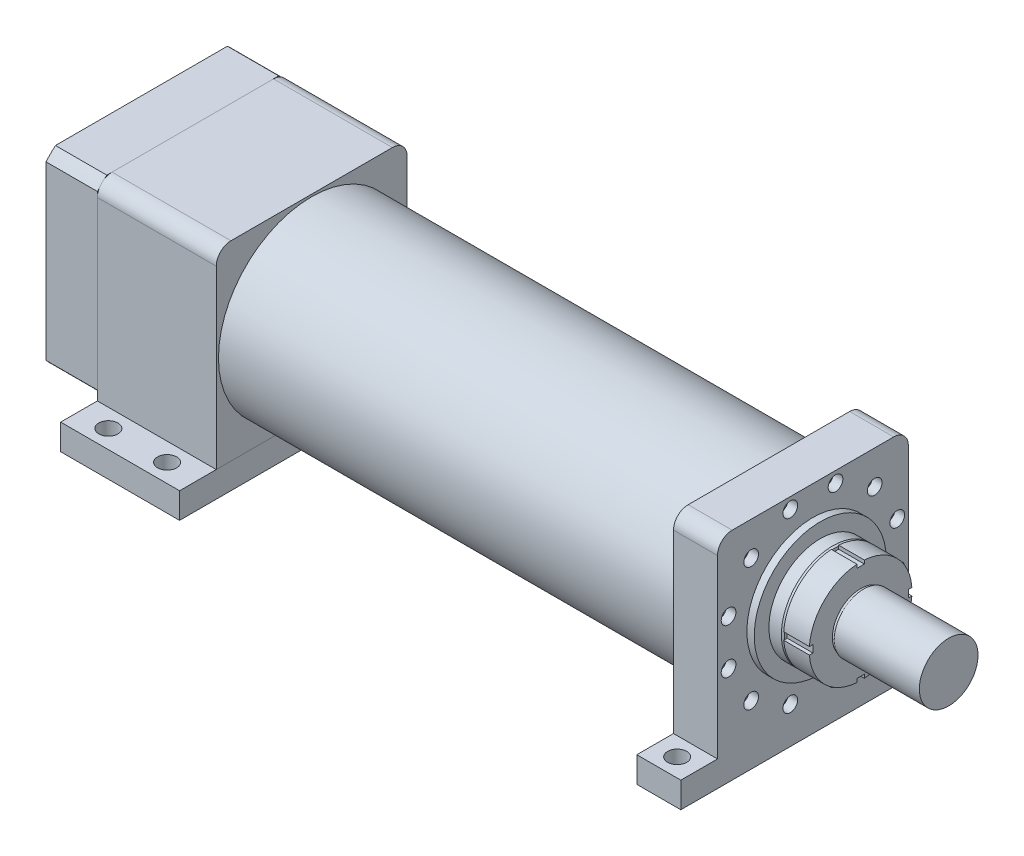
ISO-10303-21;
HEADER;
FILE_DESCRIPTION(('STEP AP214'),'2;1');
FILE_NAME('part.step','',(''),(''),'','','');
FILE_SCHEMA(('AUTOMOTIVE_DESIGN { 1 0 10303 214 1 1 1 1 }'));
ENDSEC;
DATA;
#1=APPLICATION_CONTEXT('core data for automotive mechanical design processes');
#2=APPLICATION_PROTOCOL_DEFINITION('international standard','automotive_design',2000,#1);
#3=PRODUCT_CONTEXT('',#1,'mechanical');
#4=PRODUCT('Part','Part','',(#3));
#5=PRODUCT_RELATED_PRODUCT_CATEGORY('part','',(#4));
#6=PRODUCT_DEFINITION_FORMATION('','',#4);
#7=PRODUCT_DEFINITION_CONTEXT('part definition',#1,'design');
#8=PRODUCT_DEFINITION('design','',#6,#7);
#9=PRODUCT_DEFINITION_SHAPE('','',#8);
#10=(LENGTH_UNIT() NAMED_UNIT(*) SI_UNIT(.MILLI.,.METRE.));
#11=(NAMED_UNIT(*) PLANE_ANGLE_UNIT() SI_UNIT($,.RADIAN.));
#12=(NAMED_UNIT(*) SI_UNIT($,.STERADIAN.) SOLID_ANGLE_UNIT());
#13=UNCERTAINTY_MEASURE_WITH_UNIT(LENGTH_MEASURE(1.E-05),#10,'distance_accuracy_value','');
#14=(GEOMETRIC_REPRESENTATION_CONTEXT(3) GLOBAL_UNCERTAINTY_ASSIGNED_CONTEXT((#13)) GLOBAL_UNIT_ASSIGNED_CONTEXT((#10,
#11,#12)) REPRESENTATION_CONTEXT('',''));
#15=CARTESIAN_POINT('',(0.,0.,0.));
#16=DIRECTION('',(0.,0.,1.));
#17=DIRECTION('',(1.,0.,0.));
#18=AXIS2_PLACEMENT_3D('',#15,#16,#17);
#19=CARTESIAN_POINT('',(0.,-165.,0.));
#20=DIRECTION('',(0.,-1.,0.));
#21=DIRECTION('',(0.,0.,-1.));
#22=AXIS2_PLACEMENT_3D('',#19,#20,#21);
#23=PLANE('',#22);
#24=CARTESIAN_POINT('',(-122.,-165.,-155.));
#25=DIRECTION('',(0.,-1.,0.));
#26=DIRECTION('',(0.,0.,-1.));
#27=AXIS2_PLACEMENT_3D('',#24,#25,#26);
#28=CIRCLE('',#27,13.);
#29=CARTESIAN_POINT('',(-122.,-165.,-168.));
#30=VERTEX_POINT('',#29);
#31=EDGE_CURVE('E134',#30,#30,#28,.T.);
#32=ORIENTED_EDGE('',*,*,#31,.F.);
#33=EDGE_LOOP('',(#32));
#34=FACE_BOUND('',#33,.T.);
#35=CARTESIAN_POINT('',(-122.,-165.,155.));
#36=DIRECTION('',(0.,-1.,0.));
#37=DIRECTION('',(0.,0.,-1.));
#38=AXIS2_PLACEMENT_3D('',#35,#36,#37);
#39=CIRCLE('',#38,13.);
#40=CARTESIAN_POINT('',(-122.,-165.,142.));
#41=VERTEX_POINT('',#40);
#42=EDGE_CURVE('E113',#41,#41,#39,.T.);
#43=ORIENTED_EDGE('',*,*,#42,.F.);
#44=EDGE_LOOP('',(#43));
#45=FACE_BOUND('',#44,.T.);
#46=DIRECTION('',(0.,0.,1.));
#47=VECTOR('',#46,1.);
#48=CARTESIAN_POINT('',(0.,-165.,180.));
#49=LINE('',#48,#47);
#50=CARTESIAN_POINT('',(0.,-165.,-180.));
#51=VERTEX_POINT('',#50);
#52=CARTESIAN_POINT('',(0.,-165.,180.));
#53=VERTEX_POINT('',#52);
#54=EDGE_CURVE('E98',#51,#53,#49,.T.);
#55=ORIENTED_EDGE('',*,*,#54,.T.);
#56=DIRECTION('',(-1.,0.,0.));
#57=VECTOR('',#56,1.);
#58=CARTESIAN_POINT('',(-162.,-165.,180.));
#59=LINE('',#58,#57);
#60=CARTESIAN_POINT('',(-162.,-165.,180.));
#61=VERTEX_POINT('',#60);
#62=EDGE_CURVE('E93',#53,#61,#59,.T.);
#63=ORIENTED_EDGE('',*,*,#62,.T.);
#64=DIRECTION('',(0.,0.,-1.));
#65=VECTOR('',#64,1.);
#66=CARTESIAN_POINT('',(-162.,-165.,180.));
#67=LINE('',#66,#65);
#68=CARTESIAN_POINT('',(-162.,-165.,-180.));
#69=VERTEX_POINT('',#68);
#70=EDGE_CURVE('E96',#61,#69,#67,.T.);
#71=ORIENTED_EDGE('',*,*,#70,.T.);
#72=DIRECTION('',(1.,0.,0.));
#73=VECTOR('',#72,1.);
#74=CARTESIAN_POINT('',(-162.,-165.,-180.));
#75=LINE('',#74,#73);
#76=EDGE_CURVE('E63',#69,#51,#75,.T.);
#77=ORIENTED_EDGE('',*,*,#76,.T.);
#78=EDGE_LOOP('',(#55,#63,#71,#77));
#79=FACE_BOUND('',#78,.T.);
#80=CARTESIAN_POINT('',(-42.,-165.,155.));
#81=DIRECTION('',(0.,-1.,0.));
#82=DIRECTION('',(0.,0.,-1.));
#83=AXIS2_PLACEMENT_3D('',#80,#81,#82);
#84=CIRCLE('',#83,13.);
#85=CARTESIAN_POINT('',(-42.,-165.,142.));
#86=VERTEX_POINT('',#85);
#87=EDGE_CURVE('E128',#86,#86,#84,.T.);
#88=ORIENTED_EDGE('',*,*,#87,.F.);
#89=EDGE_LOOP('',(#88));
#90=FACE_BOUND('',#89,.T.);
#91=CARTESIAN_POINT('',(-42.,-165.,-155.));
#92=DIRECTION('',(0.,-1.,0.));
#93=DIRECTION('',(0.,0.,-1.));
#94=AXIS2_PLACEMENT_3D('',#91,#92,#93);
#95=CIRCLE('',#94,13.);
#96=CARTESIAN_POINT('',(-42.,-165.,-168.));
#97=VERTEX_POINT('',#96);
#98=EDGE_CURVE('E140',#97,#97,#95,.T.);
#99=ORIENTED_EDGE('',*,*,#98,.F.);
#100=EDGE_LOOP('',(#99));
#101=FACE_BOUND('',#100,.T.);
#102=ADVANCED_FACE('F46',(#34,#45,#79,#90,#101),#23,.T.);
#103=CARTESIAN_POINT('',(0.,-130.,0.));
#104=DIRECTION('',(0.,-1.,0.));
#105=DIRECTION('',(0.,0.,-1.));
#106=AXIS2_PLACEMENT_3D('',#103,#104,#105);
#107=PLANE('',#106);
#108=DIRECTION('',(0.,0.,1.));
#109=VECTOR('',#108,1.);
#110=CARTESIAN_POINT('',(0.,-130.,180.));
#111=LINE('',#110,#109);
#112=CARTESIAN_POINT('',(0.,-130.,-180.));
#113=VERTEX_POINT('',#112);
#114=CARTESIAN_POINT('',(0.,-130.,180.));
#115=VERTEX_POINT('',#114);
#116=EDGE_CURVE('E110',#113,#115,#111,.T.);
#117=ORIENTED_EDGE('',*,*,#116,.F.);
#118=DIRECTION('',(1.,0.,0.));
#119=VECTOR('',#118,1.);
#120=CARTESIAN_POINT('',(-162.,-130.,-180.));
#121=LINE('',#120,#119);
#122=CARTESIAN_POINT('',(-162.,-130.,-180.));
#123=VERTEX_POINT('',#122);
#124=EDGE_CURVE('E86',#123,#113,#121,.T.);
#125=ORIENTED_EDGE('',*,*,#124,.F.);
#126=DIRECTION('',(0.,0.,-1.));
#127=VECTOR('',#126,1.);
#128=CARTESIAN_POINT('',(-162.,-130.,180.));
#129=LINE('',#128,#127);
#130=CARTESIAN_POINT('',(-162.,-130.,180.));
#131=VERTEX_POINT('',#130);
#132=EDGE_CURVE('E80',#131,#123,#129,.T.);
#133=ORIENTED_EDGE('',*,*,#132,.F.);
#134=DIRECTION('',(-1.,0.,0.));
#135=VECTOR('',#134,1.);
#136=CARTESIAN_POINT('',(-162.,-130.,180.));
#137=LINE('',#136,#135);
#138=EDGE_CURVE('E102',#115,#131,#137,.T.);
#139=ORIENTED_EDGE('',*,*,#138,.F.);
#140=EDGE_LOOP('',(#117,#125,#133,#139));
#141=FACE_BOUND('',#140,.T.);
#142=CARTESIAN_POINT('',(-122.,-130.,155.));
#143=DIRECTION('',(0.,-1.,0.));
#144=DIRECTION('',(0.,0.,-1.));
#145=AXIS2_PLACEMENT_3D('',#142,#143,#144);
#146=CIRCLE('',#145,13.);
#147=CARTESIAN_POINT('',(-122.,-130.,142.));
#148=VERTEX_POINT('',#147);
#149=EDGE_CURVE('E125',#148,#148,#146,.T.);
#150=ORIENTED_EDGE('',*,*,#149,.T.);
#151=EDGE_LOOP('',(#150));
#152=FACE_BOUND('',#151,.T.);
#153=CARTESIAN_POINT('',(-42.,-130.,155.));
#154=DIRECTION('',(0.,-1.,0.));
#155=DIRECTION('',(0.,0.,-1.));
#156=AXIS2_PLACEMENT_3D('',#153,#154,#155);
#157=CIRCLE('',#156,13.);
#158=CARTESIAN_POINT('',(-42.,-130.,142.));
#159=VERTEX_POINT('',#158);
#160=EDGE_CURVE('E131',#159,#159,#157,.T.);
#161=ORIENTED_EDGE('',*,*,#160,.T.);
#162=EDGE_LOOP('',(#161));
#163=FACE_BOUND('',#162,.T.);
#164=CARTESIAN_POINT('',(-122.,-130.,-155.));
#165=DIRECTION('',(0.,-1.,0.));
#166=DIRECTION('',(0.,0.,-1.));
#167=AXIS2_PLACEMENT_3D('',#164,#165,#166);
#168=CIRCLE('',#167,13.);
#169=CARTESIAN_POINT('',(-122.,-130.,-168.));
#170=VERTEX_POINT('',#169);
#171=EDGE_CURVE('E137',#170,#170,#168,.T.);
#172=ORIENTED_EDGE('',*,*,#171,.T.);
#173=EDGE_LOOP('',(#172));
#174=FACE_BOUND('',#173,.T.);
#175=CARTESIAN_POINT('',(-42.,-130.,-155.));
#176=DIRECTION('',(0.,-1.,0.));
#177=DIRECTION('',(0.,0.,-1.));
#178=AXIS2_PLACEMENT_3D('',#175,#176,#177);
#179=CIRCLE('',#178,13.);
#180=CARTESIAN_POINT('',(-42.,-130.,-168.));
#181=VERTEX_POINT('',#180);
#182=EDGE_CURVE('E143',#181,#181,#179,.T.);
#183=ORIENTED_EDGE('',*,*,#182,.T.);
#184=EDGE_LOOP('',(#183));
#185=FACE_BOUND('',#184,.T.);
#186=ADVANCED_FACE('F121',(#141,#152,#163,#174,#185),#107,.F.);
#187=CARTESIAN_POINT('',(0.,-165.,180.));
#188=DIRECTION('',(-1.,0.,0.));
#189=DIRECTION('',(0.,0.,1.));
#190=AXIS2_PLACEMENT_3D('',#187,#188,#189);
#191=PLANE('',#190);
#192=ORIENTED_EDGE('',*,*,#116,.T.);
#193=DIRECTION('',(0.,1.,0.));
#194=VECTOR('',#193,1.);
#195=CARTESIAN_POINT('',(0.,-165.,180.));
#196=LINE('',#195,#194);
#197=EDGE_CURVE('E12',#53,#115,#196,.T.);
#198=ORIENTED_EDGE('',*,*,#197,.F.);
#199=ORIENTED_EDGE('',*,*,#54,.F.);
#200=DIRECTION('',(0.,1.,0.));
#201=VECTOR('',#200,1.);
#202=CARTESIAN_POINT('',(0.,-165.,-180.));
#203=LINE('',#202,#201);
#204=EDGE_CURVE('E106',#51,#113,#203,.T.);
#205=ORIENTED_EDGE('',*,*,#204,.T.);
#206=EDGE_LOOP('',(#192,#198,#199,#205));
#207=FACE_BOUND('',#206,.T.);
#208=ADVANCED_FACE('F48',(#207),#191,.F.);
#209=CARTESIAN_POINT('',(-162.,-165.,180.));
#210=DIRECTION('',(0.,0.,-1.));
#211=DIRECTION('',(-1.,0.,0.));
#212=AXIS2_PLACEMENT_3D('',#209,#210,#211);
#213=PLANE('',#212);
#214=ORIENTED_EDGE('',*,*,#138,.T.);
#215=DIRECTION('',(0.,1.,0.));
#216=VECTOR('',#215,1.);
#217=CARTESIAN_POINT('',(-162.,-165.,180.));
#218=LINE('',#217,#216);
#219=EDGE_CURVE('E55',#61,#131,#218,.T.);
#220=ORIENTED_EDGE('',*,*,#219,.F.);
#221=ORIENTED_EDGE('',*,*,#62,.F.);
#222=ORIENTED_EDGE('',*,*,#197,.T.);
#223=EDGE_LOOP('',(#214,#220,#221,#222));
#224=FACE_BOUND('',#223,.T.);
#225=ADVANCED_FACE('F101',(#224),#213,.F.);
#226=CARTESIAN_POINT('',(-162.,-165.,180.));
#227=DIRECTION('',(1.,0.,0.));
#228=DIRECTION('',(0.,0.,-1.));
#229=AXIS2_PLACEMENT_3D('',#226,#227,#228);
#230=PLANE('',#229);
#231=ORIENTED_EDGE('',*,*,#132,.T.);
#232=DIRECTION('',(0.,1.,0.));
#233=VECTOR('',#232,1.);
#234=CARTESIAN_POINT('',(-162.,-165.,-180.));
#235=LINE('',#234,#233);
#236=EDGE_CURVE('E103',#69,#123,#235,.T.);
#237=ORIENTED_EDGE('',*,*,#236,.F.);
#238=ORIENTED_EDGE('',*,*,#70,.F.);
#239=ORIENTED_EDGE('',*,*,#219,.T.);
#240=EDGE_LOOP('',(#231,#237,#238,#239));
#241=FACE_BOUND('',#240,.T.);
#242=ADVANCED_FACE('F104',(#241),#230,.F.);
#243=CARTESIAN_POINT('',(-162.,-165.,-180.));
#244=DIRECTION('',(0.,0.,1.));
#245=DIRECTION('',(1.,0.,0.));
#246=AXIS2_PLACEMENT_3D('',#243,#244,#245);
#247=PLANE('',#246);
#248=ORIENTED_EDGE('',*,*,#124,.T.);
#249=ORIENTED_EDGE('',*,*,#204,.F.);
#250=ORIENTED_EDGE('',*,*,#76,.F.);
#251=ORIENTED_EDGE('',*,*,#236,.T.);
#252=EDGE_LOOP('',(#248,#249,#250,#251));
#253=FACE_BOUND('',#252,.T.);
#254=ADVANCED_FACE('F118',(#253),#247,.F.);
#255=CARTESIAN_POINT('',(-122.,-165.,155.));
#256=DIRECTION('',(0.,1.,0.));
#257=DIRECTION('',(0.,0.,1.));
#258=AXIS2_PLACEMENT_3D('',#255,#256,#257);
#259=CYLINDRICAL_SURFACE('',#258,13.);
#260=ORIENTED_EDGE('',*,*,#42,.T.);
#261=EDGE_LOOP('',(#260));
#262=FACE_BOUND('',#261,.T.);
#263=ORIENTED_EDGE('',*,*,#149,.F.);
#264=EDGE_LOOP('',(#263));
#265=FACE_BOUND('',#264,.T.);
#266=ADVANCED_FACE('F162',(#262,#265),#259,.F.);
#267=CARTESIAN_POINT('',(-42.,-165.,155.));
#268=DIRECTION('',(0.,1.,0.));
#269=DIRECTION('',(0.,0.,1.));
#270=AXIS2_PLACEMENT_3D('',#267,#268,#269);
#271=CYLINDRICAL_SURFACE('',#270,13.);
#272=ORIENTED_EDGE('',*,*,#87,.T.);
#273=EDGE_LOOP('',(#272));
#274=FACE_BOUND('',#273,.T.);
#275=ORIENTED_EDGE('',*,*,#160,.F.);
#276=EDGE_LOOP('',(#275));
#277=FACE_BOUND('',#276,.T.);
#278=ADVANCED_FACE('F208',(#274,#277),#271,.F.);
#279=CARTESIAN_POINT('',(-122.,-165.,-155.));
#280=DIRECTION('',(0.,1.,0.));
#281=DIRECTION('',(0.,0.,1.));
#282=AXIS2_PLACEMENT_3D('',#279,#280,#281);
#283=CYLINDRICAL_SURFACE('',#282,13.);
#284=ORIENTED_EDGE('',*,*,#31,.T.);
#285=EDGE_LOOP('',(#284));
#286=FACE_BOUND('',#285,.T.);
#287=ORIENTED_EDGE('',*,*,#171,.F.);
#288=EDGE_LOOP('',(#287));
#289=FACE_BOUND('',#288,.T.);
#290=ADVANCED_FACE('F216',(#286,#289),#283,.F.);
#291=CARTESIAN_POINT('',(-42.,-165.,-155.));
#292=DIRECTION('',(0.,1.,0.));
#293=DIRECTION('',(0.,0.,1.));
#294=AXIS2_PLACEMENT_3D('',#291,#292,#293);
#295=CYLINDRICAL_SURFACE('',#294,13.);
#296=ORIENTED_EDGE('',*,*,#98,.T.);
#297=EDGE_LOOP('',(#296));
#298=FACE_BOUND('',#297,.T.);
#299=ORIENTED_EDGE('',*,*,#182,.F.);
#300=EDGE_LOOP('',(#299));
#301=FACE_BOUND('',#300,.T.);
#302=ADVANCED_FACE('F149',(#298,#301),#295,.F.);
#303=CLOSED_SHELL('',(#102,#186,#208,#225,#242,#254,#266,#278,#290,#302));
#304=MANIFOLD_SOLID_BREP('B2',#303);
#305=CARTESIAN_POINT('',(-232.,0.,0.));
#306=DIRECTION('',(1.,0.,0.));
#307=DIRECTION('',(0.,0.,-1.));
#308=AXIS2_PLACEMENT_3D('',#305,#306,#307);
#309=CYLINDRICAL_SURFACE('',#308,175.);
#310=CARTESIAN_POINT('',(-162.,0.,0.));
#311=DIRECTION('',(-1.,0.,0.));
#312=DIRECTION('',(0.,0.,1.));
#313=AXIS2_PLACEMENT_3D('',#310,#311,#312);
#314=CIRCLE('',#313,175.);
#315=CARTESIAN_POINT('',(-162.,-117.1537451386,-130.));
#316=VERTEX_POINT('',#315);
#317=CARTESIAN_POINT('',(-162.,-130.,-117.1537451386));
#318=VERTEX_POINT('',#317);
#319=EDGE_CURVE('E360',#316,#318,#314,.T.);
#320=ORIENTED_EDGE('',*,*,#319,.T.);
#321=DIRECTION('',(1.,0.,0.));
#322=VECTOR('',#321,1.);
#323=CARTESIAN_POINT('',(-232.,-130.,-117.1537451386));
#324=LINE('',#323,#322);
#325=CARTESIAN_POINT('',(-232.,-130.,-117.1537451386));
#326=VERTEX_POINT('',#325);
#327=EDGE_CURVE('E44',#326,#318,#324,.T.);
#328=ORIENTED_EDGE('',*,*,#327,.F.);
#329=CARTESIAN_POINT('',(-232.,0.,0.));
#330=DIRECTION('',(-1.,0.,0.));
#331=DIRECTION('',(0.,0.,1.));
#332=AXIS2_PLACEMENT_3D('',#329,#330,#331);
#333=CIRCLE('',#332,175.);
#334=CARTESIAN_POINT('',(-232.,-117.1537451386,-130.));
#335=VERTEX_POINT('',#334);
#336=EDGE_CURVE('E375',#335,#326,#333,.T.);
#337=ORIENTED_EDGE('',*,*,#336,.F.);
#338=DIRECTION('',(1.,0.,0.));
#339=VECTOR('',#338,1.);
#340=CARTESIAN_POINT('',(-232.,-117.1537451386,-130.));
#341=LINE('',#340,#339);
#342=EDGE_CURVE('E356',#335,#316,#341,.T.);
#343=ORIENTED_EDGE('',*,*,#342,.T.);
#344=EDGE_LOOP('',(#320,#328,#337,#343));
#345=FACE_BOUND('',#344,.T.);
#346=ADVANCED_FACE('F264',(#345),#309,.T.);
#347=CARTESIAN_POINT('',(-232.,-130.,-117.1537451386));
#348=DIRECTION('',(0.,1.,0.));
#349=DIRECTION('',(0.,0.,1.));
#350=AXIS2_PLACEMENT_3D('',#347,#348,#349);
#351=PLANE('',#350);
#352=DIRECTION('',(0.,0.,1.));
#353=VECTOR('',#352,1.);
#354=CARTESIAN_POINT('',(-162.,-130.,-117.1537451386));
#355=LINE('',#354,#353);
#356=CARTESIAN_POINT('',(-162.,-130.,117.1537451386));
#357=VERTEX_POINT('',#356);
#358=EDGE_CURVE('E363',#318,#357,#355,.T.);
#359=ORIENTED_EDGE('',*,*,#358,.T.);
#360=DIRECTION('',(1.,0.,0.));
#361=VECTOR('',#360,1.);
#362=CARTESIAN_POINT('',(-232.,-130.,117.1537451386));
#363=LINE('',#362,#361);
#364=CARTESIAN_POINT('',(-232.,-130.,117.1537451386));
#365=VERTEX_POINT('',#364);
#366=EDGE_CURVE('E272',#365,#357,#363,.T.);
#367=ORIENTED_EDGE('',*,*,#366,.F.);
#368=DIRECTION('',(0.,0.,1.));
#369=VECTOR('',#368,1.);
#370=CARTESIAN_POINT('',(-232.,-130.,-117.1537451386));
#371=LINE('',#370,#369);
#372=EDGE_CURVE('E323',#326,#365,#371,.T.);
#373=ORIENTED_EDGE('',*,*,#372,.F.);
#374=ORIENTED_EDGE('',*,*,#327,.T.);
#375=EDGE_LOOP('',(#359,#367,#373,#374));
#376=FACE_BOUND('',#375,.T.);
#377=ADVANCED_FACE('F438',(#376),#351,.F.);
#378=CARTESIAN_POINT('',(-232.,0.,0.));
#379=DIRECTION('',(1.,0.,0.));
#380=DIRECTION('',(0.,0.,-1.));
#381=AXIS2_PLACEMENT_3D('',#378,#379,#380);
#382=CYLINDRICAL_SURFACE('',#381,175.);
#383=CARTESIAN_POINT('',(-162.,0.,0.));
#384=DIRECTION('',(-1.,0.,0.));
#385=DIRECTION('',(0.,0.,1.));
#386=AXIS2_PLACEMENT_3D('',#383,#384,#385);
#387=CIRCLE('',#386,175.);
#388=CARTESIAN_POINT('',(-162.,-117.1537451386,130.));
#389=VERTEX_POINT('',#388);
#390=EDGE_CURVE('E366',#357,#389,#387,.T.);
#391=ORIENTED_EDGE('',*,*,#390,.T.);
#392=DIRECTION('',(1.,0.,0.));
#393=VECTOR('',#392,1.);
#394=CARTESIAN_POINT('',(-232.,-117.1537451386,130.));
#395=LINE('',#394,#393);
#396=CARTESIAN_POINT('',(-232.,-117.1537451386,130.));
#397=VERTEX_POINT('',#396);
#398=EDGE_CURVE('E382',#397,#389,#395,.T.);
#399=ORIENTED_EDGE('',*,*,#398,.F.);
#400=CARTESIAN_POINT('',(-232.,0.,0.));
#401=DIRECTION('',(-1.,0.,0.));
#402=DIRECTION('',(0.,0.,1.));
#403=AXIS2_PLACEMENT_3D('',#400,#401,#402);
#404=CIRCLE('',#403,175.);
#405=EDGE_CURVE('E390',#365,#397,#404,.T.);
#406=ORIENTED_EDGE('',*,*,#405,.F.);
#407=ORIENTED_EDGE('',*,*,#366,.T.);
#408=EDGE_LOOP('',(#391,#399,#406,#407));
#409=FACE_BOUND('',#408,.T.);
#410=ADVANCED_FACE('F388',(#409),#382,.T.);
#411=CARTESIAN_POINT('',(-232.,117.1537451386,130.));
#412=DIRECTION('',(0.,0.,-1.));
#413=DIRECTION('',(-1.,0.,0.));
#414=AXIS2_PLACEMENT_3D('',#411,#412,#413);
#415=PLANE('',#414);
#416=DIRECTION('',(0.,1.,0.));
#417=VECTOR('',#416,1.);
#418=CARTESIAN_POINT('',(-162.,117.1537451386,130.));
#419=LINE('',#418,#417);
#420=CARTESIAN_POINT('',(-162.,117.1537451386,130.));
#421=VERTEX_POINT('',#420);
#422=EDGE_CURVE('E368',#389,#421,#419,.T.);
#423=ORIENTED_EDGE('',*,*,#422,.T.);
#424=DIRECTION('',(1.,0.,0.));
#425=VECTOR('',#424,1.);
#426=CARTESIAN_POINT('',(-232.,117.1537451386,130.));
#427=LINE('',#426,#425);
#428=CARTESIAN_POINT('',(-232.,117.1537451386,130.));
#429=VERTEX_POINT('',#428);
#430=EDGE_CURVE('E379',#429,#421,#427,.T.);
#431=ORIENTED_EDGE('',*,*,#430,.F.);
#432=DIRECTION('',(0.,1.,0.));
#433=VECTOR('',#432,1.);
#434=CARTESIAN_POINT('',(-232.,117.1537451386,130.));
#435=LINE('',#434,#433);
#436=EDGE_CURVE('E402',#397,#429,#435,.T.);
#437=ORIENTED_EDGE('',*,*,#436,.F.);
#438=ORIENTED_EDGE('',*,*,#398,.T.);
#439=EDGE_LOOP('',(#423,#431,#437,#438));
#440=FACE_BOUND('',#439,.T.);
#441=ADVANCED_FACE('F398',(#440),#415,.F.);
#442=CARTESIAN_POINT('',(-232.,0.,0.));
#443=DIRECTION('',(1.,0.,0.));
#444=DIRECTION('',(0.,0.,-1.));
#445=AXIS2_PLACEMENT_3D('',#442,#443,#444);
#446=CYLINDRICAL_SURFACE('',#445,175.);
#447=CARTESIAN_POINT('',(-162.,0.,0.));
#448=DIRECTION('',(-1.,0.,0.));
#449=DIRECTION('',(0.,0.,1.));
#450=AXIS2_PLACEMENT_3D('',#447,#448,#449);
#451=CIRCLE('',#450,175.);
#452=CARTESIAN_POINT('',(-162.,130.,117.1537451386));
#453=VERTEX_POINT('',#452);
#454=EDGE_CURVE('E370',#421,#453,#451,.T.);
#455=ORIENTED_EDGE('',*,*,#454,.T.);
#456=DIRECTION('',(1.,0.,0.));
#457=VECTOR('',#456,1.);
#458=CARTESIAN_POINT('',(-232.,130.,117.1537451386));
#459=LINE('',#458,#457);
#460=CARTESIAN_POINT('',(-232.,130.,117.1537451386));
#461=VERTEX_POINT('',#460);
#462=EDGE_CURVE('E351',#461,#453,#459,.T.);
#463=ORIENTED_EDGE('',*,*,#462,.F.);
#464=CARTESIAN_POINT('',(-232.,0.,0.));
#465=DIRECTION('',(-1.,0.,0.));
#466=DIRECTION('',(0.,0.,1.));
#467=AXIS2_PLACEMENT_3D('',#464,#465,#466);
#468=CIRCLE('',#467,175.);
#469=EDGE_CURVE('E342',#429,#461,#468,.T.);
#470=ORIENTED_EDGE('',*,*,#469,.F.);
#471=ORIENTED_EDGE('',*,*,#430,.T.);
#472=EDGE_LOOP('',(#455,#463,#470,#471));
#473=FACE_BOUND('',#472,.T.);
#474=ADVANCED_FACE('F401',(#473),#446,.T.);
#475=CARTESIAN_POINT('',(-232.,130.,-117.1537451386));
#476=DIRECTION('',(0.,-1.,0.));
#477=DIRECTION('',(0.,0.,-1.));
#478=AXIS2_PLACEMENT_3D('',#475,#476,#477);
#479=PLANE('',#478);
#480=DIRECTION('',(0.,0.,-1.));
#481=VECTOR('',#480,1.);
#482=CARTESIAN_POINT('',(-162.,130.,-117.1537451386));
#483=LINE('',#482,#481);
#484=CARTESIAN_POINT('',(-162.,130.,-117.1537451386));
#485=VERTEX_POINT('',#484);
#486=EDGE_CURVE('E350',#453,#485,#483,.T.);
#487=ORIENTED_EDGE('',*,*,#486,.T.);
#488=DIRECTION('',(1.,0.,0.));
#489=VECTOR('',#488,1.);
#490=CARTESIAN_POINT('',(-232.,130.,-117.1537451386));
#491=LINE('',#490,#489);
#492=CARTESIAN_POINT('',(-232.,130.,-117.1537451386));
#493=VERTEX_POINT('',#492);
#494=EDGE_CURVE('E347',#493,#485,#491,.T.);
#495=ORIENTED_EDGE('',*,*,#494,.F.);
#496=DIRECTION('',(0.,0.,-1.));
#497=VECTOR('',#496,1.);
#498=CARTESIAN_POINT('',(-232.,130.,-117.1537451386));
#499=LINE('',#498,#497);
#500=EDGE_CURVE('E336',#461,#493,#499,.T.);
#501=ORIENTED_EDGE('',*,*,#500,.F.);
#502=ORIENTED_EDGE('',*,*,#462,.T.);
#503=EDGE_LOOP('',(#487,#495,#501,#502));
#504=FACE_BOUND('',#503,.T.);
#505=ADVANCED_FACE('F348',(#504),#479,.F.);
#506=CARTESIAN_POINT('',(-232.,0.,0.));
#507=DIRECTION('',(1.,0.,0.));
#508=DIRECTION('',(0.,0.,-1.));
#509=AXIS2_PLACEMENT_3D('',#506,#507,#508);
#510=CYLINDRICAL_SURFACE('',#509,175.);
#511=CARTESIAN_POINT('',(-162.,0.,0.));
#512=DIRECTION('',(-1.,0.,0.));
#513=DIRECTION('',(0.,0.,1.));
#514=AXIS2_PLACEMENT_3D('',#511,#512,#513);
#515=CIRCLE('',#514,175.);
#516=CARTESIAN_POINT('',(-162.,117.1537451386,-130.));
#517=VERTEX_POINT('',#516);
#518=EDGE_CURVE('E309',#485,#517,#515,.T.);
#519=ORIENTED_EDGE('',*,*,#518,.T.);
#520=DIRECTION('',(1.,0.,0.));
#521=VECTOR('',#520,1.);
#522=CARTESIAN_POINT('',(-232.,117.1537451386,-130.));
#523=LINE('',#522,#521);
#524=CARTESIAN_POINT('',(-232.,117.1537451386,-130.));
#525=VERTEX_POINT('',#524);
#526=EDGE_CURVE('E352',#525,#517,#523,.T.);
#527=ORIENTED_EDGE('',*,*,#526,.F.);
#528=CARTESIAN_POINT('',(-232.,0.,0.));
#529=DIRECTION('',(-1.,0.,0.));
#530=DIRECTION('',(0.,0.,1.));
#531=AXIS2_PLACEMENT_3D('',#528,#529,#530);
#532=CIRCLE('',#531,175.);
#533=EDGE_CURVE('E340',#493,#525,#532,.T.);
#534=ORIENTED_EDGE('',*,*,#533,.F.);
#535=ORIENTED_EDGE('',*,*,#494,.T.);
#536=EDGE_LOOP('',(#519,#527,#534,#535));
#537=FACE_BOUND('',#536,.T.);
#538=ADVANCED_FACE('F354',(#537),#510,.T.);
#539=CARTESIAN_POINT('',(-232.,117.1537451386,-130.));
#540=DIRECTION('',(0.,0.,1.));
#541=DIRECTION('',(0.,-1.,0.));
#542=AXIS2_PLACEMENT_3D('',#539,#540,#541);
#543=PLANE('',#542);
#544=DIRECTION('',(0.,-1.,0.));
#545=VECTOR('',#544,1.);
#546=CARTESIAN_POINT('',(-162.,117.1537451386,-130.));
#547=LINE('',#546,#545);
#548=EDGE_CURVE('E315',#517,#316,#547,.T.);
#549=ORIENTED_EDGE('',*,*,#548,.T.);
#550=ORIENTED_EDGE('',*,*,#342,.F.);
#551=DIRECTION('',(0.,-1.,0.));
#552=VECTOR('',#551,1.);
#553=CARTESIAN_POINT('',(-232.,117.1537451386,-130.));
#554=LINE('',#553,#552);
#555=EDGE_CURVE('E280',#525,#335,#554,.T.);
#556=ORIENTED_EDGE('',*,*,#555,.F.);
#557=ORIENTED_EDGE('',*,*,#526,.T.);
#558=EDGE_LOOP('',(#549,#550,#556,#557));
#559=FACE_BOUND('',#558,.T.);
#560=ADVANCED_FACE('F445',(#559),#543,.F.);
#561=CARTESIAN_POINT('',(-232.,0.,0.));
#562=DIRECTION('',(-1.,0.,0.));
#563=DIRECTION('',(0.,0.,1.));
#564=AXIS2_PLACEMENT_3D('',#561,#562,#563);
#565=PLANE('',#564);
#566=CARTESIAN_POINT('',(-232.,0.,0.));
#567=DIRECTION('',(-1.,0.,0.));
#568=DIRECTION('',(0.,0.,1.));
#569=AXIS2_PLACEMENT_3D('',#566,#567,#568);
#570=CIRCLE('',#569,80.);
#571=CARTESIAN_POINT('',(-232.,0.,80.));
#572=VERTEX_POINT('',#571);
#573=EDGE_CURVE('E364',#572,#572,#570,.T.);
#574=ORIENTED_EDGE('',*,*,#573,.F.);
#575=EDGE_LOOP('',(#574));
#576=FACE_BOUND('',#575,.T.);
#577=ORIENTED_EDGE('',*,*,#336,.T.);
#578=ORIENTED_EDGE('',*,*,#372,.T.);
#579=ORIENTED_EDGE('',*,*,#405,.T.);
#580=ORIENTED_EDGE('',*,*,#436,.T.);
#581=ORIENTED_EDGE('',*,*,#469,.T.);
#582=ORIENTED_EDGE('',*,*,#500,.T.);
#583=ORIENTED_EDGE('',*,*,#533,.T.);
#584=ORIENTED_EDGE('',*,*,#555,.T.);
#585=EDGE_LOOP('',(#577,#578,#579,#580,#581,#582,#583,#584));
#586=FACE_BOUND('',#585,.T.);
#587=ADVANCED_FACE('F338',(#576,#586),#565,.T.);
#588=CARTESIAN_POINT('',(-162.,0.,0.));
#589=DIRECTION('',(-1.,0.,0.));
#590=DIRECTION('',(0.,0.,1.));
#591=AXIS2_PLACEMENT_3D('',#588,#589,#590);
#592=PLANE('',#591);
#593=ORIENTED_EDGE('',*,*,#319,.F.);
#594=ORIENTED_EDGE('',*,*,#548,.F.);
#595=ORIENTED_EDGE('',*,*,#518,.F.);
#596=ORIENTED_EDGE('',*,*,#486,.F.);
#597=ORIENTED_EDGE('',*,*,#454,.F.);
#598=ORIENTED_EDGE('',*,*,#422,.F.);
#599=ORIENTED_EDGE('',*,*,#390,.F.);
#600=ORIENTED_EDGE('',*,*,#358,.F.);
#601=EDGE_LOOP('',(#593,#594,#595,#596,#597,#598,#599,#600));
#602=FACE_BOUND('',#601,.T.);
#603=ADVANCED_FACE('F394',(#602),#592,.F.);
#604=CARTESIAN_POINT('',(-206.,0.,0.));
#605=DIRECTION('',(-1.,0.,0.));
#606=DIRECTION('',(0.,0.,1.));
#607=AXIS2_PLACEMENT_3D('',#604,#605,#606);
#608=CYLINDRICAL_SURFACE('',#607,80.);
#609=CARTESIAN_POINT('',(-206.,0.,0.));
#610=DIRECTION('',(-1.,0.,0.));
#611=DIRECTION('',(0.,0.,1.));
#612=AXIS2_PLACEMENT_3D('',#609,#610,#611);
#613=CIRCLE('',#612,80.);
#614=CARTESIAN_POINT('',(-206.,0.,80.));
#615=VERTEX_POINT('',#614);
#616=EDGE_CURVE('E410',#615,#615,#613,.T.);
#617=CARTESIAN_POINT('',(-206.,0.,80.));
#618=CARTESIAN_POINT('',(-206.270833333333,0.,80.));
#619=CARTESIAN_POINT('',(-206.541666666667,0.,80.));
#620=CARTESIAN_POINT('',(-207.083333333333,0.,80.));
#621=CARTESIAN_POINT('',(-207.354166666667,0.,80.));
#622=CARTESIAN_POINT('',(-207.895833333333,0.,80.));
#623=CARTESIAN_POINT('',(-208.166666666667,0.,80.));
#624=CARTESIAN_POINT('',(-208.708333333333,0.,80.));
#625=CARTESIAN_POINT('',(-208.979166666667,0.,80.));
#626=CARTESIAN_POINT('',(-209.520833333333,0.,80.));
#627=CARTESIAN_POINT('',(-209.791666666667,0.,80.));
#628=CARTESIAN_POINT('',(-210.333333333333,0.,80.));
#629=CARTESIAN_POINT('',(-210.604166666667,0.,80.));
#630=CARTESIAN_POINT('',(-211.145833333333,0.,80.));
#631=CARTESIAN_POINT('',(-211.416666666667,0.,80.));
#632=CARTESIAN_POINT('',(-211.958333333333,0.,80.));
#633=CARTESIAN_POINT('',(-212.229166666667,0.,80.));
#634=CARTESIAN_POINT('',(-212.770833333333,0.,80.));
#635=CARTESIAN_POINT('',(-213.041666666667,0.,80.));
#636=CARTESIAN_POINT('',(-213.583333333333,0.,80.));
#637=CARTESIAN_POINT('',(-213.854166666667,0.,80.));
#638=CARTESIAN_POINT('',(-214.395833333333,0.,80.));
#639=CARTESIAN_POINT('',(-214.666666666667,0.,80.));
#640=CARTESIAN_POINT('',(-215.208333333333,0.,80.));
#641=CARTESIAN_POINT('',(-215.479166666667,0.,80.));
#642=CARTESIAN_POINT('',(-216.020833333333,0.,80.));
#643=CARTESIAN_POINT('',(-216.291666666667,0.,80.));
#644=CARTESIAN_POINT('',(-216.833333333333,0.,80.));
#645=CARTESIAN_POINT('',(-217.104166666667,0.,80.));
#646=CARTESIAN_POINT('',(-217.645833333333,0.,80.));
#647=CARTESIAN_POINT('',(-217.916666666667,0.,80.));
#648=CARTESIAN_POINT('',(-218.458333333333,0.,80.));
#649=CARTESIAN_POINT('',(-218.729166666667,0.,80.));
#650=CARTESIAN_POINT('',(-219.270833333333,0.,80.));
#651=CARTESIAN_POINT('',(-219.541666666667,0.,80.));
#652=CARTESIAN_POINT('',(-220.083333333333,0.,80.));
#653=CARTESIAN_POINT('',(-220.354166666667,0.,80.));
#654=CARTESIAN_POINT('',(-220.895833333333,0.,80.));
#655=CARTESIAN_POINT('',(-221.166666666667,0.,80.));
#656=CARTESIAN_POINT('',(-221.708333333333,0.,80.));
#657=CARTESIAN_POINT('',(-221.979166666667,0.,80.));
#658=CARTESIAN_POINT('',(-222.520833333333,0.,80.));
#659=CARTESIAN_POINT('',(-222.791666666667,0.,80.));
#660=CARTESIAN_POINT('',(-223.333333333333,0.,80.));
#661=CARTESIAN_POINT('',(-223.604166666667,0.,80.));
#662=CARTESIAN_POINT('',(-224.145833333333,0.,80.));
#663=CARTESIAN_POINT('',(-224.416666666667,0.,80.));
#664=CARTESIAN_POINT('',(-224.958333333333,0.,80.));
#665=CARTESIAN_POINT('',(-225.229166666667,0.,80.));
#666=CARTESIAN_POINT('',(-225.770833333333,0.,80.));
#667=CARTESIAN_POINT('',(-226.041666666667,0.,80.));
#668=CARTESIAN_POINT('',(-226.583333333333,0.,80.));
#669=CARTESIAN_POINT('',(-226.854166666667,0.,80.));
#670=CARTESIAN_POINT('',(-227.395833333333,0.,80.));
#671=CARTESIAN_POINT('',(-227.666666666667,0.,80.));
#672=CARTESIAN_POINT('',(-228.208333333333,0.,80.));
#673=CARTESIAN_POINT('',(-228.479166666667,0.,80.));
#674=CARTESIAN_POINT('',(-229.020833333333,0.,80.));
#675=CARTESIAN_POINT('',(-229.291666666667,0.,80.));
#676=CARTESIAN_POINT('',(-229.833333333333,0.,80.));
#677=CARTESIAN_POINT('',(-230.104166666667,0.,80.));
#678=CARTESIAN_POINT('',(-230.645833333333,0.,80.));
#679=CARTESIAN_POINT('',(-230.916666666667,0.,80.));
#680=CARTESIAN_POINT('',(-231.458333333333,0.,80.));
#681=CARTESIAN_POINT('',(-231.729166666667,0.,80.));
#682=CARTESIAN_POINT('',(-232.,0.,80.));
#683=B_SPLINE_CURVE_WITH_KNOTS('',3,(#617,#618,#619,#620,#621,#622,#623,#624,#625,#626,#627,
#628,#629,#630,#631,#632,#633,#634,#635,#636,#637,#638,#639,#640,#641,#642,#643,#644,#645,#646,
#647,#648,#649,#650,#651,#652,#653,#654,#655,#656,#657,#658,#659,#660,#661,#662,#663,#664,#665,
#666,#667,#668,#669,#670,#671,#672,#673,#674,#675,#676,#677,#678,#679,#680,#681,#682),
.UNSPECIFIED.,.F.,.F.,(4,2,2,2,2,2,2,2,2,2,2,2,2,2,2,2,2,2,2,2,2,2,2,2,2,2,2,2,2,2,2,2,4),(0.,
0.812499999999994,1.62499999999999,2.43749999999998,3.24999999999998,4.0625,4.87499999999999,
5.68749999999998,6.49999999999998,7.3125,8.12499999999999,8.93749999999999,9.74999999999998,
10.5625,11.375,12.1875,13.,13.8125,14.625,15.4375,16.25,17.0625,17.875,18.6875,19.5,20.3125,
21.125,21.9375,22.75,23.5625,24.375,25.1875,26.),.UNSPECIFIED.);
#684=EDGE_CURVE('BSEAM425',#615,#572,#683,.T.);
#685=ORIENTED_EDGE('',*,*,#616,.F.);
#686=ORIENTED_EDGE('',*,*,#573,.T.);
#687=ORIENTED_EDGE('',*,*,#684,.T.);
#688=ORIENTED_EDGE('',*,*,#684,.F.);
#689=EDGE_LOOP('',(#685,#687,#686,#688));
#690=FACE_BOUND('',#689,.T.);
#691=ADVANCED_FACE('F425',(#690),#608,.F.);
#692=CARTESIAN_POINT('',(-168.,0.,0.));
#693=DIRECTION('',(-1.,0.,0.));
#694=DIRECTION('',(0.,0.,1.));
#695=AXIS2_PLACEMENT_3D('',#692,#693,#694);
#696=CYLINDRICAL_SURFACE('',#695,81.5);
#697=CARTESIAN_POINT('',(-168.,0.,0.));
#698=DIRECTION('',(-1.,0.,0.));
#699=DIRECTION('',(0.,0.,1.));
#700=AXIS2_PLACEMENT_3D('',#697,#698,#699);
#701=CIRCLE('',#700,81.5);
#702=CARTESIAN_POINT('',(-168.,0.,81.5));
#703=VERTEX_POINT('',#702);
#704=EDGE_CURVE('E413',#703,#703,#701,.T.);
#705=ORIENTED_EDGE('',*,*,#704,.F.);
#706=EDGE_LOOP('',(#705));
#707=FACE_BOUND('',#706,.T.);
#708=CARTESIAN_POINT('',(-206.,0.,0.));
#709=DIRECTION('',(-1.,0.,0.));
#710=DIRECTION('',(0.,0.,1.));
#711=AXIS2_PLACEMENT_3D('',#708,#709,#710);
#712=CIRCLE('',#711,81.5);
#713=CARTESIAN_POINT('',(-206.,0.,81.5));
#714=VERTEX_POINT('',#713);
#715=EDGE_CURVE('E414',#714,#714,#712,.T.);
#716=ORIENTED_EDGE('',*,*,#715,.T.);
#717=EDGE_LOOP('',(#716));
#718=FACE_BOUND('',#717,.T.);
#719=ADVANCED_FACE('F422',(#707,#718),#696,.F.);
#720=CARTESIAN_POINT('',(-168.,0.,0.));
#721=DIRECTION('',(-1.,0.,0.));
#722=DIRECTION('',(0.,0.,1.));
#723=AXIS2_PLACEMENT_3D('',#720,#721,#722);
#724=PLANE('',#723);
#725=ORIENTED_EDGE('',*,*,#704,.T.);
#726=EDGE_LOOP('',(#725));
#727=FACE_BOUND('',#726,.T.);
#728=ADVANCED_FACE('F420',(#727),#724,.T.);
#729=CARTESIAN_POINT('',(-206.,0.,0.));
#730=DIRECTION('',(-1.,0.,0.));
#731=DIRECTION('',(0.,0.,1.));
#732=AXIS2_PLACEMENT_3D('',#729,#730,#731);
#733=PLANE('',#732);
#734=ORIENTED_EDGE('',*,*,#616,.T.);
#735=EDGE_LOOP('',(#734));
#736=FACE_BOUND('',#735,.T.);
#737=ORIENTED_EDGE('',*,*,#715,.F.);
#738=EDGE_LOOP('',(#737));
#739=FACE_BOUND('',#738,.T.);
#740=ADVANCED_FACE('F429',(#736,#739),#733,.F.);
#741=CLOSED_SHELL('',(#346,#377,#410,#441,#474,#505,#538,#560,#587,#603,#691,#719,#728,#740));
#742=MANIFOLD_SOLID_BREP('B6',#741);
#743=CARTESIAN_POINT('',(-162.,110.,130.));
#744=DIRECTION('',(0.,0.,-1.));
#745=DIRECTION('',(0.,1.,0.));
#746=AXIS2_PLACEMENT_3D('',#743,#744,#745);
#747=PLANE('',#746);
#748=DIRECTION('',(0.,1.,0.));
#749=VECTOR('',#748,1.);
#750=CARTESIAN_POINT('',(0.,110.,130.));
#751=LINE('',#750,#749);
#752=CARTESIAN_POINT('',(0.,-130.,130.));
#753=VERTEX_POINT('',#752);
#754=CARTESIAN_POINT('',(0.,110.,130.));
#755=VERTEX_POINT('',#754);
#756=EDGE_CURVE('E647',#753,#755,#751,.T.);
#757=ORIENTED_EDGE('',*,*,#756,.T.);
#758=DIRECTION('',(1.,0.,0.));
#759=VECTOR('',#758,1.);
#760=CARTESIAN_POINT('',(-162.,110.,130.));
#761=LINE('',#760,#759);
#762=CARTESIAN_POINT('',(-162.,110.,130.));
#763=VERTEX_POINT('',#762);
#764=EDGE_CURVE('E570',#763,#755,#761,.T.);
#765=ORIENTED_EDGE('',*,*,#764,.F.);
#766=DIRECTION('',(0.,1.,0.));
#767=VECTOR('',#766,1.);
#768=CARTESIAN_POINT('',(-162.,-110.,130.));
#769=LINE('',#768,#767);
#770=CARTESIAN_POINT('',(-162.,-130.,130.));
#771=VERTEX_POINT('',#770);
#772=EDGE_CURVE('E612',#771,#763,#769,.T.);
#773=ORIENTED_EDGE('',*,*,#772,.F.);
#774=DIRECTION('',(1.,0.,0.));
#775=VECTOR('',#774,1.);
#776=CARTESIAN_POINT('',(-162.,-130.,130.));
#777=LINE('',#776,#775);
#778=EDGE_CURVE('E262',#771,#753,#777,.T.);
#779=ORIENTED_EDGE('',*,*,#778,.T.);
#780=EDGE_LOOP('',(#757,#765,#773,#779));
#781=FACE_BOUND('',#780,.T.);
#782=ADVANCED_FACE('F562',(#781),#747,.F.);
#783=CARTESIAN_POINT('',(-162.,110.,110.));
#784=DIRECTION('',(1.,0.,0.));
#785=DIRECTION('',(0.,0.,-1.));
#786=AXIS2_PLACEMENT_3D('',#783,#784,#785);
#787=CYLINDRICAL_SURFACE('',#786,20.);
#788=CARTESIAN_POINT('',(0.,110.,110.));
#789=DIRECTION('',(-1.,0.,0.));
#790=DIRECTION('',(0.,0.,1.));
#791=AXIS2_PLACEMENT_3D('',#788,#789,#790);
#792=CIRCLE('',#791,20.);
#793=CARTESIAN_POINT('',(0.,130.,110.));
#794=VERTEX_POINT('',#793);
#795=EDGE_CURVE('E649',#755,#794,#792,.T.);
#796=ORIENTED_EDGE('',*,*,#795,.T.);
#797=DIRECTION('',(1.,0.,0.));
#798=VECTOR('',#797,1.);
#799=CARTESIAN_POINT('',(-162.,130.,110.));
#800=LINE('',#799,#798);
#801=CARTESIAN_POINT('',(-162.,130.,110.));
#802=VERTEX_POINT('',#801);
#803=EDGE_CURVE('E637',#802,#794,#800,.T.);
#804=ORIENTED_EDGE('',*,*,#803,.F.);
#805=CARTESIAN_POINT('',(-162.,110.,110.));
#806=DIRECTION('',(-1.,0.,0.));
#807=DIRECTION('',(0.,0.,1.));
#808=AXIS2_PLACEMENT_3D('',#805,#806,#807);
#809=CIRCLE('',#808,20.);
#810=EDGE_CURVE('E626',#763,#802,#809,.T.);
#811=ORIENTED_EDGE('',*,*,#810,.F.);
#812=ORIENTED_EDGE('',*,*,#764,.T.);
#813=EDGE_LOOP('',(#796,#804,#811,#812));
#814=FACE_BOUND('',#813,.T.);
#815=ADVANCED_FACE('F663',(#814),#787,.T.);
#816=CARTESIAN_POINT('',(-162.,130.,-110.));
#817=DIRECTION('',(0.,-1.,0.));
#818=DIRECTION('',(0.,0.,-1.));
#819=AXIS2_PLACEMENT_3D('',#816,#817,#818);
#820=PLANE('',#819);
#821=DIRECTION('',(0.,0.,-1.));
#822=VECTOR('',#821,1.);
#823=CARTESIAN_POINT('',(0.,130.,-110.));
#824=LINE('',#823,#822);
#825=CARTESIAN_POINT('',(0.,130.,-110.));
#826=VERTEX_POINT('',#825);
#827=EDGE_CURVE('E635',#794,#826,#824,.T.);
#828=ORIENTED_EDGE('',*,*,#827,.T.);
#829=DIRECTION('',(1.,0.,0.));
#830=VECTOR('',#829,1.);
#831=CARTESIAN_POINT('',(-162.,130.,-110.));
#832=LINE('',#831,#830);
#833=CARTESIAN_POINT('',(-162.,130.,-110.));
#834=VERTEX_POINT('',#833);
#835=EDGE_CURVE('E632',#834,#826,#832,.T.);
#836=ORIENTED_EDGE('',*,*,#835,.F.);
#837=DIRECTION('',(0.,0.,-1.));
#838=VECTOR('',#837,1.);
#839=CARTESIAN_POINT('',(-162.,130.,-110.));
#840=LINE('',#839,#838);
#841=EDGE_CURVE('E619',#802,#834,#840,.T.);
#842=ORIENTED_EDGE('',*,*,#841,.F.);
#843=ORIENTED_EDGE('',*,*,#803,.T.);
#844=EDGE_LOOP('',(#828,#836,#842,#843));
#845=FACE_BOUND('',#844,.T.);
#846=ADVANCED_FACE('F633',(#845),#820,.F.);
#847=CARTESIAN_POINT('',(-162.,110.,-110.));
#848=DIRECTION('',(1.,0.,0.));
#849=DIRECTION('',(0.,0.,-1.));
#850=AXIS2_PLACEMENT_3D('',#847,#848,#849);
#851=CYLINDRICAL_SURFACE('',#850,20.);
#852=CARTESIAN_POINT('',(0.,110.,-110.));
#853=DIRECTION('',(-1.,0.,0.));
#854=DIRECTION('',(0.,0.,-1.));
#855=AXIS2_PLACEMENT_3D('',#852,#853,#854);
#856=CIRCLE('',#855,20.);
#857=CARTESIAN_POINT('',(0.,110.,-130.));
#858=VERTEX_POINT('',#857);
#859=EDGE_CURVE('E652',#826,#858,#856,.T.);
#860=ORIENTED_EDGE('',*,*,#859,.T.);
#861=DIRECTION('',(1.,0.,0.));
#862=VECTOR('',#861,1.);
#863=CARTESIAN_POINT('',(-162.,110.,-130.));
#864=LINE('',#863,#862);
#865=CARTESIAN_POINT('',(-162.,110.,-130.));
#866=VERTEX_POINT('',#865);
#867=EDGE_CURVE('E638',#866,#858,#864,.T.);
#868=ORIENTED_EDGE('',*,*,#867,.F.);
#869=CARTESIAN_POINT('',(-162.,110.,-110.));
#870=DIRECTION('',(-1.,0.,0.));
#871=DIRECTION('',(0.,0.,-1.));
#872=AXIS2_PLACEMENT_3D('',#869,#870,#871);
#873=CIRCLE('',#872,20.);
#874=EDGE_CURVE('E623',#834,#866,#873,.T.);
#875=ORIENTED_EDGE('',*,*,#874,.F.);
#876=ORIENTED_EDGE('',*,*,#835,.T.);
#877=EDGE_LOOP('',(#860,#868,#875,#876));
#878=FACE_BOUND('',#877,.T.);
#879=ADVANCED_FACE('F640',(#878),#851,.T.);
#880=CARTESIAN_POINT('',(-162.,-130.,-130.));
#881=DIRECTION('',(0.,0.,1.));
#882=DIRECTION('',(1.,0.,0.));
#883=AXIS2_PLACEMENT_3D('',#880,#881,#882);
#884=PLANE('',#883);
#885=DIRECTION('',(0.,-1.,0.));
#886=VECTOR('',#885,1.);
#887=CARTESIAN_POINT('',(0.,-130.,-130.));
#888=LINE('',#887,#886);
#889=CARTESIAN_POINT('',(0.,-130.,-130.));
#890=VERTEX_POINT('',#889);
#891=EDGE_CURVE('E601',#858,#890,#888,.T.);
#892=ORIENTED_EDGE('',*,*,#891,.T.);
#893=DIRECTION('',(1.,0.,0.));
#894=VECTOR('',#893,1.);
#895=CARTESIAN_POINT('',(-162.,-130.,-130.));
#896=LINE('',#895,#894);
#897=CARTESIAN_POINT('',(-162.,-130.,-130.));
#898=VERTEX_POINT('',#897);
#899=EDGE_CURVE('E643',#898,#890,#896,.T.);
#900=ORIENTED_EDGE('',*,*,#899,.F.);
#901=DIRECTION('',(0.,-1.,0.));
#902=VECTOR('',#901,1.);
#903=CARTESIAN_POINT('',(-162.,110.,-130.));
#904=LINE('',#903,#902);
#905=EDGE_CURVE('E578',#866,#898,#904,.T.);
#906=ORIENTED_EDGE('',*,*,#905,.F.);
#907=ORIENTED_EDGE('',*,*,#867,.T.);
#908=EDGE_LOOP('',(#892,#900,#906,#907));
#909=FACE_BOUND('',#908,.T.);
#910=ADVANCED_FACE('F666',(#909),#884,.F.);
#911=CARTESIAN_POINT('',(-162.,-130.,-110.));
#912=DIRECTION('',(0.,1.,0.));
#913=DIRECTION('',(0.,0.,1.));
#914=AXIS2_PLACEMENT_3D('',#911,#912,#913);
#915=PLANE('',#914);
#916=DIRECTION('',(0.,0.,1.));
#917=VECTOR('',#916,1.);
#918=CARTESIAN_POINT('',(0.,-130.,-110.));
#919=LINE('',#918,#917);
#920=EDGE_CURVE('E605',#890,#753,#919,.T.);
#921=ORIENTED_EDGE('',*,*,#920,.T.);
#922=ORIENTED_EDGE('',*,*,#778,.F.);
#923=DIRECTION('',(0.,0.,1.));
#924=VECTOR('',#923,1.);
#925=CARTESIAN_POINT('',(-162.,-130.,130.));
#926=LINE('',#925,#924);
#927=EDGE_CURVE('E656',#898,#771,#926,.T.);
#928=ORIENTED_EDGE('',*,*,#927,.F.);
#929=ORIENTED_EDGE('',*,*,#899,.T.);
#930=EDGE_LOOP('',(#921,#922,#928,#929));
#931=FACE_BOUND('',#930,.T.);
#932=ADVANCED_FACE('F669',(#931),#915,.F.);
#933=CARTESIAN_POINT('',(-162.,110.,-110.));
#934=DIRECTION('',(1.,0.,0.));
#935=DIRECTION('',(0.,0.,-1.));
#936=AXIS2_PLACEMENT_3D('',#933,#934,#935);
#937=PLANE('',#936);
#938=ORIENTED_EDGE('',*,*,#927,.T.);
#939=ORIENTED_EDGE('',*,*,#772,.T.);
#940=ORIENTED_EDGE('',*,*,#810,.T.);
#941=ORIENTED_EDGE('',*,*,#841,.T.);
#942=ORIENTED_EDGE('',*,*,#874,.T.);
#943=ORIENTED_EDGE('',*,*,#905,.T.);
#944=EDGE_LOOP('',(#938,#939,#940,#941,#942,#943));
#945=FACE_BOUND('',#944,.T.);
#946=ADVANCED_FACE('F621',(#945),#937,.F.);
#947=CARTESIAN_POINT('',(0.,110.,-110.));
#948=DIRECTION('',(1.,0.,0.));
#949=DIRECTION('',(0.,0.,-1.));
#950=AXIS2_PLACEMENT_3D('',#947,#948,#949);
#951=PLANE('',#950);
#952=ORIENTED_EDGE('',*,*,#756,.F.);
#953=ORIENTED_EDGE('',*,*,#920,.F.);
#954=ORIENTED_EDGE('',*,*,#891,.F.);
#955=ORIENTED_EDGE('',*,*,#859,.F.);
#956=ORIENTED_EDGE('',*,*,#827,.F.);
#957=ORIENTED_EDGE('',*,*,#795,.F.);
#958=EDGE_LOOP('',(#952,#953,#954,#955,#956,#957));
#959=FACE_BOUND('',#958,.T.);
#960=ADVANCED_FACE('F664',(#959),#951,.T.);
#961=CLOSED_SHELL('',(#782,#815,#846,#879,#910,#932,#946,#960));
#962=MANIFOLD_SOLID_BREP('B38',#961);
#963=CARTESIAN_POINT('',(748.,0.,0.));
#964=DIRECTION('',(-1.,0.,0.));
#965=DIRECTION('',(0.,0.,1.));
#966=AXIS2_PLACEMENT_3D('',#963,#964,#965);
#967=CYLINDRICAL_SURFACE('',#966,70.);
#968=DIRECTION('',(-1.,0.,0.));
#969=VECTOR('',#968,1.);
#970=CARTESIAN_POINT('',(748.,69.8212002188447,5.));
#971=LINE('',#970,#969);
#972=CARTESIAN_POINT('',(713.,69.8212002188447,5.));
#973=VERTEX_POINT('',#972);
#974=CARTESIAN_POINT('',(748.,69.8212002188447,5.));
#975=VERTEX_POINT('',#974);
#976=EDGE_CURVE('E1082',#973,#975,#971,.F.);
#977=ORIENTED_EDGE('',*,*,#976,.F.);
#978=CARTESIAN_POINT('',(713.,0.,0.));
#979=DIRECTION('',(1.,0.,0.));
#980=DIRECTION('',(0.,0.,-1.));
#981=AXIS2_PLACEMENT_3D('',#978,#979,#980);
#982=CIRCLE('',#981,70.);
#983=CARTESIAN_POINT('',(713.,5.,69.8212002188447));
#984=VERTEX_POINT('',#983);
#985=EDGE_CURVE('E1108',#973,#984,#982,.T.);
#986=ORIENTED_EDGE('',*,*,#985,.T.);
#987=DIRECTION('',(-1.,0.,0.));
#988=VECTOR('',#987,1.);
#989=CARTESIAN_POINT('',(748.,5.,69.8212002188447));
#990=LINE('',#989,#988);
#991=CARTESIAN_POINT('',(748.,5.,69.8212002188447));
#992=VERTEX_POINT('',#991);
#993=EDGE_CURVE('E1071',#992,#984,#990,.T.);
#994=ORIENTED_EDGE('',*,*,#993,.F.);
#995=CARTESIAN_POINT('',(748.,0.,0.));
#996=DIRECTION('',(1.,0.,0.));
#997=DIRECTION('',(0.,0.,-1.));
#998=AXIS2_PLACEMENT_3D('',#995,#996,#997);
#999=CIRCLE('',#998,70.);
#1000=EDGE_CURVE('E1103',#975,#992,#999,.T.);
#1001=ORIENTED_EDGE('',*,*,#1000,.F.);
#1002=EDGE_LOOP('',(#977,#986,#994,#1001));
#1003=FACE_BOUND('',#1002,.T.);
#1004=ADVANCED_FACE('F757',(#1003),#967,.T.);
#1005=CARTESIAN_POINT('',(713.,5.,-69.8212002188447));
#1006=VERTEX_POINT('',#1005);
#1007=CARTESIAN_POINT('',(713.,69.8212002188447,-5.));
#1008=VERTEX_POINT('',#1007);
#1009=EDGE_CURVE('E1105',#1006,#1008,#982,.T.);
#1010=ORIENTED_EDGE('',*,*,#1009,.T.);
#1011=DIRECTION('',(-1.,0.,0.));
#1012=VECTOR('',#1011,1.);
#1013=CARTESIAN_POINT('',(748.,69.8212002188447,-5.));
#1014=LINE('',#1013,#1012);
#1015=CARTESIAN_POINT('',(748.,69.8212002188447,-5.));
#1016=VERTEX_POINT('',#1015);
#1017=EDGE_CURVE('E782',#1008,#1016,#1014,.F.);
#1018=ORIENTED_EDGE('',*,*,#1017,.T.);
#1019=CARTESIAN_POINT('',(748.,5.,-69.8212002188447));
#1020=VERTEX_POINT('',#1019);
#1021=EDGE_CURVE('E1099',#1020,#1016,#999,.T.);
#1022=ORIENTED_EDGE('',*,*,#1021,.F.);
#1023=DIRECTION('',(-1.,0.,0.));
#1024=VECTOR('',#1023,1.);
#1025=CARTESIAN_POINT('',(748.,5.,-69.8212002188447));
#1026=LINE('',#1025,#1024);
#1027=EDGE_CURVE('E1079',#1006,#1020,#1026,.F.);
#1028=ORIENTED_EDGE('',*,*,#1027,.F.);
#1029=EDGE_LOOP('',(#1010,#1018,#1022,#1028));
#1030=FACE_BOUND('',#1029,.T.);
#1031=ADVANCED_FACE('F1424',(#1030),#967,.T.);
#1032=DIRECTION('',(-1.,0.,0.));
#1033=VECTOR('',#1032,1.);
#1034=CARTESIAN_POINT('',(748.,-4.99999999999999,-69.8212002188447));
#1035=LINE('',#1034,#1033);
#1036=CARTESIAN_POINT('',(748.,-4.99999999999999,-69.8212002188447));
#1037=VERTEX_POINT('',#1036);
#1038=CARTESIAN_POINT('',(713.,-4.99999999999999,-69.8212002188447));
#1039=VERTEX_POINT('',#1038);
#1040=EDGE_CURVE('E774',#1037,#1039,#1035,.T.);
#1041=ORIENTED_EDGE('',*,*,#1040,.F.);
#1042=CARTESIAN_POINT('',(748.,-69.8212002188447,-5.));
#1043=VERTEX_POINT('',#1042);
#1044=EDGE_CURVE('E1104',#1043,#1037,#999,.T.);
#1045=ORIENTED_EDGE('',*,*,#1044,.F.);
#1046=DIRECTION('',(-1.,0.,0.));
#1047=VECTOR('',#1046,1.);
#1048=CARTESIAN_POINT('',(748.,-69.8212002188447,-5.));
#1049=LINE('',#1048,#1047);
#1050=CARTESIAN_POINT('',(713.,-69.8212002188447,-5.));
#1051=VERTEX_POINT('',#1050);
#1052=EDGE_CURVE('E1073',#1043,#1051,#1049,.T.);
#1053=ORIENTED_EDGE('',*,*,#1052,.T.);
#1054=EDGE_CURVE('E1093',#1051,#1039,#982,.T.);
#1055=ORIENTED_EDGE('',*,*,#1054,.T.);
#1056=EDGE_LOOP('',(#1041,#1045,#1053,#1055));
#1057=FACE_BOUND('',#1056,.T.);
#1058=ADVANCED_FACE('F1431',(#1057),#967,.T.);
#1059=DIRECTION('',(-1.,0.,0.));
#1060=VECTOR('',#1059,1.);
#1061=CARTESIAN_POINT('',(748.,-69.8212002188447,5.));
#1062=LINE('',#1061,#1060);
#1063=CARTESIAN_POINT('',(748.,-69.8212002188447,5.));
#1064=VERTEX_POINT('',#1063);
#1065=CARTESIAN_POINT('',(713.,-69.8212002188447,5.));
#1066=VERTEX_POINT('',#1065);
#1067=EDGE_CURVE('E1076',#1064,#1066,#1062,.T.);
#1068=ORIENTED_EDGE('',*,*,#1067,.F.);
#1069=CARTESIAN_POINT('',(748.,-5.00000000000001,69.8212002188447));
#1070=VERTEX_POINT('',#1069);
#1071=EDGE_CURVE('E1452',#1070,#1064,#999,.T.);
#1072=ORIENTED_EDGE('',*,*,#1071,.F.);
#1073=DIRECTION('',(-1.,0.,0.));
#1074=VECTOR('',#1073,1.);
#1075=CARTESIAN_POINT('',(748.,-5.00000000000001,69.8212002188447));
#1076=LINE('',#1075,#1074);
#1077=CARTESIAN_POINT('',(713.,-5.00000000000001,69.8212002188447));
#1078=VERTEX_POINT('',#1077);
#1079=EDGE_CURVE('E1013',#1078,#1070,#1076,.F.);
#1080=ORIENTED_EDGE('',*,*,#1079,.F.);
#1081=EDGE_CURVE('E1454',#1078,#1066,#982,.T.);
#1082=ORIENTED_EDGE('',*,*,#1081,.T.);
#1083=EDGE_LOOP('',(#1068,#1072,#1080,#1082));
#1084=FACE_BOUND('',#1083,.T.);
#1085=ADVANCED_FACE('F1427',(#1084),#967,.T.);
#1086=CARTESIAN_POINT('',(748.,0.,0.));
#1087=DIRECTION('',(1.,0.,0.));
#1088=DIRECTION('',(0.,0.,-1.));
#1089=AXIS2_PLACEMENT_3D('',#1086,#1087,#1088);
#1090=PLANE('',#1089);
#1091=CARTESIAN_POINT('',(748.,0.,0.));
#1092=DIRECTION('',(1.,0.,0.));
#1093=DIRECTION('',(0.,0.,-1.));
#1094=AXIS2_PLACEMENT_3D('',#1091,#1092,#1093);
#1095=CIRCLE('',#1094,38.5);
#1096=CARTESIAN_POINT('',(748.,0.,-38.5));
#1097=VERTEX_POINT('',#1096);
#1098=EDGE_CURVE('E1094',#1097,#1097,#1095,.T.);
#1099=ORIENTED_EDGE('',*,*,#1098,.F.);
#1100=EDGE_LOOP('',(#1099));
#1101=FACE_BOUND('',#1100,.T.);
#1102=DIRECTION('',(0.,0.,-1.));
#1103=VECTOR('',#1102,1.);
#1104=CARTESIAN_POINT('',(748.,65.,5.));
#1105=LINE('',#1104,#1103);
#1106=CARTESIAN_POINT('',(748.,65.,5.));
#1107=VERTEX_POINT('',#1106);
#1108=CARTESIAN_POINT('',(748.,65.,-5.));
#1109=VERTEX_POINT('',#1108);
#1110=EDGE_CURVE('E995',#1107,#1109,#1105,.T.);
#1111=ORIENTED_EDGE('',*,*,#1110,.F.);
#1112=DIRECTION('',(0.,1.,0.));
#1113=VECTOR('',#1112,1.);
#1114=CARTESIAN_POINT('',(748.,65.,5.));
#1115=LINE('',#1114,#1113);
#1116=EDGE_CURVE('E1002',#1107,#975,#1115,.T.);
#1117=ORIENTED_EDGE('',*,*,#1116,.T.);
#1118=ORIENTED_EDGE('',*,*,#1000,.T.);
#1119=DIRECTION('',(0.,0.,-1.));
#1120=VECTOR('',#1119,1.);
#1121=CARTESIAN_POINT('',(748.,5.,76.4659316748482));
#1122=LINE('',#1121,#1120);
#1123=CARTESIAN_POINT('',(748.,5.,65.));
#1124=VERTEX_POINT('',#1123);
#1125=EDGE_CURVE('E1041',#992,#1124,#1122,.T.);
#1126=ORIENTED_EDGE('',*,*,#1125,.T.);
#1127=DIRECTION('',(0.,-1.,0.));
#1128=VECTOR('',#1127,1.);
#1129=CARTESIAN_POINT('',(748.,5.,65.));
#1130=LINE('',#1129,#1128);
#1131=CARTESIAN_POINT('',(748.,-5.00000000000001,65.));
#1132=VERTEX_POINT('',#1131);
#1133=EDGE_CURVE('E1060',#1124,#1132,#1130,.T.);
#1134=ORIENTED_EDGE('',*,*,#1133,.T.);
#1135=DIRECTION('',(0.,0.,1.));
#1136=VECTOR('',#1135,1.);
#1137=CARTESIAN_POINT('',(748.,-5.00000000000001,65.));
#1138=LINE('',#1137,#1136);
#1139=EDGE_CURVE('E1057',#1132,#1070,#1138,.T.);
#1140=ORIENTED_EDGE('',*,*,#1139,.T.);
#1141=ORIENTED_EDGE('',*,*,#1071,.T.);
#1142=DIRECTION('',(0.,1.,0.));
#1143=VECTOR('',#1142,1.);
#1144=CARTESIAN_POINT('',(748.,-77.2193180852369,5.));
#1145=LINE('',#1144,#1143);
#1146=CARTESIAN_POINT('',(748.,-65.,5.));
#1147=VERTEX_POINT('',#1146);
#1148=EDGE_CURVE('E1042',#1064,#1147,#1145,.T.);
#1149=ORIENTED_EDGE('',*,*,#1148,.T.);
#1150=DIRECTION('',(0.,0.,-1.));
#1151=VECTOR('',#1150,1.);
#1152=CARTESIAN_POINT('',(748.,-65.,5.));
#1153=LINE('',#1152,#1151);
#1154=CARTESIAN_POINT('',(748.,-65.,-5.));
#1155=VERTEX_POINT('',#1154);
#1156=EDGE_CURVE('E1045',#1147,#1155,#1153,.T.);
#1157=ORIENTED_EDGE('',*,*,#1156,.T.);
#1158=DIRECTION('',(0.,1.,0.));
#1159=VECTOR('',#1158,1.);
#1160=CARTESIAN_POINT('',(748.,-77.2193180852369,-5.));
#1161=LINE('',#1160,#1159);
#1162=EDGE_CURVE('E1019',#1043,#1155,#1161,.T.);
#1163=ORIENTED_EDGE('',*,*,#1162,.F.);
#1164=ORIENTED_EDGE('',*,*,#1044,.T.);
#1165=DIRECTION('',(0.,0.,1.));
#1166=VECTOR('',#1165,1.);
#1167=CARTESIAN_POINT('',(748.,-4.99999999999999,-98.9652028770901));
#1168=LINE('',#1167,#1166);
#1169=CARTESIAN_POINT('',(748.,-4.99999999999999,-65.));
#1170=VERTEX_POINT('',#1169);
#1171=EDGE_CURVE('E1023',#1037,#1170,#1168,.T.);
#1172=ORIENTED_EDGE('',*,*,#1171,.T.);
#1173=DIRECTION('',(0.,-1.,0.));
#1174=VECTOR('',#1173,1.);
#1175=CARTESIAN_POINT('',(748.,5.,-65.));
#1176=LINE('',#1175,#1174);
#1177=CARTESIAN_POINT('',(748.,5.,-65.));
#1178=VERTEX_POINT('',#1177);
#1179=EDGE_CURVE('E1006',#1178,#1170,#1176,.T.);
#1180=ORIENTED_EDGE('',*,*,#1179,.F.);
#1181=DIRECTION('',(0.,0.,-1.));
#1182=VECTOR('',#1181,1.);
#1183=CARTESIAN_POINT('',(748.,5.,-65.));
#1184=LINE('',#1183,#1182);
#1185=EDGE_CURVE('E1020',#1178,#1020,#1184,.T.);
#1186=ORIENTED_EDGE('',*,*,#1185,.T.);
#1187=ORIENTED_EDGE('',*,*,#1021,.T.);
#1188=DIRECTION('',(0.,1.,0.));
#1189=VECTOR('',#1188,1.);
#1190=CARTESIAN_POINT('',(748.,65.,-5.));
#1191=LINE('',#1190,#1189);
#1192=EDGE_CURVE('E1005',#1109,#1016,#1191,.T.);
#1193=ORIENTED_EDGE('',*,*,#1192,.F.);
#1194=EDGE_LOOP('',(#1111,#1117,#1118,#1126,#1134,#1140,#1141,#1149,#1157,#1163,#1164,#1172,
#1180,#1186,#1187,#1193));
#1195=FACE_BOUND('',#1194,.T.);
#1196=ADVANCED_FACE('F1437',(#1101,#1195),#1090,.T.);
#1197=CARTESIAN_POINT('',(713.,0.,0.));
#1198=DIRECTION('',(1.,0.,0.));
#1199=DIRECTION('',(0.,0.,-1.));
#1200=AXIS2_PLACEMENT_3D('',#1197,#1198,#1199);
#1201=PLANE('',#1200);
#1202=DIRECTION('',(0.,1.,0.));
#1203=VECTOR('',#1202,1.);
#1204=CARTESIAN_POINT('',(713.,0.,5.));
#1205=LINE('',#1204,#1203);
#1206=CARTESIAN_POINT('',(713.,68.7264488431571,5.));
#1207=VERTEX_POINT('',#1206);
#1208=EDGE_CURVE('E560',#1207,#973,#1205,.T.);
#1209=ORIENTED_EDGE('',*,*,#1208,.F.);
#1210=CARTESIAN_POINT('',(713.,0.,0.));
#1211=DIRECTION('',(1.,0.,0.));
#1212=DIRECTION('',(0.,0.,-1.));
#1213=AXIS2_PLACEMENT_3D('',#1210,#1211,#1212);
#1214=CIRCLE('',#1213,68.9080892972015);
#1215=CARTESIAN_POINT('',(713.,5.,68.7264488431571));
#1216=VERTEX_POINT('',#1215);
#1217=EDGE_CURVE('E1477',#1207,#1216,#1214,.T.);
#1218=ORIENTED_EDGE('',*,*,#1217,.T.);
#1219=DIRECTION('',(0.,0.,-1.));
#1220=VECTOR('',#1219,1.);
#1221=CARTESIAN_POINT('',(713.,5.,0.));
#1222=LINE('',#1221,#1220);
#1223=EDGE_CURVE('E1200',#984,#1216,#1222,.T.);
#1224=ORIENTED_EDGE('',*,*,#1223,.F.);
#1225=ORIENTED_EDGE('',*,*,#985,.F.);
#1226=EDGE_LOOP('',(#1209,#1218,#1224,#1225));
#1227=FACE_BOUND('',#1226,.T.);
#1228=ADVANCED_FACE('F1443',(#1227),#1201,.F.);
#1229=CARTESIAN_POINT('',(713.,5.,-68.7264488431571));
#1230=VERTEX_POINT('',#1229);
#1231=CARTESIAN_POINT('',(713.,68.7264488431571,-5.));
#1232=VERTEX_POINT('',#1231);
#1233=EDGE_CURVE('E1193',#1230,#1232,#1214,.T.);
#1234=ORIENTED_EDGE('',*,*,#1233,.T.);
#1235=DIRECTION('',(0.,1.,0.));
#1236=VECTOR('',#1235,1.);
#1237=CARTESIAN_POINT('',(713.,0.,-5.));
#1238=LINE('',#1237,#1236);
#1239=EDGE_CURVE('E766',#1232,#1008,#1238,.T.);
#1240=ORIENTED_EDGE('',*,*,#1239,.T.);
#1241=ORIENTED_EDGE('',*,*,#1009,.F.);
#1242=DIRECTION('',(0.,0.,-1.));
#1243=VECTOR('',#1242,1.);
#1244=CARTESIAN_POINT('',(713.,5.,0.));
#1245=LINE('',#1244,#1243);
#1246=EDGE_CURVE('E1211',#1230,#1006,#1245,.T.);
#1247=ORIENTED_EDGE('',*,*,#1246,.F.);
#1248=EDGE_LOOP('',(#1234,#1240,#1241,#1247));
#1249=FACE_BOUND('',#1248,.T.);
#1250=ADVANCED_FACE('F1513',(#1249),#1201,.F.);
#1251=DIRECTION('',(0.,0.,1.));
#1252=VECTOR('',#1251,1.);
#1253=CARTESIAN_POINT('',(713.,-5.,0.));
#1254=LINE('',#1253,#1252);
#1255=CARTESIAN_POINT('',(713.,-4.99999999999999,-68.7264488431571));
#1256=VERTEX_POINT('',#1255);
#1257=EDGE_CURVE('E1209',#1039,#1256,#1254,.T.);
#1258=ORIENTED_EDGE('',*,*,#1257,.F.);
#1259=ORIENTED_EDGE('',*,*,#1054,.F.);
#1260=DIRECTION('',(0.,1.,0.));
#1261=VECTOR('',#1260,1.);
#1262=CARTESIAN_POINT('',(713.,0.,-5.));
#1263=LINE('',#1262,#1261);
#1264=CARTESIAN_POINT('',(713.,-68.7264488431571,-5.));
#1265=VERTEX_POINT('',#1264);
#1266=EDGE_CURVE('E1203',#1051,#1265,#1263,.T.);
#1267=ORIENTED_EDGE('',*,*,#1266,.T.);
#1268=EDGE_CURVE('E1497',#1265,#1256,#1214,.T.);
#1269=ORIENTED_EDGE('',*,*,#1268,.T.);
#1270=EDGE_LOOP('',(#1258,#1259,#1267,#1269));
#1271=FACE_BOUND('',#1270,.T.);
#1272=ADVANCED_FACE('F1531',(#1271),#1201,.F.);
#1273=DIRECTION('',(0.,1.,0.));
#1274=VECTOR('',#1273,1.);
#1275=CARTESIAN_POINT('',(713.,0.,5.));
#1276=LINE('',#1275,#1274);
#1277=CARTESIAN_POINT('',(713.,-68.7264488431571,5.));
#1278=VERTEX_POINT('',#1277);
#1279=EDGE_CURVE('E1206',#1066,#1278,#1276,.T.);
#1280=ORIENTED_EDGE('',*,*,#1279,.F.);
#1281=ORIENTED_EDGE('',*,*,#1081,.F.);
#1282=DIRECTION('',(0.,0.,1.));
#1283=VECTOR('',#1282,1.);
#1284=CARTESIAN_POINT('',(713.,-5.00000000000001,0.));
#1285=LINE('',#1284,#1283);
#1286=CARTESIAN_POINT('',(713.,-5.00000000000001,68.7264488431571));
#1287=VERTEX_POINT('',#1286);
#1288=EDGE_CURVE('E1097',#1287,#1078,#1285,.T.);
#1289=ORIENTED_EDGE('',*,*,#1288,.F.);
#1290=EDGE_CURVE('E1490',#1287,#1278,#1214,.T.);
#1291=ORIENTED_EDGE('',*,*,#1290,.T.);
#1292=EDGE_LOOP('',(#1280,#1281,#1289,#1291));
#1293=FACE_BOUND('',#1292,.T.);
#1294=ADVANCED_FACE('F1533',(#1293),#1201,.F.);
#1295=CARTESIAN_POINT('',(683.,110.,-110.));
#1296=DIRECTION('',(1.,0.,0.));
#1297=DIRECTION('',(0.,0.,-1.));
#1298=AXIS2_PLACEMENT_3D('',#1295,#1296,#1297);
#1299=PLANE('',#1298);
#1300=CARTESIAN_POINT('',(683.,84.1457069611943,84.1457069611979));
#1301=DIRECTION('',(1.,0.,0.));
#1302=DIRECTION('',(0.,0.,-1.));
#1303=AXIS2_PLACEMENT_3D('',#1300,#1301,#1302);
#1304=CIRCLE('',#1303,10.);
#1305=CARTESIAN_POINT('',(683.,84.1457069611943,74.1457069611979));
#1306=VERTEX_POINT('',#1305);
#1307=EDGE_CURVE('E1718',#1306,#1306,#1304,.T.);
#1308=ORIENTED_EDGE('',*,*,#1307,.F.);
#1309=EDGE_LOOP('',(#1308));
#1310=FACE_BOUND('',#1309,.T.);
#1311=CARTESIAN_POINT('',(683.,114.945173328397,30.7994663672));
#1312=DIRECTION('',(1.,0.,0.));
#1313=DIRECTION('',(0.,0.,-1.));
#1314=AXIS2_PLACEMENT_3D('',#1311,#1312,#1313);
#1315=CIRCLE('',#1314,10.);
#1316=CARTESIAN_POINT('',(683.,114.945173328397,20.7994663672));
#1317=VERTEX_POINT('',#1316);
#1318=EDGE_CURVE('E1272',#1317,#1317,#1315,.T.);
#1319=ORIENTED_EDGE('',*,*,#1318,.F.);
#1320=EDGE_LOOP('',(#1319));
#1321=FACE_BOUND('',#1320,.T.);
#1322=CARTESIAN_POINT('',(683.,114.945173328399,-30.7994663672));
#1323=DIRECTION('',(1.,0.,0.));
#1324=DIRECTION('',(0.,0.,-1.));
#1325=AXIS2_PLACEMENT_3D('',#1322,#1323,#1324);
#1326=CIRCLE('',#1325,10.);
#1327=CARTESIAN_POINT('',(683.,114.945173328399,-40.7994663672));
#1328=VERTEX_POINT('',#1327);
#1329=EDGE_CURVE('E1265',#1328,#1328,#1326,.T.);
#1330=ORIENTED_EDGE('',*,*,#1329,.F.);
#1331=EDGE_LOOP('',(#1330));
#1332=FACE_BOUND('',#1331,.T.);
#1333=CARTESIAN_POINT('',(683.,84.145706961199,-84.1457069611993));
#1334=DIRECTION('',(1.,0.,0.));
#1335=DIRECTION('',(0.,0.,-1.));
#1336=AXIS2_PLACEMENT_3D('',#1333,#1334,#1335);
#1337=CIRCLE('',#1336,10.);
#1338=CARTESIAN_POINT('',(683.,84.145706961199,-94.1457069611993));
#1339=VERTEX_POINT('',#1338);
#1340=EDGE_CURVE('E1261',#1339,#1339,#1337,.T.);
#1341=ORIENTED_EDGE('',*,*,#1340,.F.);
#1342=EDGE_LOOP('',(#1341));
#1343=FACE_BOUND('',#1342,.T.);
#1344=CARTESIAN_POINT('',(683.,30.7994663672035,-114.945173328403));
#1345=DIRECTION('',(1.,0.,0.));
#1346=DIRECTION('',(0.,0.,-1.));
#1347=AXIS2_PLACEMENT_3D('',#1344,#1345,#1346);
#1348=CIRCLE('',#1347,10.);
#1349=CARTESIAN_POINT('',(683.,30.7994663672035,-124.945173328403));
#1350=VERTEX_POINT('',#1349);
#1351=EDGE_CURVE('E1257',#1350,#1350,#1348,.T.);
#1352=ORIENTED_EDGE('',*,*,#1351,.F.);
#1353=EDGE_LOOP('',(#1352));
#1354=FACE_BOUND('',#1353,.T.);
#1355=CARTESIAN_POINT('',(683.,-30.7994663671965,-114.945173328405));
#1356=DIRECTION('',(1.,0.,0.));
#1357=DIRECTION('',(0.,0.,-1.));
#1358=AXIS2_PLACEMENT_3D('',#1355,#1356,#1357);
#1359=CIRCLE('',#1358,10.);
#1360=CARTESIAN_POINT('',(683.,-30.7994663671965,-124.945173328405));
#1361=VERTEX_POINT('',#1360);
#1362=EDGE_CURVE('E1252',#1361,#1361,#1359,.T.);
#1363=ORIENTED_EDGE('',*,*,#1362,.F.);
#1364=EDGE_LOOP('',(#1363));
#1365=FACE_BOUND('',#1364,.T.);
#1366=CARTESIAN_POINT('',(683.,-84.145706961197,-84.1457069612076));
#1367=DIRECTION('',(1.,0.,0.));
#1368=DIRECTION('',(0.,0.,-1.));
#1369=AXIS2_PLACEMENT_3D('',#1366,#1367,#1368);
#1370=CIRCLE('',#1369,10.);
#1371=CARTESIAN_POINT('',(683.,-84.145706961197,-94.1457069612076));
#1372=VERTEX_POINT('',#1371);
#1373=EDGE_CURVE('E1247',#1372,#1372,#1370,.T.);
#1374=ORIENTED_EDGE('',*,*,#1373,.F.);
#1375=EDGE_LOOP('',(#1374));
#1376=FACE_BOUND('',#1375,.T.);
#1377=CARTESIAN_POINT('',(683.,-114.945173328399,-30.7994663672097));
#1378=DIRECTION('',(1.,0.,0.));
#1379=DIRECTION('',(0.,0.,-1.));
#1380=AXIS2_PLACEMENT_3D('',#1377,#1378,#1379);
#1381=CIRCLE('',#1380,10.);
#1382=CARTESIAN_POINT('',(683.,-114.945173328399,-40.7994663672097));
#1383=VERTEX_POINT('',#1382);
#1384=EDGE_CURVE('E1242',#1383,#1383,#1381,.T.);
#1385=ORIENTED_EDGE('',*,*,#1384,.F.);
#1386=EDGE_LOOP('',(#1385));
#1387=FACE_BOUND('',#1386,.T.);
#1388=CARTESIAN_POINT('',(683.,-114.945173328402,30.7994663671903));
#1389=DIRECTION('',(1.,0.,0.));
#1390=DIRECTION('',(0.,0.,-1.));
#1391=AXIS2_PLACEMENT_3D('',#1388,#1389,#1390);
#1392=CIRCLE('',#1391,10.);
#1393=CARTESIAN_POINT('',(683.,-114.945173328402,20.7994663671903));
#1394=VERTEX_POINT('',#1393);
#1395=EDGE_CURVE('E1237',#1394,#1394,#1392,.T.);
#1396=ORIENTED_EDGE('',*,*,#1395,.F.);
#1397=EDGE_LOOP('',(#1396));
#1398=FACE_BOUND('',#1397,.T.);
#1399=CARTESIAN_POINT('',(683.,-84.145706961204,84.1457069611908));
#1400=DIRECTION('',(1.,0.,0.));
#1401=DIRECTION('',(0.,0.,-1.));
#1402=AXIS2_PLACEMENT_3D('',#1399,#1400,#1401);
#1403=CIRCLE('',#1402,10.);
#1404=CARTESIAN_POINT('',(683.,-84.145706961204,74.1457069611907));
#1405=VERTEX_POINT('',#1404);
#1406=EDGE_CURVE('E1232',#1405,#1405,#1403,.T.);
#1407=ORIENTED_EDGE('',*,*,#1406,.F.);
#1408=EDGE_LOOP('',(#1407));
#1409=FACE_BOUND('',#1408,.T.);
#1410=CARTESIAN_POINT('',(683.,-30.7994663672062,114.945173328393));
#1411=DIRECTION('',(1.,0.,0.));
#1412=DIRECTION('',(0.,0.,-1.));
#1413=AXIS2_PLACEMENT_3D('',#1410,#1411,#1412);
#1414=CIRCLE('',#1413,10.);
#1415=CARTESIAN_POINT('',(683.,-30.7994663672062,104.945173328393));
#1416=VERTEX_POINT('',#1415);
#1417=EDGE_CURVE('E1227',#1416,#1416,#1414,.T.);
#1418=ORIENTED_EDGE('',*,*,#1417,.F.);
#1419=EDGE_LOOP('',(#1418));
#1420=FACE_BOUND('',#1419,.T.);
#1421=CARTESIAN_POINT('',(683.,30.7994663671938,114.945173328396));
#1422=DIRECTION('',(1.,0.,0.));
#1423=DIRECTION('',(0.,0.,-1.));
#1424=AXIS2_PLACEMENT_3D('',#1421,#1422,#1423);
#1425=CIRCLE('',#1424,10.);
#1426=CARTESIAN_POINT('',(683.,30.7994663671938,104.945173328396));
#1427=VERTEX_POINT('',#1426);
#1428=EDGE_CURVE('E1222',#1427,#1427,#1425,.T.);
#1429=ORIENTED_EDGE('',*,*,#1428,.F.);
#1430=EDGE_LOOP('',(#1429));
#1431=FACE_BOUND('',#1430,.T.);
#1432=CARTESIAN_POINT('',(683.,0.,0.));
#1433=DIRECTION('',(1.,0.,0.));
#1434=DIRECTION('',(0.,0.,-1.));
#1435=AXIS2_PLACEMENT_3D('',#1432,#1433,#1434);
#1436=CIRCLE('',#1435,90.);
#1437=CARTESIAN_POINT('',(683.,0.,-90.));
#1438=VERTEX_POINT('',#1437);
#1439=EDGE_CURVE('E1102',#1438,#1438,#1436,.T.);
#1440=ORIENTED_EDGE('',*,*,#1439,.F.);
#1441=EDGE_LOOP('',(#1440));
#1442=FACE_BOUND('',#1441,.T.);
#1443=DIRECTION('',(0.,1.,0.));
#1444=VECTOR('',#1443,1.);
#1445=CARTESIAN_POINT('',(683.,-130.,-130.));
#1446=LINE('',#1445,#1444);
#1447=CARTESIAN_POINT('',(683.,-130.,-130.));
#1448=VERTEX_POINT('',#1447);
#1449=CARTESIAN_POINT('',(683.,110.,-130.));
#1450=VERTEX_POINT('',#1449);
#1451=EDGE_CURVE('E1156',#1448,#1450,#1446,.T.);
#1452=ORIENTED_EDGE('',*,*,#1451,.T.);
#1453=CARTESIAN_POINT('',(683.,110.,-110.));
#1454=DIRECTION('',(1.,0.,0.));
#1455=DIRECTION('',(0.,0.,-1.));
#1456=AXIS2_PLACEMENT_3D('',#1453,#1454,#1455);
#1457=CIRCLE('',#1456,20.);
#1458=CARTESIAN_POINT('',(683.,130.,-110.));
#1459=VERTEX_POINT('',#1458);
#1460=EDGE_CURVE('E1158',#1450,#1459,#1457,.T.);
#1461=ORIENTED_EDGE('',*,*,#1460,.T.);
#1462=DIRECTION('',(0.,0.,1.));
#1463=VECTOR('',#1462,1.);
#1464=CARTESIAN_POINT('',(683.,130.,110.));
#1465=LINE('',#1464,#1463);
#1466=CARTESIAN_POINT('',(683.,130.,110.));
#1467=VERTEX_POINT('',#1466);
#1468=EDGE_CURVE('E1161',#1459,#1467,#1465,.T.);
#1469=ORIENTED_EDGE('',*,*,#1468,.T.);
#1470=CARTESIAN_POINT('',(683.,110.,110.));
#1471=DIRECTION('',(1.,0.,0.));
#1472=DIRECTION('',(0.,0.,1.));
#1473=AXIS2_PLACEMENT_3D('',#1470,#1471,#1472);
#1474=CIRCLE('',#1473,20.);
#1475=CARTESIAN_POINT('',(683.,110.,130.));
#1476=VERTEX_POINT('',#1475);
#1477=EDGE_CURVE('E1163',#1467,#1476,#1474,.T.);
#1478=ORIENTED_EDGE('',*,*,#1477,.T.);
#1479=DIRECTION('',(0.,-1.,0.));
#1480=VECTOR('',#1479,1.);
#1481=CARTESIAN_POINT('',(683.,110.,130.));
#1482=LINE('',#1481,#1480);
#1483=CARTESIAN_POINT('',(683.,-130.,130.));
#1484=VERTEX_POINT('',#1483);
#1485=EDGE_CURVE('E1165',#1476,#1484,#1482,.T.);
#1486=ORIENTED_EDGE('',*,*,#1485,.T.);
#1487=DIRECTION('',(0.,0.,1.));
#1488=VECTOR('',#1487,1.);
#1489=CARTESIAN_POINT('',(683.,-130.,180.));
#1490=LINE('',#1489,#1488);
#1491=CARTESIAN_POINT('',(683.,-130.,180.));
#1492=VERTEX_POINT('',#1491);
#1493=EDGE_CURVE('E980',#1484,#1492,#1490,.T.);
#1494=ORIENTED_EDGE('',*,*,#1493,.T.);
#1495=DIRECTION('',(0.,1.,0.));
#1496=VECTOR('',#1495,1.);
#1497=CARTESIAN_POINT('',(683.,-165.,180.));
#1498=LINE('',#1497,#1496);
#1499=CARTESIAN_POINT('',(683.,-165.,180.));
#1500=VERTEX_POINT('',#1499);
#1501=EDGE_CURVE('E960',#1500,#1492,#1498,.T.);
#1502=ORIENTED_EDGE('',*,*,#1501,.F.);
#1503=DIRECTION('',(0.,0.,1.));
#1504=VECTOR('',#1503,1.);
#1505=CARTESIAN_POINT('',(683.,-165.,180.));
#1506=LINE('',#1505,#1504);
#1507=CARTESIAN_POINT('',(683.,-165.,-180.));
#1508=VERTEX_POINT('',#1507);
#1509=EDGE_CURVE('E966',#1508,#1500,#1506,.T.);
#1510=ORIENTED_EDGE('',*,*,#1509,.F.);
#1511=DIRECTION('',(0.,1.,0.));
#1512=VECTOR('',#1511,1.);
#1513=CARTESIAN_POINT('',(683.,-165.,-180.));
#1514=LINE('',#1513,#1512);
#1515=CARTESIAN_POINT('',(683.,-130.,-180.));
#1516=VERTEX_POINT('',#1515);
#1517=EDGE_CURVE('E1331',#1508,#1516,#1514,.T.);
#1518=ORIENTED_EDGE('',*,*,#1517,.T.);
#1519=EDGE_CURVE('E1332',#1516,#1448,#1490,.T.);
#1520=ORIENTED_EDGE('',*,*,#1519,.T.);
#1521=EDGE_LOOP('',(#1452,#1461,#1469,#1478,#1486,#1494,#1502,#1510,#1518,#1520));
#1522=FACE_BOUND('',#1521,.T.);
#1523=ADVANCED_FACE('F978',(#1310,#1321,#1332,#1343,#1354,#1365,#1376,#1387,#1398,#1409,#1420,
#1431,#1442,#1522),#1299,.T.);
#1524=CARTESIAN_POINT('',(623.,110.,-110.));
#1525=DIRECTION('',(1.,0.,0.));
#1526=DIRECTION('',(0.,0.,-1.));
#1527=AXIS2_PLACEMENT_3D('',#1524,#1525,#1526);
#1528=PLANE('',#1527);
#1529=DIRECTION('',(0.,1.,0.));
#1530=VECTOR('',#1529,1.);
#1531=CARTESIAN_POINT('',(623.,110.,-130.));
#1532=LINE('',#1531,#1530);
#1533=CARTESIAN_POINT('',(623.,-130.,-130.));
#1534=VERTEX_POINT('',#1533);
#1535=CARTESIAN_POINT('',(623.,110.,-130.));
#1536=VERTEX_POINT('',#1535);
#1537=EDGE_CURVE('E1155',#1534,#1536,#1532,.T.);
#1538=ORIENTED_EDGE('',*,*,#1537,.F.);
#1539=DIRECTION('',(0.,0.,-1.));
#1540=VECTOR('',#1539,1.);
#1541=CARTESIAN_POINT('',(623.,-130.,180.));
#1542=LINE('',#1541,#1540);
#1543=CARTESIAN_POINT('',(623.,-130.,-180.));
#1544=VERTEX_POINT('',#1543);
#1545=EDGE_CURVE('E1337',#1534,#1544,#1542,.T.);
#1546=ORIENTED_EDGE('',*,*,#1545,.T.);
#1547=DIRECTION('',(0.,1.,0.));
#1548=VECTOR('',#1547,1.);
#1549=CARTESIAN_POINT('',(623.,-165.,-180.));
#1550=LINE('',#1549,#1548);
#1551=CARTESIAN_POINT('',(623.,-165.,-180.));
#1552=VERTEX_POINT('',#1551);
#1553=EDGE_CURVE('E987',#1552,#1544,#1550,.T.);
#1554=ORIENTED_EDGE('',*,*,#1553,.F.);
#1555=DIRECTION('',(0.,0.,-1.));
#1556=VECTOR('',#1555,1.);
#1557=CARTESIAN_POINT('',(623.,-165.,180.));
#1558=LINE('',#1557,#1556);
#1559=CARTESIAN_POINT('',(623.,-165.,180.));
#1560=VERTEX_POINT('',#1559);
#1561=EDGE_CURVE('E965',#1560,#1552,#1558,.T.);
#1562=ORIENTED_EDGE('',*,*,#1561,.F.);
#1563=DIRECTION('',(0.,1.,0.));
#1564=VECTOR('',#1563,1.);
#1565=CARTESIAN_POINT('',(623.,-165.,180.));
#1566=LINE('',#1565,#1564);
#1567=CARTESIAN_POINT('',(623.,-130.,180.));
#1568=VERTEX_POINT('',#1567);
#1569=EDGE_CURVE('E962',#1560,#1568,#1566,.T.);
#1570=ORIENTED_EDGE('',*,*,#1569,.T.);
#1571=CARTESIAN_POINT('',(623.,-130.,130.));
#1572=VERTEX_POINT('',#1571);
#1573=EDGE_CURVE('E1338',#1568,#1572,#1542,.T.);
#1574=ORIENTED_EDGE('',*,*,#1573,.T.);
#1575=DIRECTION('',(0.,-1.,0.));
#1576=VECTOR('',#1575,1.);
#1577=CARTESIAN_POINT('',(623.,-110.,130.));
#1578=LINE('',#1577,#1576);
#1579=CARTESIAN_POINT('',(623.,110.,130.));
#1580=VERTEX_POINT('',#1579);
#1581=EDGE_CURVE('E1159',#1580,#1572,#1578,.T.);
#1582=ORIENTED_EDGE('',*,*,#1581,.F.);
#1583=CARTESIAN_POINT('',(623.,110.,110.));
#1584=DIRECTION('',(1.,0.,0.));
#1585=DIRECTION('',(0.,0.,1.));
#1586=AXIS2_PLACEMENT_3D('',#1583,#1584,#1585);
#1587=CIRCLE('',#1586,20.);
#1588=CARTESIAN_POINT('',(623.,130.,110.));
#1589=VERTEX_POINT('',#1588);
#1590=EDGE_CURVE('E1173',#1589,#1580,#1587,.T.);
#1591=ORIENTED_EDGE('',*,*,#1590,.F.);
#1592=DIRECTION('',(0.,0.,1.));
#1593=VECTOR('',#1592,1.);
#1594=CARTESIAN_POINT('',(623.,130.,110.));
#1595=LINE('',#1594,#1593);
#1596=CARTESIAN_POINT('',(623.,130.,-110.));
#1597=VERTEX_POINT('',#1596);
#1598=EDGE_CURVE('E1171',#1597,#1589,#1595,.T.);
#1599=ORIENTED_EDGE('',*,*,#1598,.F.);
#1600=CARTESIAN_POINT('',(623.,110.,-110.));
#1601=DIRECTION('',(1.,0.,0.));
#1602=DIRECTION('',(0.,0.,-1.));
#1603=AXIS2_PLACEMENT_3D('',#1600,#1601,#1602);
#1604=CIRCLE('',#1603,20.);
#1605=EDGE_CURVE('E1169',#1536,#1597,#1604,.T.);
#1606=ORIENTED_EDGE('',*,*,#1605,.F.);
#1607=EDGE_LOOP('',(#1538,#1546,#1554,#1562,#1570,#1574,#1582,#1591,#1599,#1606));
#1608=FACE_BOUND('',#1607,.T.);
#1609=CARTESIAN_POINT('',(623.,114.945173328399,-30.7994663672));
#1610=DIRECTION('',(1.,0.,0.));
#1611=DIRECTION('',(0.,0.,-1.));
#1612=AXIS2_PLACEMENT_3D('',#1609,#1610,#1611);
#1613=CIRCLE('',#1612,6.5);
#1614=CARTESIAN_POINT('',(623.,114.945173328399,-37.2994663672));
#1615=VERTEX_POINT('',#1614);
#1616=EDGE_CURVE('E1152',#1615,#1615,#1613,.T.);
#1617=ORIENTED_EDGE('',*,*,#1616,.T.);
#1618=EDGE_LOOP('',(#1617));
#1619=FACE_BOUND('',#1618,.T.);
#1620=CARTESIAN_POINT('',(623.,84.145706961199,-84.1457069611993));
#1621=DIRECTION('',(1.,0.,0.));
#1622=DIRECTION('',(0.,0.,-1.));
#1623=AXIS2_PLACEMENT_3D('',#1620,#1621,#1622);
#1624=CIRCLE('',#1623,6.5);
#1625=CARTESIAN_POINT('',(623.,84.145706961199,-90.6457069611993));
#1626=VERTEX_POINT('',#1625);
#1627=EDGE_CURVE('E1149',#1626,#1626,#1624,.T.);
#1628=ORIENTED_EDGE('',*,*,#1627,.T.);
#1629=EDGE_LOOP('',(#1628));
#1630=FACE_BOUND('',#1629,.T.);
#1631=CARTESIAN_POINT('',(623.,30.7994663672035,-114.945173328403));
#1632=DIRECTION('',(1.,0.,0.));
#1633=DIRECTION('',(0.,0.,-1.));
#1634=AXIS2_PLACEMENT_3D('',#1631,#1632,#1633);
#1635=CIRCLE('',#1634,6.50000000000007);
#1636=CARTESIAN_POINT('',(623.,30.7994663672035,-121.445173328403));
#1637=VERTEX_POINT('',#1636);
#1638=EDGE_CURVE('E1146',#1637,#1637,#1635,.T.);
#1639=ORIENTED_EDGE('',*,*,#1638,.T.);
#1640=EDGE_LOOP('',(#1639));
#1641=FACE_BOUND('',#1640,.T.);
#1642=CARTESIAN_POINT('',(623.,-30.7994663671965,-114.945173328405));
#1643=DIRECTION('',(1.,0.,0.));
#1644=DIRECTION('',(0.,0.,-1.));
#1645=AXIS2_PLACEMENT_3D('',#1642,#1643,#1644);
#1646=CIRCLE('',#1645,6.50000000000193);
#1647=CARTESIAN_POINT('',(623.,-30.7994663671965,-121.445173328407));
#1648=VERTEX_POINT('',#1647);
#1649=EDGE_CURVE('E1143',#1648,#1648,#1646,.T.);
#1650=ORIENTED_EDGE('',*,*,#1649,.T.);
#1651=EDGE_LOOP('',(#1650));
#1652=FACE_BOUND('',#1651,.T.);
#1653=CARTESIAN_POINT('',(623.,-84.145706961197,-84.1457069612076));
#1654=DIRECTION('',(1.,0.,0.));
#1655=DIRECTION('',(0.,0.,-1.));
#1656=AXIS2_PLACEMENT_3D('',#1653,#1654,#1655);
#1657=CIRCLE('',#1656,6.50000000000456);
#1658=CARTESIAN_POINT('',(623.,-84.145706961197,-90.6457069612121));
#1659=VERTEX_POINT('',#1658);
#1660=EDGE_CURVE('E1140',#1659,#1659,#1657,.T.);
#1661=ORIENTED_EDGE('',*,*,#1660,.T.);
#1662=EDGE_LOOP('',(#1661));
#1663=FACE_BOUND('',#1662,.T.);
#1664=CARTESIAN_POINT('',(623.,-114.945173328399,-30.7994663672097));
#1665=DIRECTION('',(1.,0.,0.));
#1666=DIRECTION('',(0.,0.,-1.));
#1667=AXIS2_PLACEMENT_3D('',#1664,#1665,#1666);
#1668=CIRCLE('',#1667,6.50000000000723);
#1669=CARTESIAN_POINT('',(623.,-114.945173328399,-37.2994663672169));
#1670=VERTEX_POINT('',#1669);
#1671=EDGE_CURVE('E1137',#1670,#1670,#1668,.T.);
#1672=ORIENTED_EDGE('',*,*,#1671,.T.);
#1673=EDGE_LOOP('',(#1672));
#1674=FACE_BOUND('',#1673,.T.);
#1675=CARTESIAN_POINT('',(623.,-114.945173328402,30.7994663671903));
#1676=DIRECTION('',(1.,0.,0.));
#1677=DIRECTION('',(0.,0.,-1.));
#1678=AXIS2_PLACEMENT_3D('',#1675,#1676,#1677);
#1679=CIRCLE('',#1678,6.50000000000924);
#1680=CARTESIAN_POINT('',(623.,-114.945173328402,24.2994663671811));
#1681=VERTEX_POINT('',#1680);
#1682=EDGE_CURVE('E1134',#1681,#1681,#1679,.T.);
#1683=ORIENTED_EDGE('',*,*,#1682,.T.);
#1684=EDGE_LOOP('',(#1683));
#1685=FACE_BOUND('',#1684,.T.);
#1686=CARTESIAN_POINT('',(623.,-84.145706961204,84.1457069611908));
#1687=DIRECTION('',(1.,0.,0.));
#1688=DIRECTION('',(0.,0.,-1.));
#1689=AXIS2_PLACEMENT_3D('',#1686,#1687,#1688);
#1690=CIRCLE('',#1689,6.50000000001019);
#1691=CARTESIAN_POINT('',(623.,-84.145706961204,77.6457069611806));
#1692=VERTEX_POINT('',#1691);
#1693=EDGE_CURVE('E1131',#1692,#1692,#1690,.T.);
#1694=ORIENTED_EDGE('',*,*,#1693,.T.);
#1695=EDGE_LOOP('',(#1694));
#1696=FACE_BOUND('',#1695,.T.);
#1697=CARTESIAN_POINT('',(623.,-30.7994663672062,114.945173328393));
#1698=DIRECTION('',(1.,0.,0.));
#1699=DIRECTION('',(0.,0.,-1.));
#1700=AXIS2_PLACEMENT_3D('',#1697,#1698,#1699);
#1701=CIRCLE('',#1700,6.50000000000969);
#1702=CARTESIAN_POINT('',(623.,-30.7994663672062,108.445173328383));
#1703=VERTEX_POINT('',#1702);
#1704=EDGE_CURVE('E1128',#1703,#1703,#1701,.T.);
#1705=ORIENTED_EDGE('',*,*,#1704,.T.);
#1706=EDGE_LOOP('',(#1705));
#1707=FACE_BOUND('',#1706,.T.);
#1708=CARTESIAN_POINT('',(623.,30.7994663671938,114.945173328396));
#1709=DIRECTION('',(1.,0.,0.));
#1710=DIRECTION('',(0.,0.,-1.));
#1711=AXIS2_PLACEMENT_3D('',#1708,#1709,#1710);
#1712=CIRCLE('',#1711,6.50000000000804);
#1713=CARTESIAN_POINT('',(623.,30.7994663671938,108.445173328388));
#1714=VERTEX_POINT('',#1713);
#1715=EDGE_CURVE('E1125',#1714,#1714,#1712,.T.);
#1716=ORIENTED_EDGE('',*,*,#1715,.T.);
#1717=EDGE_LOOP('',(#1716));
#1718=FACE_BOUND('',#1717,.T.);
#1719=CARTESIAN_POINT('',(623.,84.1457069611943,84.1457069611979));
#1720=DIRECTION('',(1.,0.,0.));
#1721=DIRECTION('',(0.,0.,-1.));
#1722=AXIS2_PLACEMENT_3D('',#1719,#1720,#1721);
#1723=CIRCLE('',#1722,6.5000000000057);
#1724=CARTESIAN_POINT('',(623.,84.1457069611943,77.6457069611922));
#1725=VERTEX_POINT('',#1724);
#1726=EDGE_CURVE('E1122',#1725,#1725,#1723,.T.);
#1727=ORIENTED_EDGE('',*,*,#1726,.T.);
#1728=EDGE_LOOP('',(#1727));
#1729=FACE_BOUND('',#1728,.T.);
#1730=CARTESIAN_POINT('',(623.,114.945173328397,30.7994663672));
#1731=DIRECTION('',(1.,0.,0.));
#1732=DIRECTION('',(0.,0.,-1.));
#1733=AXIS2_PLACEMENT_3D('',#1730,#1731,#1732);
#1734=CIRCLE('',#1733,6.50000000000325);
#1735=CARTESIAN_POINT('',(623.,114.945173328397,24.2994663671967));
#1736=VERTEX_POINT('',#1735);
#1737=EDGE_CURVE('E1117',#1736,#1736,#1734,.T.);
#1738=ORIENTED_EDGE('',*,*,#1737,.T.);
#1739=EDGE_LOOP('',(#1738));
#1740=FACE_BOUND('',#1739,.T.);
#1741=ADVANCED_FACE('F1379',(#1608,#1619,#1630,#1641,#1652,#1663,#1674,#1685,#1696,#1707,#1718,
#1729,#1740),#1528,.F.);
#1742=CARTESIAN_POINT('',(683.,110.,-130.));
#1743=DIRECTION('',(0.,0.,1.));
#1744=DIRECTION('',(1.,0.,0.));
#1745=AXIS2_PLACEMENT_3D('',#1742,#1743,#1744);
#1746=PLANE('',#1745);
#1747=ORIENTED_EDGE('',*,*,#1537,.T.);
#1748=DIRECTION('',(-1.,0.,0.));
#1749=VECTOR('',#1748,1.);
#1750=CARTESIAN_POINT('',(683.,110.,-130.));
#1751=LINE('',#1750,#1749);
#1752=EDGE_CURVE('E1113',#1450,#1536,#1751,.T.);
#1753=ORIENTED_EDGE('',*,*,#1752,.F.);
#1754=ORIENTED_EDGE('',*,*,#1451,.F.);
#1755=DIRECTION('',(-1.,0.,0.));
#1756=VECTOR('',#1755,1.);
#1757=CARTESIAN_POINT('',(683.,-130.,-130.));
#1758=LINE('',#1757,#1756);
#1759=EDGE_CURVE('E1167',#1448,#1534,#1758,.T.);
#1760=ORIENTED_EDGE('',*,*,#1759,.T.);
#1761=EDGE_LOOP('',(#1747,#1753,#1754,#1760));
#1762=FACE_BOUND('',#1761,.T.);
#1763=ADVANCED_FACE('F1358',(#1762),#1746,.F.);
#1764=CARTESIAN_POINT('',(683.,110.,-110.));
#1765=DIRECTION('',(-1.,0.,0.));
#1766=DIRECTION('',(0.,0.,1.));
#1767=AXIS2_PLACEMENT_3D('',#1764,#1765,#1766);
#1768=CYLINDRICAL_SURFACE('',#1767,20.);
#1769=ORIENTED_EDGE('',*,*,#1605,.T.);
#1770=DIRECTION('',(-1.,0.,0.));
#1771=VECTOR('',#1770,1.);
#1772=CARTESIAN_POINT('',(683.,130.,-110.));
#1773=LINE('',#1772,#1771);
#1774=EDGE_CURVE('E1188',#1459,#1597,#1773,.T.);
#1775=ORIENTED_EDGE('',*,*,#1774,.F.);
#1776=ORIENTED_EDGE('',*,*,#1460,.F.);
#1777=ORIENTED_EDGE('',*,*,#1752,.T.);
#1778=EDGE_LOOP('',(#1769,#1775,#1776,#1777));
#1779=FACE_BOUND('',#1778,.T.);
#1780=ADVANCED_FACE('F1361',(#1779),#1768,.T.);
#1781=CARTESIAN_POINT('',(683.,130.,110.));
#1782=DIRECTION('',(0.,-1.,0.));
#1783=DIRECTION('',(0.,0.,-1.));
#1784=AXIS2_PLACEMENT_3D('',#1781,#1782,#1783);
#1785=PLANE('',#1784);
#1786=ORIENTED_EDGE('',*,*,#1598,.T.);
#1787=DIRECTION('',(-1.,0.,0.));
#1788=VECTOR('',#1787,1.);
#1789=CARTESIAN_POINT('',(683.,130.,110.));
#1790=LINE('',#1789,#1788);
#1791=EDGE_CURVE('E1185',#1467,#1589,#1790,.T.);
#1792=ORIENTED_EDGE('',*,*,#1791,.F.);
#1793=ORIENTED_EDGE('',*,*,#1468,.F.);
#1794=ORIENTED_EDGE('',*,*,#1774,.T.);
#1795=EDGE_LOOP('',(#1786,#1792,#1793,#1794));
#1796=FACE_BOUND('',#1795,.T.);
#1797=ADVANCED_FACE('F1366',(#1796),#1785,.F.);
#1798=CARTESIAN_POINT('',(683.,110.,110.));
#1799=DIRECTION('',(-1.,0.,0.));
#1800=DIRECTION('',(0.,0.,1.));
#1801=AXIS2_PLACEMENT_3D('',#1798,#1799,#1800);
#1802=CYLINDRICAL_SURFACE('',#1801,20.);
#1803=ORIENTED_EDGE('',*,*,#1590,.T.);
#1804=DIRECTION('',(-1.,0.,0.));
#1805=VECTOR('',#1804,1.);
#1806=CARTESIAN_POINT('',(683.,110.,130.));
#1807=LINE('',#1806,#1805);
#1808=EDGE_CURVE('E1182',#1476,#1580,#1807,.T.);
#1809=ORIENTED_EDGE('',*,*,#1808,.F.);
#1810=ORIENTED_EDGE('',*,*,#1477,.F.);
#1811=ORIENTED_EDGE('',*,*,#1791,.T.);
#1812=EDGE_LOOP('',(#1803,#1809,#1810,#1811));
#1813=FACE_BOUND('',#1812,.T.);
#1814=ADVANCED_FACE('F1372',(#1813),#1802,.T.);
#1815=CARTESIAN_POINT('',(683.,-110.,130.));
#1816=DIRECTION('',(0.,0.,-1.));
#1817=DIRECTION('',(-1.,0.,0.));
#1818=AXIS2_PLACEMENT_3D('',#1815,#1816,#1817);
#1819=PLANE('',#1818);
#1820=ORIENTED_EDGE('',*,*,#1581,.T.);
#1821=DIRECTION('',(-1.,0.,0.));
#1822=VECTOR('',#1821,1.);
#1823=CARTESIAN_POINT('',(683.,-130.,130.));
#1824=LINE('',#1823,#1822);
#1825=EDGE_CURVE('E1179',#1484,#1572,#1824,.T.);
#1826=ORIENTED_EDGE('',*,*,#1825,.F.);
#1827=ORIENTED_EDGE('',*,*,#1485,.F.);
#1828=ORIENTED_EDGE('',*,*,#1808,.T.);
#1829=EDGE_LOOP('',(#1820,#1826,#1827,#1828));
#1830=FACE_BOUND('',#1829,.T.);
#1831=ADVANCED_FACE('F1375',(#1830),#1819,.F.);
#1832=CARTESIAN_POINT('',(683.,114.945173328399,-30.7994663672));
#1833=DIRECTION('',(-1.,0.,0.));
#1834=DIRECTION('',(0.,0.,1.));
#1835=AXIS2_PLACEMENT_3D('',#1832,#1833,#1834);
#1836=CYLINDRICAL_SURFACE('',#1835,6.5);
#1837=CARTESIAN_POINT('',(670.,114.945173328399,-30.7994663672));
#1838=DIRECTION('',(-1.,0.,0.));
#1839=DIRECTION('',(0.,0.,1.));
#1840=AXIS2_PLACEMENT_3D('',#1837,#1838,#1839);
#1841=CIRCLE('',#1840,6.5);
#1842=CARTESIAN_POINT('',(670.,114.945173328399,-24.2994663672));
#1843=VERTEX_POINT('',#1842);
#1844=EDGE_CURVE('E1259',#1843,#1843,#1841,.T.);
#1845=ORIENTED_EDGE('',*,*,#1844,.F.);
#1846=EDGE_LOOP('',(#1845));
#1847=FACE_BOUND('',#1846,.T.);
#1848=ORIENTED_EDGE('',*,*,#1616,.F.);
#1849=EDGE_LOOP('',(#1848));
#1850=FACE_BOUND('',#1849,.T.);
#1851=ADVANCED_FACE('F1766',(#1847,#1850),#1836,.F.);
#1852=CARTESIAN_POINT('',(683.,84.145706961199,-84.1457069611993));
#1853=DIRECTION('',(-1.,0.,0.));
#1854=DIRECTION('',(0.,0.,1.));
#1855=AXIS2_PLACEMENT_3D('',#1852,#1853,#1854);
#1856=CYLINDRICAL_SURFACE('',#1855,6.5);
#1857=CARTESIAN_POINT('',(670.,84.145706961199,-84.1457069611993));
#1858=DIRECTION('',(-1.,0.,0.));
#1859=DIRECTION('',(0.,0.,1.));
#1860=AXIS2_PLACEMENT_3D('',#1857,#1858,#1859);
#1861=CIRCLE('',#1860,6.5);
#1862=CARTESIAN_POINT('',(670.,84.145706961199,-77.6457069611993));
#1863=VERTEX_POINT('',#1862);
#1864=EDGE_CURVE('E1254',#1863,#1863,#1861,.T.);
#1865=ORIENTED_EDGE('',*,*,#1864,.F.);
#1866=EDGE_LOOP('',(#1865));
#1867=FACE_BOUND('',#1866,.T.);
#1868=ORIENTED_EDGE('',*,*,#1627,.F.);
#1869=EDGE_LOOP('',(#1868));
#1870=FACE_BOUND('',#1869,.T.);
#1871=ADVANCED_FACE('F1805',(#1867,#1870),#1856,.F.);
#1872=CARTESIAN_POINT('',(683.,30.7994663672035,-114.945173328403));
#1873=DIRECTION('',(-1.,0.,0.));
#1874=DIRECTION('',(0.,0.,1.));
#1875=AXIS2_PLACEMENT_3D('',#1872,#1873,#1874);
#1876=CYLINDRICAL_SURFACE('',#1875,6.50000000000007);
#1877=CARTESIAN_POINT('',(670.,30.7994663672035,-114.945173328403));
#1878=DIRECTION('',(-1.,0.,0.));
#1879=DIRECTION('',(0.,0.,1.));
#1880=AXIS2_PLACEMENT_3D('',#1877,#1878,#1879);
#1881=CIRCLE('',#1880,6.50000000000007);
#1882=CARTESIAN_POINT('',(670.,30.7994663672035,-108.445173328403));
#1883=VERTEX_POINT('',#1882);
#1884=EDGE_CURVE('E1249',#1883,#1883,#1881,.T.);
#1885=ORIENTED_EDGE('',*,*,#1884,.F.);
#1886=EDGE_LOOP('',(#1885));
#1887=FACE_BOUND('',#1886,.T.);
#1888=ORIENTED_EDGE('',*,*,#1638,.F.);
#1889=EDGE_LOOP('',(#1888));
#1890=FACE_BOUND('',#1889,.T.);
#1891=ADVANCED_FACE('F1812',(#1887,#1890),#1876,.F.);
#1892=CARTESIAN_POINT('',(683.,-30.7994663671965,-114.945173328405));
#1893=DIRECTION('',(-1.,0.,0.));
#1894=DIRECTION('',(0.,0.,1.));
#1895=AXIS2_PLACEMENT_3D('',#1892,#1893,#1894);
#1896=CYLINDRICAL_SURFACE('',#1895,6.50000000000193);
#1897=CARTESIAN_POINT('',(670.,-30.7994663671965,-114.945173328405));
#1898=DIRECTION('',(-1.,0.,0.));
#1899=DIRECTION('',(0.,0.,1.));
#1900=AXIS2_PLACEMENT_3D('',#1897,#1898,#1899);
#1901=CIRCLE('',#1900,6.50000000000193);
#1902=CARTESIAN_POINT('',(670.,-30.7994663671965,-108.445173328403));
#1903=VERTEX_POINT('',#1902);
#1904=EDGE_CURVE('E1244',#1903,#1903,#1901,.T.);
#1905=ORIENTED_EDGE('',*,*,#1904,.F.);
#1906=EDGE_LOOP('',(#1905));
#1907=FACE_BOUND('',#1906,.T.);
#1908=ORIENTED_EDGE('',*,*,#1649,.F.);
#1909=EDGE_LOOP('',(#1908));
#1910=FACE_BOUND('',#1909,.T.);
#1911=ADVANCED_FACE('F1819',(#1907,#1910),#1896,.F.);
#1912=CARTESIAN_POINT('',(683.,-84.145706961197,-84.1457069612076));
#1913=DIRECTION('',(-1.,0.,0.));
#1914=DIRECTION('',(0.,0.,1.));
#1915=AXIS2_PLACEMENT_3D('',#1912,#1913,#1914);
#1916=CYLINDRICAL_SURFACE('',#1915,6.50000000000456);
#1917=CARTESIAN_POINT('',(670.,-84.145706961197,-84.1457069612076));
#1918=DIRECTION('',(-1.,0.,0.));
#1919=DIRECTION('',(0.,0.,1.));
#1920=AXIS2_PLACEMENT_3D('',#1917,#1918,#1919);
#1921=CIRCLE('',#1920,6.50000000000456);
#1922=CARTESIAN_POINT('',(670.,-84.145706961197,-77.645706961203));
#1923=VERTEX_POINT('',#1922);
#1924=EDGE_CURVE('E1239',#1923,#1923,#1921,.T.);
#1925=ORIENTED_EDGE('',*,*,#1924,.F.);
#1926=EDGE_LOOP('',(#1925));
#1927=FACE_BOUND('',#1926,.T.);
#1928=ORIENTED_EDGE('',*,*,#1660,.F.);
#1929=EDGE_LOOP('',(#1928));
#1930=FACE_BOUND('',#1929,.T.);
#1931=ADVANCED_FACE('F1827',(#1927,#1930),#1916,.F.);
#1932=CARTESIAN_POINT('',(683.,-114.945173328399,-30.7994663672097));
#1933=DIRECTION('',(-1.,0.,0.));
#1934=DIRECTION('',(0.,0.,1.));
#1935=AXIS2_PLACEMENT_3D('',#1932,#1933,#1934);
#1936=CYLINDRICAL_SURFACE('',#1935,6.50000000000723);
#1937=CARTESIAN_POINT('',(670.,-114.945173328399,-30.7994663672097));
#1938=DIRECTION('',(-1.,0.,0.));
#1939=DIRECTION('',(0.,0.,1.));
#1940=AXIS2_PLACEMENT_3D('',#1937,#1938,#1939);
#1941=CIRCLE('',#1940,6.50000000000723);
#1942=CARTESIAN_POINT('',(670.,-114.945173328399,-24.2994663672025));
#1943=VERTEX_POINT('',#1942);
#1944=EDGE_CURVE('E1234',#1943,#1943,#1941,.T.);
#1945=ORIENTED_EDGE('',*,*,#1944,.F.);
#1946=EDGE_LOOP('',(#1945));
#1947=FACE_BOUND('',#1946,.T.);
#1948=ORIENTED_EDGE('',*,*,#1671,.F.);
#1949=EDGE_LOOP('',(#1948));
#1950=FACE_BOUND('',#1949,.T.);
#1951=ADVANCED_FACE('F1835',(#1947,#1950),#1936,.F.);
#1952=CARTESIAN_POINT('',(683.,-114.945173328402,30.7994663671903));
#1953=DIRECTION('',(-1.,0.,0.));
#1954=DIRECTION('',(0.,0.,1.));
#1955=AXIS2_PLACEMENT_3D('',#1952,#1953,#1954);
#1956=CYLINDRICAL_SURFACE('',#1955,6.50000000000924);
#1957=CARTESIAN_POINT('',(670.,-114.945173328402,30.7994663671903));
#1958=DIRECTION('',(-1.,0.,0.));
#1959=DIRECTION('',(0.,0.,1.));
#1960=AXIS2_PLACEMENT_3D('',#1957,#1958,#1959);
#1961=CIRCLE('',#1960,6.50000000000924);
#1962=CARTESIAN_POINT('',(670.,-114.945173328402,37.2994663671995));
#1963=VERTEX_POINT('',#1962);
#1964=EDGE_CURVE('E1229',#1963,#1963,#1961,.T.);
#1965=ORIENTED_EDGE('',*,*,#1964,.F.);
#1966=EDGE_LOOP('',(#1965));
#1967=FACE_BOUND('',#1966,.T.);
#1968=ORIENTED_EDGE('',*,*,#1682,.F.);
#1969=EDGE_LOOP('',(#1968));
#1970=FACE_BOUND('',#1969,.T.);
#1971=ADVANCED_FACE('F1843',(#1967,#1970),#1956,.F.);
#1972=CARTESIAN_POINT('',(683.,-84.145706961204,84.1457069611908));
#1973=DIRECTION('',(-1.,0.,0.));
#1974=DIRECTION('',(0.,0.,1.));
#1975=AXIS2_PLACEMENT_3D('',#1972,#1973,#1974);
#1976=CYLINDRICAL_SURFACE('',#1975,6.50000000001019);
#1977=CARTESIAN_POINT('',(670.,-84.145706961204,84.1457069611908));
#1978=DIRECTION('',(-1.,0.,0.));
#1979=DIRECTION('',(0.,0.,1.));
#1980=AXIS2_PLACEMENT_3D('',#1977,#1978,#1979);
#1981=CIRCLE('',#1980,6.50000000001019);
#1982=CARTESIAN_POINT('',(670.,-84.145706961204,90.6457069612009));
#1983=VERTEX_POINT('',#1982);
#1984=EDGE_CURVE('E1224',#1983,#1983,#1981,.T.);
#1985=ORIENTED_EDGE('',*,*,#1984,.F.);
#1986=EDGE_LOOP('',(#1985));
#1987=FACE_BOUND('',#1986,.T.);
#1988=ORIENTED_EDGE('',*,*,#1693,.F.);
#1989=EDGE_LOOP('',(#1988));
#1990=FACE_BOUND('',#1989,.T.);
#1991=ADVANCED_FACE('F1851',(#1987,#1990),#1976,.F.);
#1992=CARTESIAN_POINT('',(683.,-30.7994663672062,114.945173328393));
#1993=DIRECTION('',(-1.,0.,0.));
#1994=DIRECTION('',(0.,0.,1.));
#1995=AXIS2_PLACEMENT_3D('',#1992,#1993,#1994);
#1996=CYLINDRICAL_SURFACE('',#1995,6.50000000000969);
#1997=CARTESIAN_POINT('',(670.,-30.7994663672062,114.945173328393));
#1998=DIRECTION('',(-1.,0.,0.));
#1999=DIRECTION('',(0.,0.,1.));
#2000=AXIS2_PLACEMENT_3D('',#1997,#1998,#1999);
#2001=CIRCLE('',#2000,6.50000000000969);
#2002=CARTESIAN_POINT('',(670.,-30.7994663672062,121.445173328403));
#2003=VERTEX_POINT('',#2002);
#2004=EDGE_CURVE('E1219',#2003,#2003,#2001,.T.);
#2005=ORIENTED_EDGE('',*,*,#2004,.F.);
#2006=EDGE_LOOP('',(#2005));
#2007=FACE_BOUND('',#2006,.T.);
#2008=ORIENTED_EDGE('',*,*,#1704,.F.);
#2009=EDGE_LOOP('',(#2008));
#2010=FACE_BOUND('',#2009,.T.);
#2011=ADVANCED_FACE('F1859',(#2007,#2010),#1996,.F.);
#2012=CARTESIAN_POINT('',(683.,30.7994663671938,114.945173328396));
#2013=DIRECTION('',(-1.,0.,0.));
#2014=DIRECTION('',(0.,0.,1.));
#2015=AXIS2_PLACEMENT_3D('',#2012,#2013,#2014);
#2016=CYLINDRICAL_SURFACE('',#2015,6.50000000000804);
#2017=CARTESIAN_POINT('',(670.,30.7994663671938,114.945173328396));
#2018=DIRECTION('',(-1.,0.,0.));
#2019=DIRECTION('',(0.,0.,1.));
#2020=AXIS2_PLACEMENT_3D('',#2017,#2018,#2019);
#2021=CIRCLE('',#2020,6.50000000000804);
#2022=CARTESIAN_POINT('',(670.,30.7994663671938,121.445173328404));
#2023=VERTEX_POINT('',#2022);
#2024=EDGE_CURVE('E1214',#2023,#2023,#2021,.T.);
#2025=ORIENTED_EDGE('',*,*,#2024,.F.);
#2026=EDGE_LOOP('',(#2025));
#2027=FACE_BOUND('',#2026,.T.);
#2028=ORIENTED_EDGE('',*,*,#1715,.F.);
#2029=EDGE_LOOP('',(#2028));
#2030=FACE_BOUND('',#2029,.T.);
#2031=ADVANCED_FACE('F1420',(#2027,#2030),#2016,.F.);
#2032=CARTESIAN_POINT('',(683.,84.1457069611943,84.1457069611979));
#2033=DIRECTION('',(-1.,0.,0.));
#2034=DIRECTION('',(0.,0.,1.));
#2035=AXIS2_PLACEMENT_3D('',#2032,#2033,#2034);
#2036=CYLINDRICAL_SURFACE('',#2035,6.5000000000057);
#2037=CARTESIAN_POINT('',(670.,84.1457069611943,84.1457069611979));
#2038=DIRECTION('',(-1.,0.,0.));
#2039=DIRECTION('',(0.,0.,1.));
#2040=AXIS2_PLACEMENT_3D('',#2037,#2038,#2039);
#2041=CIRCLE('',#2040,6.5000000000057);
#2042=CARTESIAN_POINT('',(670.,84.1457069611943,90.6457069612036));
#2043=VERTEX_POINT('',#2042);
#2044=EDGE_CURVE('E761',#2043,#2043,#2041,.T.);
#2045=ORIENTED_EDGE('',*,*,#2044,.F.);
#2046=EDGE_LOOP('',(#2045));
#2047=FACE_BOUND('',#2046,.T.);
#2048=ORIENTED_EDGE('',*,*,#1726,.F.);
#2049=EDGE_LOOP('',(#2048));
#2050=FACE_BOUND('',#2049,.T.);
#2051=ADVANCED_FACE('F1410',(#2047,#2050),#2036,.F.);
#2052=CARTESIAN_POINT('',(683.,114.945173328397,30.7994663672));
#2053=DIRECTION('',(-1.,0.,0.));
#2054=DIRECTION('',(0.,0.,1.));
#2055=AXIS2_PLACEMENT_3D('',#2052,#2053,#2054);
#2056=CYLINDRICAL_SURFACE('',#2055,6.50000000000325);
#2057=CARTESIAN_POINT('',(670.,114.945173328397,30.7994663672));
#2058=DIRECTION('',(-1.,0.,0.));
#2059=DIRECTION('',(0.,0.,1.));
#2060=AXIS2_PLACEMENT_3D('',#2057,#2058,#2059);
#2061=CIRCLE('',#2060,6.50000000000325);
#2062=CARTESIAN_POINT('',(670.,114.945173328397,37.2994663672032));
#2063=VERTEX_POINT('',#2062);
#2064=EDGE_CURVE('E1263',#2063,#2063,#2061,.T.);
#2065=ORIENTED_EDGE('',*,*,#2064,.F.);
#2066=EDGE_LOOP('',(#2065));
#2067=FACE_BOUND('',#2066,.T.);
#2068=ORIENTED_EDGE('',*,*,#1737,.F.);
#2069=EDGE_LOOP('',(#2068));
#2070=FACE_BOUND('',#2069,.T.);
#2071=ADVANCED_FACE('F1407',(#2067,#2070),#2056,.F.);
#2072=CARTESIAN_POINT('',(693.,0.,0.));
#2073=DIRECTION('',(-1.,0.,0.));
#2074=DIRECTION('',(0.,0.,1.));
#2075=AXIS2_PLACEMENT_3D('',#2072,#2073,#2074);
#2076=CYLINDRICAL_SURFACE('',#2075,90.);
#2077=CARTESIAN_POINT('',(693.,0.,0.));
#2078=DIRECTION('',(1.,0.,0.));
#2079=DIRECTION('',(0.,0.,-1.));
#2080=AXIS2_PLACEMENT_3D('',#2077,#2078,#2079);
#2081=CIRCLE('',#2080,90.);
#2082=CARTESIAN_POINT('',(693.,0.,-90.));
#2083=VERTEX_POINT('',#2082);
#2084=EDGE_CURVE('E1114',#2083,#2083,#2081,.T.);
#2085=ORIENTED_EDGE('',*,*,#2084,.F.);
#2086=EDGE_LOOP('',(#2085));
#2087=FACE_BOUND('',#2086,.T.);
#2088=ORIENTED_EDGE('',*,*,#1439,.T.);
#2089=EDGE_LOOP('',(#2088));
#2090=FACE_BOUND('',#2089,.T.);
#2091=ADVANCED_FACE('F1409',(#2087,#2090),#2076,.T.);
#2092=CARTESIAN_POINT('',(693.,0.,0.));
#2093=DIRECTION('',(1.,0.,0.));
#2094=DIRECTION('',(0.,0.,-1.));
#2095=AXIS2_PLACEMENT_3D('',#2092,#2093,#2094);
#2096=PLANE('',#2095);
#2097=CARTESIAN_POINT('',(693.,0.,0.));
#2098=DIRECTION('',(1.,0.,0.));
#2099=DIRECTION('',(0.,0.,-1.));
#2100=AXIS2_PLACEMENT_3D('',#2097,#2098,#2099);
#2101=CIRCLE('',#2100,70.);
#2102=CARTESIAN_POINT('',(693.,0.,-70.));
#2103=VERTEX_POINT('',#2102);
#2104=EDGE_CURVE('E1109',#2103,#2103,#2101,.T.);
#2105=ORIENTED_EDGE('',*,*,#2104,.F.);
#2106=EDGE_LOOP('',(#2105));
#2107=FACE_BOUND('',#2106,.T.);
#2108=ORIENTED_EDGE('',*,*,#2084,.T.);
#2109=EDGE_LOOP('',(#2108));
#2110=FACE_BOUND('',#2109,.T.);
#2111=ADVANCED_FACE('F1417',(#2107,#2110),#2096,.T.);
#2112=CARTESIAN_POINT('',(713.,0.,0.));
#2113=DIRECTION('',(-1.,0.,0.));
#2114=DIRECTION('',(0.,0.,1.));
#2115=AXIS2_PLACEMENT_3D('',#2112,#2113,#2114);
#2116=CYLINDRICAL_SURFACE('',#2115,70.);
#2117=CARTESIAN_POINT('',(710.,0.,0.));
#2118=DIRECTION('',(1.,0.,0.));
#2119=DIRECTION('',(0.,0.,-1.));
#2120=AXIS2_PLACEMENT_3D('',#2117,#2118,#2119);
#2121=CIRCLE('',#2120,70.);
#2122=CARTESIAN_POINT('',(710.,0.,-70.));
#2123=VERTEX_POINT('',#2122);
#2124=EDGE_CURVE('E1098',#2123,#2123,#2121,.F.);
#2125=ORIENTED_EDGE('',*,*,#2124,.T.);
#2126=EDGE_LOOP('',(#2125));
#2127=FACE_BOUND('',#2126,.T.);
#2128=ORIENTED_EDGE('',*,*,#2104,.T.);
#2129=EDGE_LOOP('',(#2128));
#2130=FACE_BOUND('',#2129,.T.);
#2131=ADVANCED_FACE('F2144',(#2127,#2130),#2116,.T.);
#2132=CARTESIAN_POINT('',(713.,0.,0.));
#2133=DIRECTION('',(-1.,0.,0.));
#2134=DIRECTION('',(0.,0.,1.));
#2135=AXIS2_PLACEMENT_3D('',#2132,#2133,#2134);
#2136=CONICAL_SURFACE('',#2135,68.9080892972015,0.349065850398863);
#2137=ORIENTED_EDGE('',*,*,#2124,.F.);
#2138=EDGE_LOOP('',(#2137));
#2139=FACE_BOUND('',#2138,.T.);
#2140=ORIENTED_EDGE('',*,*,#1233,.F.);
#2141=EDGE_CURVE('E1112',#1256,#1230,#1214,.T.);
#2142=ORIENTED_EDGE('',*,*,#2141,.F.);
#2143=ORIENTED_EDGE('',*,*,#1268,.F.);
#2144=EDGE_CURVE('E1494',#1278,#1265,#1214,.T.);
#2145=ORIENTED_EDGE('',*,*,#2144,.F.);
#2146=ORIENTED_EDGE('',*,*,#1290,.F.);
#2147=EDGE_CURVE('E1485',#1216,#1287,#1214,.T.);
#2148=ORIENTED_EDGE('',*,*,#2147,.F.);
#2149=ORIENTED_EDGE('',*,*,#1217,.F.);
#2150=EDGE_CURVE('E1196',#1232,#1207,#1214,.T.);
#2151=ORIENTED_EDGE('',*,*,#2150,.F.);
#2152=EDGE_LOOP('',(#2140,#2142,#2143,#2145,#2146,#2148,#2149,#2151));
#2153=FACE_BOUND('',#2152,.T.);
#2154=ADVANCED_FACE('F759',(#2139,#2153),#2136,.T.);
#2155=CARTESIAN_POINT('',(752.,0.,0.));
#2156=DIRECTION('',(-1.,0.,0.));
#2157=DIRECTION('',(0.,0.,1.));
#2158=AXIS2_PLACEMENT_3D('',#2155,#2156,#2157);
#2159=CYLINDRICAL_SURFACE('',#2158,38.5);
#2160=CARTESIAN_POINT('',(752.,0.,0.));
#2161=DIRECTION('',(1.,0.,0.));
#2162=DIRECTION('',(0.,0.,-1.));
#2163=AXIS2_PLACEMENT_3D('',#2160,#2161,#2162);
#2164=CIRCLE('',#2163,38.5);
#2165=CARTESIAN_POINT('',(752.,0.,-38.5));
#2166=VERTEX_POINT('',#2165);
#2167=EDGE_CURVE('E1088',#2166,#2166,#2164,.T.);
#2168=ORIENTED_EDGE('',*,*,#2167,.F.);
#2169=EDGE_LOOP('',(#2168));
#2170=FACE_BOUND('',#2169,.T.);
#2171=ORIENTED_EDGE('',*,*,#1098,.T.);
#2172=EDGE_LOOP('',(#2171));
#2173=FACE_BOUND('',#2172,.T.);
#2174=ADVANCED_FACE('F1540',(#2170,#2173),#2159,.T.);
#2175=CARTESIAN_POINT('',(868.,0.,0.));
#2176=DIRECTION('',(-1.,0.,0.));
#2177=DIRECTION('',(0.,0.,1.));
#2178=AXIS2_PLACEMENT_3D('',#2175,#2176,#2177);
#2179=CYLINDRICAL_SURFACE('',#2178,40.);
#2180=CARTESIAN_POINT('',(868.,0.,0.));
#2181=DIRECTION('',(1.,0.,0.));
#2182=DIRECTION('',(0.,0.,-1.));
#2183=AXIS2_PLACEMENT_3D('',#2180,#2181,#2182);
#2184=CIRCLE('',#2183,40.);
#2185=CARTESIAN_POINT('',(868.,0.,40.));
#2186=VERTEX_POINT('',#2185);
#2187=EDGE_CURVE('E1085',#2186,#2186,#2184,.T.);
#2188=CARTESIAN_POINT('',(752.,0.,0.));
#2189=DIRECTION('',(1.,0.,0.));
#2190=DIRECTION('',(0.,0.,-1.));
#2191=AXIS2_PLACEMENT_3D('',#2188,#2189,#2190);
#2192=CIRCLE('',#2191,40.);
#2193=CARTESIAN_POINT('',(752.,0.,40.));
#2194=VERTEX_POINT('',#2193);
#2195=EDGE_CURVE('E1084',#2194,#2194,#2192,.T.);
#2196=CARTESIAN_POINT('',(868.,0.,40.));
#2197=CARTESIAN_POINT('',(866.791666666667,0.,40.));
#2198=CARTESIAN_POINT('',(865.583333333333,0.,40.));
#2199=CARTESIAN_POINT('',(863.166666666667,0.,40.));
#2200=CARTESIAN_POINT('',(861.958333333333,0.,40.));
#2201=CARTESIAN_POINT('',(859.541666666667,0.,40.));
#2202=CARTESIAN_POINT('',(858.333333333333,0.,40.));
#2203=CARTESIAN_POINT('',(855.916666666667,0.,40.));
#2204=CARTESIAN_POINT('',(854.708333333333,0.,40.));
#2205=CARTESIAN_POINT('',(852.291666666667,0.,40.));
#2206=CARTESIAN_POINT('',(851.083333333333,0.,40.));
#2207=CARTESIAN_POINT('',(848.666666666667,0.,40.));
#2208=CARTESIAN_POINT('',(847.458333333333,0.,40.));
#2209=CARTESIAN_POINT('',(845.041666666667,0.,40.));
#2210=CARTESIAN_POINT('',(843.833333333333,0.,40.));
#2211=CARTESIAN_POINT('',(841.416666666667,0.,40.));
#2212=CARTESIAN_POINT('',(840.208333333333,0.,40.));
#2213=CARTESIAN_POINT('',(837.791666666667,0.,40.));
#2214=CARTESIAN_POINT('',(836.583333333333,0.,40.));
#2215=CARTESIAN_POINT('',(834.166666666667,0.,40.));
#2216=CARTESIAN_POINT('',(832.958333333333,0.,40.));
#2217=CARTESIAN_POINT('',(830.541666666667,0.,40.));
#2218=CARTESIAN_POINT('',(829.333333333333,0.,40.));
#2219=CARTESIAN_POINT('',(826.916666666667,0.,40.));
#2220=CARTESIAN_POINT('',(825.708333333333,0.,40.));
#2221=CARTESIAN_POINT('',(823.291666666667,0.,40.));
#2222=CARTESIAN_POINT('',(822.083333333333,0.,40.));
#2223=CARTESIAN_POINT('',(819.666666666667,0.,40.));
#2224=CARTESIAN_POINT('',(818.458333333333,0.,40.));
#2225=CARTESIAN_POINT('',(816.041666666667,0.,40.));
#2226=CARTESIAN_POINT('',(814.833333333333,0.,40.));
#2227=CARTESIAN_POINT('',(812.416666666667,0.,40.));
#2228=CARTESIAN_POINT('',(811.208333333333,0.,40.));
#2229=CARTESIAN_POINT('',(808.791666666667,0.,40.));
#2230=CARTESIAN_POINT('',(807.583333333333,0.,40.));
#2231=CARTESIAN_POINT('',(805.166666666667,0.,40.));
#2232=CARTESIAN_POINT('',(803.958333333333,0.,40.));
#2233=CARTESIAN_POINT('',(801.541666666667,0.,40.));
#2234=CARTESIAN_POINT('',(800.333333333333,0.,40.));
#2235=CARTESIAN_POINT('',(797.916666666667,0.,40.));
#2236=CARTESIAN_POINT('',(796.708333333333,0.,40.));
#2237=CARTESIAN_POINT('',(794.291666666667,0.,40.));
#2238=CARTESIAN_POINT('',(793.083333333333,0.,40.));
#2239=CARTESIAN_POINT('',(790.666666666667,0.,40.));
#2240=CARTESIAN_POINT('',(789.458333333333,0.,40.));
#2241=CARTESIAN_POINT('',(787.041666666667,0.,40.));
#2242=CARTESIAN_POINT('',(785.833333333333,0.,40.));
#2243=CARTESIAN_POINT('',(783.416666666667,0.,40.));
#2244=CARTESIAN_POINT('',(782.208333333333,0.,40.));
#2245=CARTESIAN_POINT('',(779.791666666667,0.,40.));
#2246=CARTESIAN_POINT('',(778.583333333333,0.,40.));
#2247=CARTESIAN_POINT('',(776.166666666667,0.,40.));
#2248=CARTESIAN_POINT('',(774.958333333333,0.,40.));
#2249=CARTESIAN_POINT('',(772.541666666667,0.,40.));
#2250=CARTESIAN_POINT('',(771.333333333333,0.,40.));
#2251=CARTESIAN_POINT('',(768.916666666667,0.,40.));
#2252=CARTESIAN_POINT('',(767.708333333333,0.,40.));
#2253=CARTESIAN_POINT('',(765.291666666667,0.,40.));
#2254=CARTESIAN_POINT('',(764.083333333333,0.,40.));
#2255=CARTESIAN_POINT('',(761.666666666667,0.,40.));
#2256=CARTESIAN_POINT('',(760.458333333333,0.,40.));
#2257=CARTESIAN_POINT('',(758.041666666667,0.,40.));
#2258=CARTESIAN_POINT('',(756.833333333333,0.,40.));
#2259=CARTESIAN_POINT('',(754.416666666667,0.,40.));
#2260=CARTESIAN_POINT('',(753.208333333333,0.,40.));
#2261=CARTESIAN_POINT('',(752.,0.,40.));
#2262=B_SPLINE_CURVE_WITH_KNOTS('',3,(#2196,#2197,#2198,#2199,#2200,#2201,#2202,#2203,#2204,
#2205,#2206,#2207,#2208,#2209,#2210,#2211,#2212,#2213,#2214,#2215,#2216,#2217,#2218,#2219,#2220,
#2221,#2222,#2223,#2224,#2225,#2226,#2227,#2228,#2229,#2230,#2231,#2232,#2233,#2234,#2235,#2236,
#2237,#2238,#2239,#2240,#2241,#2242,#2243,#2244,#2245,#2246,#2247,#2248,#2249,#2250,#2251,#2252,
#2253,#2254,#2255,#2256,#2257,#2258,#2259,#2260,#2261),.UNSPECIFIED.,.F.,.F.,(4,2,2,2,2,2,2,2,2,
2,2,2,2,2,2,2,2,2,2,2,2,2,2,2,2,2,2,2,2,2,2,2,4),(0.,3.6250000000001,7.25000000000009,
10.8750000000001,14.5000000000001,18.1250000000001,21.75,25.375,29.,32.625,36.25,39.875,
43.5000000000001,47.1250000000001,50.7500000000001,54.3750000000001,58.,61.625,65.25,68.875,
72.5,76.125,79.75,83.375,87.0000000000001,90.6250000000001,94.2500000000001,97.875,101.5,
105.125,108.75,112.375,116.),.UNSPECIFIED.);
#2263=EDGE_CURVE('BSEAM1543',#2186,#2194,#2262,.T.);
#2264=ORIENTED_EDGE('',*,*,#2187,.F.);
#2265=ORIENTED_EDGE('',*,*,#2195,.T.);
#2266=ORIENTED_EDGE('',*,*,#2263,.T.);
#2267=ORIENTED_EDGE('',*,*,#2263,.F.);
#2268=EDGE_LOOP('',(#2264,#2266,#2265,#2267));
#2269=FACE_BOUND('',#2268,.T.);
#2270=ADVANCED_FACE('F1543',(#2269),#2179,.T.);
#2271=CARTESIAN_POINT('',(868.,0.,0.));
#2272=DIRECTION('',(1.,0.,0.));
#2273=DIRECTION('',(0.,0.,-1.));
#2274=AXIS2_PLACEMENT_3D('',#2271,#2272,#2273);
#2275=PLANE('',#2274);
#2276=ORIENTED_EDGE('',*,*,#2187,.T.);
#2277=EDGE_LOOP('',(#2276));
#2278=FACE_BOUND('',#2277,.T.);
#2279=ADVANCED_FACE('F1547',(#2278),#2275,.T.);
#2280=CARTESIAN_POINT('',(752.,0.,0.));
#2281=DIRECTION('',(1.,0.,0.));
#2282=DIRECTION('',(0.,0.,-1.));
#2283=AXIS2_PLACEMENT_3D('',#2280,#2281,#2282);
#2284=PLANE('',#2283);
#2285=ORIENTED_EDGE('',*,*,#2167,.T.);
#2286=EDGE_LOOP('',(#2285));
#2287=FACE_BOUND('',#2286,.T.);
#2288=ORIENTED_EDGE('',*,*,#2195,.F.);
#2289=EDGE_LOOP('',(#2288));
#2290=FACE_BOUND('',#2289,.T.);
#2291=ADVANCED_FACE('F1549',(#2287,#2290),#2284,.F.);
#2292=CARTESIAN_POINT('',(713.,0.,0.));
#2293=DIRECTION('',(-1.,0.,0.));
#2294=DIRECTION('',(0.,0.,1.));
#2295=AXIS2_PLACEMENT_3D('',#2292,#2293,#2294);
#2296=PLANE('',#2295);
#2297=ORIENTED_EDGE('',*,*,#2147,.T.);
#2298=DIRECTION('',(0.,0.,1.));
#2299=VECTOR('',#2298,1.);
#2300=CARTESIAN_POINT('',(713.,-5.00000000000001,65.));
#2301=LINE('',#2300,#2299);
#2302=CARTESIAN_POINT('',(713.,-5.00000000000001,65.));
#2303=VERTEX_POINT('',#2302);
#2304=EDGE_CURVE('E1056',#2303,#1287,#2301,.T.);
#2305=ORIENTED_EDGE('',*,*,#2304,.F.);
#2306=DIRECTION('',(0.,-1.,0.));
#2307=VECTOR('',#2306,1.);
#2308=CARTESIAN_POINT('',(713.,5.,65.));
#2309=LINE('',#2308,#2307);
#2310=CARTESIAN_POINT('',(713.,5.,65.));
#2311=VERTEX_POINT('',#2310);
#2312=EDGE_CURVE('E1067',#2311,#2303,#2309,.T.);
#2313=ORIENTED_EDGE('',*,*,#2312,.F.);
#2314=DIRECTION('',(0.,0.,-1.));
#2315=VECTOR('',#2314,1.);
#2316=CARTESIAN_POINT('',(713.,5.,76.4659316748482));
#2317=LINE('',#2316,#2315);
#2318=EDGE_CURVE('E1061',#1216,#2311,#2317,.T.);
#2319=ORIENTED_EDGE('',*,*,#2318,.F.);
#2320=EDGE_LOOP('',(#2297,#2305,#2313,#2319));
#2321=FACE_BOUND('',#2320,.T.);
#2322=ADVANCED_FACE('F1552',(#2321),#2296,.F.);
#2323=CARTESIAN_POINT('',(713.,5.,76.4659316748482));
#2324=DIRECTION('',(0.,-1.,0.));
#2325=DIRECTION('',(0.,0.,-1.));
#2326=AXIS2_PLACEMENT_3D('',#2323,#2324,#2325);
#2327=PLANE('',#2326);
#2328=ORIENTED_EDGE('',*,*,#993,.T.);
#2329=ORIENTED_EDGE('',*,*,#1223,.T.);
#2330=ORIENTED_EDGE('',*,*,#2318,.T.);
#2331=DIRECTION('',(1.,0.,0.));
#2332=VECTOR('',#2331,1.);
#2333=CARTESIAN_POINT('',(713.,5.,65.));
#2334=LINE('',#2333,#2332);
#2335=EDGE_CURVE('E982',#2311,#1124,#2334,.T.);
#2336=ORIENTED_EDGE('',*,*,#2335,.T.);
#2337=ORIENTED_EDGE('',*,*,#1125,.F.);
#2338=EDGE_LOOP('',(#2328,#2329,#2330,#2336,#2337));
#2339=FACE_BOUND('',#2338,.T.);
#2340=ADVANCED_FACE('F1480',(#2339),#2327,.T.);
#2341=CARTESIAN_POINT('',(713.,-5.00000000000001,65.));
#2342=DIRECTION('',(0.,1.,0.));
#2343=DIRECTION('',(0.,0.,1.));
#2344=AXIS2_PLACEMENT_3D('',#2341,#2342,#2343);
#2345=PLANE('',#2344);
#2346=ORIENTED_EDGE('',*,*,#1079,.T.);
#2347=ORIENTED_EDGE('',*,*,#1139,.F.);
#2348=DIRECTION('',(1.,0.,0.));
#2349=VECTOR('',#2348,1.);
#2350=CARTESIAN_POINT('',(713.,-5.00000000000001,65.));
#2351=LINE('',#2350,#2349);
#2352=EDGE_CURVE('E985',#2303,#1132,#2351,.T.);
#2353=ORIENTED_EDGE('',*,*,#2352,.F.);
#2354=ORIENTED_EDGE('',*,*,#2304,.T.);
#2355=ORIENTED_EDGE('',*,*,#1288,.T.);
#2356=EDGE_LOOP('',(#2346,#2347,#2353,#2354,#2355));
#2357=FACE_BOUND('',#2356,.T.);
#2358=ADVANCED_FACE('F1559',(#2357),#2345,.T.);
#2359=CARTESIAN_POINT('',(713.,5.,65.));
#2360=DIRECTION('',(0.,0.,1.));
#2361=DIRECTION('',(1.,0.,0.));
#2362=AXIS2_PLACEMENT_3D('',#2359,#2360,#2361);
#2363=PLANE('',#2362);
#2364=ORIENTED_EDGE('',*,*,#1133,.F.);
#2365=ORIENTED_EDGE('',*,*,#2335,.F.);
#2366=ORIENTED_EDGE('',*,*,#2312,.T.);
#2367=ORIENTED_EDGE('',*,*,#2352,.T.);
#2368=EDGE_LOOP('',(#2364,#2365,#2366,#2367));
#2369=FACE_BOUND('',#2368,.T.);
#2370=ADVANCED_FACE('F1562',(#2369),#2363,.T.);
#2371=CARTESIAN_POINT('',(713.,0.,0.));
#2372=DIRECTION('',(1.,0.,0.));
#2373=DIRECTION('',(0.,0.,-1.));
#2374=AXIS2_PLACEMENT_3D('',#2371,#2372,#2373);
#2375=PLANE('',#2374);
#2376=DIRECTION('',(0.,1.,0.));
#2377=VECTOR('',#2376,1.);
#2378=CARTESIAN_POINT('',(713.,-77.2193180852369,-5.));
#2379=LINE('',#2378,#2377);
#2380=CARTESIAN_POINT('',(713.,-65.,-5.));
#2381=VERTEX_POINT('',#2380);
#2382=EDGE_CURVE('E1046',#1265,#2381,#2379,.T.);
#2383=ORIENTED_EDGE('',*,*,#2382,.T.);
#2384=DIRECTION('',(0.,0.,-1.));
#2385=VECTOR('',#2384,1.);
#2386=CARTESIAN_POINT('',(713.,-65.,5.));
#2387=LINE('',#2386,#2385);
#2388=CARTESIAN_POINT('',(713.,-65.,5.));
#2389=VERTEX_POINT('',#2388);
#2390=EDGE_CURVE('E1051',#2389,#2381,#2387,.T.);
#2391=ORIENTED_EDGE('',*,*,#2390,.F.);
#2392=DIRECTION('',(0.,1.,0.));
#2393=VECTOR('',#2392,1.);
#2394=CARTESIAN_POINT('',(713.,-77.2193180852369,5.));
#2395=LINE('',#2394,#2393);
#2396=EDGE_CURVE('E1038',#1278,#2389,#2395,.T.);
#2397=ORIENTED_EDGE('',*,*,#2396,.F.);
#2398=ORIENTED_EDGE('',*,*,#2144,.T.);
#2399=EDGE_LOOP('',(#2383,#2391,#2397,#2398));
#2400=FACE_BOUND('',#2399,.T.);
#2401=ADVANCED_FACE('F1566',(#2400),#2375,.T.);
#2402=CARTESIAN_POINT('',(713.,-77.2193180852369,5.));
#2403=DIRECTION('',(0.,0.,-1.));
#2404=DIRECTION('',(-1.,0.,0.));
#2405=AXIS2_PLACEMENT_3D('',#2402,#2403,#2404);
#2406=PLANE('',#2405);
#2407=ORIENTED_EDGE('',*,*,#1067,.T.);
#2408=ORIENTED_EDGE('',*,*,#1279,.T.);
#2409=ORIENTED_EDGE('',*,*,#2396,.T.);
#2410=DIRECTION('',(1.,0.,0.));
#2411=VECTOR('',#2410,1.);
#2412=CARTESIAN_POINT('',(713.,-65.,5.));
#2413=LINE('',#2412,#2411);
#2414=EDGE_CURVE('E1039',#2389,#1147,#2413,.T.);
#2415=ORIENTED_EDGE('',*,*,#2414,.T.);
#2416=ORIENTED_EDGE('',*,*,#1148,.F.);
#2417=EDGE_LOOP('',(#2407,#2408,#2409,#2415,#2416));
#2418=FACE_BOUND('',#2417,.T.);
#2419=ADVANCED_FACE('F1572',(#2418),#2406,.T.);
#2420=CARTESIAN_POINT('',(713.,-77.2193180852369,-5.));
#2421=DIRECTION('',(0.,0.,-1.));
#2422=DIRECTION('',(-1.,0.,0.));
#2423=AXIS2_PLACEMENT_3D('',#2420,#2421,#2422);
#2424=PLANE('',#2423);
#2425=ORIENTED_EDGE('',*,*,#1162,.T.);
#2426=DIRECTION('',(1.,0.,0.));
#2427=VECTOR('',#2426,1.);
#2428=CARTESIAN_POINT('',(713.,-65.,-5.));
#2429=LINE('',#2428,#2427);
#2430=EDGE_CURVE('E1035',#2381,#1155,#2429,.T.);
#2431=ORIENTED_EDGE('',*,*,#2430,.F.);
#2432=ORIENTED_EDGE('',*,*,#2382,.F.);
#2433=ORIENTED_EDGE('',*,*,#1266,.F.);
#2434=ORIENTED_EDGE('',*,*,#1052,.F.);
#2435=EDGE_LOOP('',(#2425,#2431,#2432,#2433,#2434));
#2436=FACE_BOUND('',#2435,.T.);
#2437=ADVANCED_FACE('F1575',(#2436),#2424,.F.);
#2438=CARTESIAN_POINT('',(713.,-65.,5.));
#2439=DIRECTION('',(0.,-1.,0.));
#2440=DIRECTION('',(0.,0.,-1.));
#2441=AXIS2_PLACEMENT_3D('',#2438,#2439,#2440);
#2442=PLANE('',#2441);
#2443=ORIENTED_EDGE('',*,*,#1156,.F.);
#2444=ORIENTED_EDGE('',*,*,#2414,.F.);
#2445=ORIENTED_EDGE('',*,*,#2390,.T.);
#2446=ORIENTED_EDGE('',*,*,#2430,.T.);
#2447=EDGE_LOOP('',(#2443,#2444,#2445,#2446));
#2448=FACE_BOUND('',#2447,.T.);
#2449=ADVANCED_FACE('F1576',(#2448),#2442,.T.);
#2450=CARTESIAN_POINT('',(713.,0.,0.));
#2451=DIRECTION('',(-1.,0.,0.));
#2452=DIRECTION('',(0.,0.,1.));
#2453=AXIS2_PLACEMENT_3D('',#2450,#2451,#2452);
#2454=PLANE('',#2453);
#2455=ORIENTED_EDGE('',*,*,#2141,.T.);
#2456=DIRECTION('',(0.,0.,-1.));
#2457=VECTOR('',#2456,1.);
#2458=CARTESIAN_POINT('',(713.,5.,-65.));
#2459=LINE('',#2458,#2457);
#2460=CARTESIAN_POINT('',(713.,5.,-65.));
#2461=VERTEX_POINT('',#2460);
#2462=EDGE_CURVE('E1016',#2461,#1230,#2459,.T.);
#2463=ORIENTED_EDGE('',*,*,#2462,.F.);
#2464=DIRECTION('',(0.,-1.,0.));
#2465=VECTOR('',#2464,1.);
#2466=CARTESIAN_POINT('',(713.,5.,-65.));
#2467=LINE('',#2466,#2465);
#2468=CARTESIAN_POINT('',(713.,-4.99999999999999,-65.));
#2469=VERTEX_POINT('',#2468);
#2470=EDGE_CURVE('E1024',#2461,#2469,#2467,.T.);
#2471=ORIENTED_EDGE('',*,*,#2470,.T.);
#2472=DIRECTION('',(0.,0.,1.));
#2473=VECTOR('',#2472,1.);
#2474=CARTESIAN_POINT('',(713.,-4.99999999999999,-98.9652028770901));
#2475=LINE('',#2474,#2473);
#2476=EDGE_CURVE('E1031',#1256,#2469,#2475,.T.);
#2477=ORIENTED_EDGE('',*,*,#2476,.F.);
#2478=EDGE_LOOP('',(#2455,#2463,#2471,#2477));
#2479=FACE_BOUND('',#2478,.T.);
#2480=ADVANCED_FACE('F1504',(#2479),#2454,.F.);
#2481=CARTESIAN_POINT('',(713.,5.,-65.));
#2482=DIRECTION('',(0.,-1.,0.));
#2483=DIRECTION('',(0.,0.,-1.));
#2484=AXIS2_PLACEMENT_3D('',#2481,#2482,#2483);
#2485=PLANE('',#2484);
#2486=ORIENTED_EDGE('',*,*,#1027,.T.);
#2487=ORIENTED_EDGE('',*,*,#1185,.F.);
#2488=DIRECTION('',(1.,0.,0.));
#2489=VECTOR('',#2488,1.);
#2490=CARTESIAN_POINT('',(713.,5.,-65.));
#2491=LINE('',#2490,#2489);
#2492=EDGE_CURVE('E1017',#2461,#1178,#2491,.T.);
#2493=ORIENTED_EDGE('',*,*,#2492,.F.);
#2494=ORIENTED_EDGE('',*,*,#2462,.T.);
#2495=ORIENTED_EDGE('',*,*,#1246,.T.);
#2496=EDGE_LOOP('',(#2486,#2487,#2493,#2494,#2495));
#2497=FACE_BOUND('',#2496,.T.);
#2498=ADVANCED_FACE('F1508',(#2497),#2485,.T.);
#2499=CARTESIAN_POINT('',(713.,-4.99999999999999,-98.9652028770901));
#2500=DIRECTION('',(0.,1.,0.));
#2501=DIRECTION('',(0.,0.,1.));
#2502=AXIS2_PLACEMENT_3D('',#2499,#2500,#2501);
#2503=PLANE('',#2502);
#2504=ORIENTED_EDGE('',*,*,#1040,.T.);
#2505=ORIENTED_EDGE('',*,*,#1257,.T.);
#2506=ORIENTED_EDGE('',*,*,#2476,.T.);
#2507=DIRECTION('',(1.,0.,0.));
#2508=VECTOR('',#2507,1.);
#2509=CARTESIAN_POINT('',(713.,-4.99999999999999,-65.));
#2510=LINE('',#2509,#2508);
#2511=EDGE_CURVE('E1014',#2469,#1170,#2510,.T.);
#2512=ORIENTED_EDGE('',*,*,#2511,.T.);
#2513=ORIENTED_EDGE('',*,*,#1171,.F.);
#2514=EDGE_LOOP('',(#2504,#2505,#2506,#2512,#2513));
#2515=FACE_BOUND('',#2514,.T.);
#2516=ADVANCED_FACE('F1530',(#2515),#2503,.T.);
#2517=CARTESIAN_POINT('',(713.,5.,-65.));
#2518=DIRECTION('',(0.,0.,1.));
#2519=DIRECTION('',(1.,0.,0.));
#2520=AXIS2_PLACEMENT_3D('',#2517,#2518,#2519);
#2521=PLANE('',#2520);
#2522=ORIENTED_EDGE('',*,*,#1179,.T.);
#2523=ORIENTED_EDGE('',*,*,#2511,.F.);
#2524=ORIENTED_EDGE('',*,*,#2470,.F.);
#2525=ORIENTED_EDGE('',*,*,#2492,.T.);
#2526=EDGE_LOOP('',(#2522,#2523,#2524,#2525));
#2527=FACE_BOUND('',#2526,.T.);
#2528=ADVANCED_FACE('F1529',(#2527),#2521,.F.);
#2529=CARTESIAN_POINT('',(713.,0.,0.));
#2530=DIRECTION('',(-1.,0.,0.));
#2531=DIRECTION('',(0.,0.,1.));
#2532=AXIS2_PLACEMENT_3D('',#2529,#2530,#2531);
#2533=PLANE('',#2532);
#2534=ORIENTED_EDGE('',*,*,#2150,.T.);
#2535=DIRECTION('',(0.,1.,0.));
#2536=VECTOR('',#2535,1.);
#2537=CARTESIAN_POINT('',(713.,65.,5.));
#2538=LINE('',#2537,#2536);
#2539=CARTESIAN_POINT('',(713.,65.,5.));
#2540=VERTEX_POINT('',#2539);
#2541=EDGE_CURVE('E991',#2540,#1207,#2538,.T.);
#2542=ORIENTED_EDGE('',*,*,#2541,.F.);
#2543=DIRECTION('',(0.,0.,-1.));
#2544=VECTOR('',#2543,1.);
#2545=CARTESIAN_POINT('',(713.,65.,5.));
#2546=LINE('',#2545,#2544);
#2547=CARTESIAN_POINT('',(713.,65.,-5.));
#2548=VERTEX_POINT('',#2547);
#2549=EDGE_CURVE('E998',#2540,#2548,#2546,.T.);
#2550=ORIENTED_EDGE('',*,*,#2549,.T.);
#2551=DIRECTION('',(0.,1.,0.));
#2552=VECTOR('',#2551,1.);
#2553=CARTESIAN_POINT('',(713.,65.,-5.));
#2554=LINE('',#2553,#2552);
#2555=EDGE_CURVE('E994',#2548,#1232,#2554,.T.);
#2556=ORIENTED_EDGE('',*,*,#2555,.T.);
#2557=EDGE_LOOP('',(#2534,#2542,#2550,#2556));
#2558=FACE_BOUND('',#2557,.T.);
#2559=ADVANCED_FACE('F1516',(#2558),#2533,.F.);
#2560=CARTESIAN_POINT('',(713.,65.,5.));
#2561=DIRECTION('',(0.,0.,-1.));
#2562=DIRECTION('',(-1.,0.,0.));
#2563=AXIS2_PLACEMENT_3D('',#2560,#2561,#2562);
#2564=PLANE('',#2563);
#2565=ORIENTED_EDGE('',*,*,#976,.T.);
#2566=ORIENTED_EDGE('',*,*,#1116,.F.);
#2567=DIRECTION('',(1.,0.,0.));
#2568=VECTOR('',#2567,1.);
#2569=CARTESIAN_POINT('',(713.,65.,5.));
#2570=LINE('',#2569,#2568);
#2571=EDGE_CURVE('E1001',#2540,#1107,#2570,.T.);
#2572=ORIENTED_EDGE('',*,*,#2571,.F.);
#2573=ORIENTED_EDGE('',*,*,#2541,.T.);
#2574=ORIENTED_EDGE('',*,*,#1208,.T.);
#2575=EDGE_LOOP('',(#2565,#2566,#2572,#2573,#2574));
#2576=FACE_BOUND('',#2575,.T.);
#2577=ADVANCED_FACE('F1520',(#2576),#2564,.T.);
#2578=CARTESIAN_POINT('',(713.,65.,-5.));
#2579=DIRECTION('',(0.,0.,-1.));
#2580=DIRECTION('',(-1.,0.,0.));
#2581=AXIS2_PLACEMENT_3D('',#2578,#2579,#2580);
#2582=PLANE('',#2581);
#2583=ORIENTED_EDGE('',*,*,#1239,.F.);
#2584=ORIENTED_EDGE('',*,*,#2555,.F.);
#2585=DIRECTION('',(1.,0.,0.));
#2586=VECTOR('',#2585,1.);
#2587=CARTESIAN_POINT('',(713.,65.,-5.));
#2588=LINE('',#2587,#2586);
#2589=EDGE_CURVE('E1011',#2548,#1109,#2588,.T.);
#2590=ORIENTED_EDGE('',*,*,#2589,.T.);
#2591=ORIENTED_EDGE('',*,*,#1192,.T.);
#2592=ORIENTED_EDGE('',*,*,#1017,.F.);
#2593=EDGE_LOOP('',(#2583,#2584,#2590,#2591,#2592));
#2594=FACE_BOUND('',#2593,.T.);
#2595=ADVANCED_FACE('F1525',(#2594),#2582,.F.);
#2596=CARTESIAN_POINT('',(713.,65.,5.));
#2597=DIRECTION('',(0.,-1.,0.));
#2598=DIRECTION('',(0.,0.,-1.));
#2599=AXIS2_PLACEMENT_3D('',#2596,#2597,#2598);
#2600=PLANE('',#2599);
#2601=ORIENTED_EDGE('',*,*,#1110,.T.);
#2602=ORIENTED_EDGE('',*,*,#2589,.F.);
#2603=ORIENTED_EDGE('',*,*,#2549,.F.);
#2604=ORIENTED_EDGE('',*,*,#2571,.T.);
#2605=EDGE_LOOP('',(#2601,#2602,#2603,#2604));
#2606=FACE_BOUND('',#2605,.T.);
#2607=ADVANCED_FACE('F1523',(#2606),#2600,.F.);
#2608=CARTESIAN_POINT('',(0.,-130.,0.));
#2609=DIRECTION('',(0.,-1.,0.));
#2610=DIRECTION('',(0.,0.,-1.));
#2611=AXIS2_PLACEMENT_3D('',#2608,#2609,#2610);
#2612=PLANE('',#2611);
#2613=CARTESIAN_POINT('',(653.,-130.,155.));
#2614=DIRECTION('',(0.,-1.,0.));
#2615=DIRECTION('',(0.,0.,-1.));
#2616=AXIS2_PLACEMENT_3D('',#2613,#2614,#2615);
#2617=CIRCLE('',#2616,13.);
#2618=CARTESIAN_POINT('',(653.,-130.,142.));
#2619=VERTEX_POINT('',#2618);
#2620=EDGE_CURVE('E1321',#2619,#2619,#2617,.T.);
#2621=ORIENTED_EDGE('',*,*,#2620,.T.);
#2622=EDGE_LOOP('',(#2621));
#2623=FACE_BOUND('',#2622,.T.);
#2624=ORIENTED_EDGE('',*,*,#1493,.F.);
#2625=ORIENTED_EDGE('',*,*,#1825,.T.);
#2626=ORIENTED_EDGE('',*,*,#1573,.F.);
#2627=DIRECTION('',(-1.,0.,0.));
#2628=VECTOR('',#2627,1.);
#2629=CARTESIAN_POINT('',(623.,-130.,180.));
#2630=LINE('',#2629,#2628);
#2631=EDGE_CURVE('E1335',#1492,#1568,#2630,.T.);
#2632=ORIENTED_EDGE('',*,*,#2631,.F.);
#2633=EDGE_LOOP('',(#2624,#2625,#2626,#2632));
#2634=FACE_BOUND('',#2633,.T.);
#2635=ADVANCED_FACE('F1378',(#2623,#2634),#2612,.F.);
#2636=CARTESIAN_POINT('',(0.,-165.,0.));
#2637=DIRECTION('',(0.,-1.,0.));
#2638=DIRECTION('',(0.,0.,-1.));
#2639=AXIS2_PLACEMENT_3D('',#2636,#2637,#2638);
#2640=PLANE('',#2639);
#2641=CARTESIAN_POINT('',(653.,-165.,155.));
#2642=DIRECTION('',(0.,-1.,0.));
#2643=DIRECTION('',(0.,0.,-1.));
#2644=AXIS2_PLACEMENT_3D('',#2641,#2642,#2643);
#2645=CIRCLE('',#2644,13.);
#2646=CARTESIAN_POINT('',(653.,-165.,142.));
#2647=VERTEX_POINT('',#2646);
#2648=EDGE_CURVE('E1324',#2647,#2647,#2645,.T.);
#2649=ORIENTED_EDGE('',*,*,#2648,.F.);
#2650=EDGE_LOOP('',(#2649));
#2651=FACE_BOUND('',#2650,.T.);
#2652=ORIENTED_EDGE('',*,*,#1509,.T.);
#2653=DIRECTION('',(-1.,0.,0.));
#2654=VECTOR('',#2653,1.);
#2655=CARTESIAN_POINT('',(623.,-165.,180.));
#2656=LINE('',#2655,#2654);
#2657=EDGE_CURVE('E956',#1500,#1560,#2656,.T.);
#2658=ORIENTED_EDGE('',*,*,#2657,.T.);
#2659=ORIENTED_EDGE('',*,*,#1561,.T.);
#2660=DIRECTION('',(1.,0.,0.));
#2661=VECTOR('',#2660,1.);
#2662=CARTESIAN_POINT('',(623.,-165.,-180.));
#2663=LINE('',#2662,#2661);
#2664=EDGE_CURVE('E972',#1552,#1508,#2663,.T.);
#2665=ORIENTED_EDGE('',*,*,#2664,.T.);
#2666=EDGE_LOOP('',(#2652,#2658,#2659,#2665));
#2667=FACE_BOUND('',#2666,.T.);
#2668=CARTESIAN_POINT('',(653.,-165.,-155.));
#2669=DIRECTION('',(0.,-1.,0.));
#2670=DIRECTION('',(0.,0.,-1.));
#2671=AXIS2_PLACEMENT_3D('',#2668,#2669,#2670);
#2672=CIRCLE('',#2671,13.);
#2673=CARTESIAN_POINT('',(653.,-165.,-168.));
#2674=VERTEX_POINT('',#2673);
#2675=EDGE_CURVE('E1318',#2674,#2674,#2672,.T.);
#2676=ORIENTED_EDGE('',*,*,#2675,.F.);
#2677=EDGE_LOOP('',(#2676));
#2678=FACE_BOUND('',#2677,.T.);
#2679=ADVANCED_FACE('F969',(#2651,#2667,#2678),#2640,.T.);
#2680=ORIENTED_EDGE('',*,*,#1759,.F.);
#2681=ORIENTED_EDGE('',*,*,#1519,.F.);
#2682=DIRECTION('',(1.,0.,0.));
#2683=VECTOR('',#2682,1.);
#2684=CARTESIAN_POINT('',(623.,-130.,-180.));
#2685=LINE('',#2684,#2683);
#2686=EDGE_CURVE('E976',#1544,#1516,#2685,.T.);
#2687=ORIENTED_EDGE('',*,*,#2686,.F.);
#2688=ORIENTED_EDGE('',*,*,#1545,.F.);
#2689=EDGE_LOOP('',(#2680,#2681,#2687,#2688));
#2690=FACE_BOUND('',#2689,.T.);
#2691=CARTESIAN_POINT('',(653.,-130.,-155.));
#2692=DIRECTION('',(0.,-1.,0.));
#2693=DIRECTION('',(0.,0.,-1.));
#2694=AXIS2_PLACEMENT_3D('',#2691,#2692,#2693);
#2695=CIRCLE('',#2694,13.);
#2696=CARTESIAN_POINT('',(653.,-130.,-168.));
#2697=VERTEX_POINT('',#2696);
#2698=EDGE_CURVE('E1217',#2697,#2697,#2695,.T.);
#2699=ORIENTED_EDGE('',*,*,#2698,.T.);
#2700=EDGE_LOOP('',(#2699));
#2701=FACE_BOUND('',#2700,.T.);
#2702=ADVANCED_FACE('F1352',(#2690,#2701),#2612,.F.);
#2703=CARTESIAN_POINT('',(623.,-165.,180.));
#2704=DIRECTION('',(0.,0.,-1.));
#2705=DIRECTION('',(-1.,0.,0.));
#2706=AXIS2_PLACEMENT_3D('',#2703,#2704,#2705);
#2707=PLANE('',#2706);
#2708=ORIENTED_EDGE('',*,*,#2631,.T.);
#2709=ORIENTED_EDGE('',*,*,#1569,.F.);
#2710=ORIENTED_EDGE('',*,*,#2657,.F.);
#2711=ORIENTED_EDGE('',*,*,#1501,.T.);
#2712=EDGE_LOOP('',(#2708,#2709,#2710,#2711));
#2713=FACE_BOUND('',#2712,.T.);
#2714=ADVANCED_FACE('F958',(#2713),#2707,.F.);
#2715=CARTESIAN_POINT('',(623.,-165.,-180.));
#2716=DIRECTION('',(0.,0.,1.));
#2717=DIRECTION('',(1.,0.,0.));
#2718=AXIS2_PLACEMENT_3D('',#2715,#2716,#2717);
#2719=PLANE('',#2718);
#2720=ORIENTED_EDGE('',*,*,#2686,.T.);
#2721=ORIENTED_EDGE('',*,*,#1517,.F.);
#2722=ORIENTED_EDGE('',*,*,#2664,.F.);
#2723=ORIENTED_EDGE('',*,*,#1553,.T.);
#2724=EDGE_LOOP('',(#2720,#2721,#2722,#2723));
#2725=FACE_BOUND('',#2724,.T.);
#2726=ADVANCED_FACE('F1346',(#2725),#2719,.F.);
#2727=CARTESIAN_POINT('',(653.,-165.,155.));
#2728=DIRECTION('',(0.,1.,0.));
#2729=DIRECTION('',(0.,0.,1.));
#2730=AXIS2_PLACEMENT_3D('',#2727,#2728,#2729);
#2731=CYLINDRICAL_SURFACE('',#2730,13.);
#2732=ORIENTED_EDGE('',*,*,#2648,.T.);
#2733=EDGE_LOOP('',(#2732));
#2734=FACE_BOUND('',#2733,.T.);
#2735=ORIENTED_EDGE('',*,*,#2620,.F.);
#2736=EDGE_LOOP('',(#2735));
#2737=FACE_BOUND('',#2736,.T.);
#2738=ADVANCED_FACE('F1603',(#2734,#2737),#2731,.F.);
#2739=CARTESIAN_POINT('',(653.,-165.,-155.));
#2740=DIRECTION('',(0.,1.,0.));
#2741=DIRECTION('',(0.,0.,1.));
#2742=AXIS2_PLACEMENT_3D('',#2739,#2740,#2741);
#2743=CYLINDRICAL_SURFACE('',#2742,13.);
#2744=ORIENTED_EDGE('',*,*,#2675,.T.);
#2745=EDGE_LOOP('',(#2744));
#2746=FACE_BOUND('',#2745,.T.);
#2747=ORIENTED_EDGE('',*,*,#2698,.F.);
#2748=EDGE_LOOP('',(#2747));
#2749=FACE_BOUND('',#2748,.T.);
#2750=ADVANCED_FACE('F1611',(#2746,#2749),#2743,.F.);
#2751=CARTESIAN_POINT('',(670.,30.7994663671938,114.945173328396));
#2752=DIRECTION('',(-1.,0.,0.));
#2753=DIRECTION('',(0.,0.,1.));
#2754=AXIS2_PLACEMENT_3D('',#2751,#2752,#2753);
#2755=PLANE('',#2754);
#2756=ORIENTED_EDGE('',*,*,#2024,.T.);
#2757=EDGE_LOOP('',(#2756));
#2758=FACE_BOUND('',#2757,.T.);
#2759=CARTESIAN_POINT('',(670.,30.7994663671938,114.945173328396));
#2760=DIRECTION('',(1.,0.,0.));
#2761=DIRECTION('',(0.,0.,-1.));
#2762=AXIS2_PLACEMENT_3D('',#2759,#2760,#2761);
#2763=CIRCLE('',#2762,10.);
#2764=CARTESIAN_POINT('',(670.,30.7994663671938,104.945173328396));
#2765=VERTEX_POINT('',#2764);
#2766=EDGE_CURVE('E1218',#2765,#2765,#2763,.T.);
#2767=ORIENTED_EDGE('',*,*,#2766,.T.);
#2768=EDGE_LOOP('',(#2767));
#2769=FACE_BOUND('',#2768,.T.);
#2770=ADVANCED_FACE('F1615',(#2758,#2769),#2755,.F.);
#2771=CARTESIAN_POINT('',(683.,30.7994663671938,114.945173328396));
#2772=DIRECTION('',(1.,0.,0.));
#2773=DIRECTION('',(0.,0.,-1.));
#2774=AXIS2_PLACEMENT_3D('',#2771,#2772,#2773);
#2775=CYLINDRICAL_SURFACE('',#2774,10.);
#2776=ORIENTED_EDGE('',*,*,#2766,.F.);
#2777=EDGE_LOOP('',(#2776));
#2778=FACE_BOUND('',#2777,.T.);
#2779=ORIENTED_EDGE('',*,*,#1428,.T.);
#2780=EDGE_LOOP('',(#2779));
#2781=FACE_BOUND('',#2780,.T.);
#2782=ADVANCED_FACE('F1619',(#2778,#2781),#2775,.F.);
#2783=CARTESIAN_POINT('',(670.,-30.7994663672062,114.945173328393));
#2784=DIRECTION('',(-1.,0.,0.));
#2785=DIRECTION('',(0.,0.,1.));
#2786=AXIS2_PLACEMENT_3D('',#2783,#2784,#2785);
#2787=PLANE('',#2786);
#2788=ORIENTED_EDGE('',*,*,#2004,.T.);
#2789=EDGE_LOOP('',(#2788));
#2790=FACE_BOUND('',#2789,.T.);
#2791=CARTESIAN_POINT('',(670.,-30.7994663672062,114.945173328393));
#2792=DIRECTION('',(1.,0.,0.));
#2793=DIRECTION('',(0.,0.,-1.));
#2794=AXIS2_PLACEMENT_3D('',#2791,#2792,#2793);
#2795=CIRCLE('',#2794,10.);
#2796=CARTESIAN_POINT('',(670.,-30.7994663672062,104.945173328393));
#2797=VERTEX_POINT('',#2796);
#2798=EDGE_CURVE('E1223',#2797,#2797,#2795,.T.);
#2799=ORIENTED_EDGE('',*,*,#2798,.T.);
#2800=EDGE_LOOP('',(#2799));
#2801=FACE_BOUND('',#2800,.T.);
#2802=ADVANCED_FACE('F1623',(#2790,#2801),#2787,.F.);
#2803=CARTESIAN_POINT('',(683.,-30.7994663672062,114.945173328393));
#2804=DIRECTION('',(1.,0.,0.));
#2805=DIRECTION('',(0.,0.,-1.));
#2806=AXIS2_PLACEMENT_3D('',#2803,#2804,#2805);
#2807=CYLINDRICAL_SURFACE('',#2806,10.);
#2808=ORIENTED_EDGE('',*,*,#2798,.F.);
#2809=EDGE_LOOP('',(#2808));
#2810=FACE_BOUND('',#2809,.T.);
#2811=ORIENTED_EDGE('',*,*,#1417,.T.);
#2812=EDGE_LOOP('',(#2811));
#2813=FACE_BOUND('',#2812,.T.);
#2814=ADVANCED_FACE('F1627',(#2810,#2813),#2807,.F.);
#2815=CARTESIAN_POINT('',(670.,-84.145706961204,84.1457069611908));
#2816=DIRECTION('',(-1.,0.,0.));
#2817=DIRECTION('',(0.,0.,1.));
#2818=AXIS2_PLACEMENT_3D('',#2815,#2816,#2817);
#2819=PLANE('',#2818);
#2820=ORIENTED_EDGE('',*,*,#1984,.T.);
#2821=EDGE_LOOP('',(#2820));
#2822=FACE_BOUND('',#2821,.T.);
#2823=CARTESIAN_POINT('',(670.,-84.145706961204,84.1457069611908));
#2824=DIRECTION('',(1.,0.,0.));
#2825=DIRECTION('',(0.,0.,-1.));
#2826=AXIS2_PLACEMENT_3D('',#2823,#2824,#2825);
#2827=CIRCLE('',#2826,10.);
#2828=CARTESIAN_POINT('',(670.,-84.145706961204,74.1457069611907));
#2829=VERTEX_POINT('',#2828);
#2830=EDGE_CURVE('E1228',#2829,#2829,#2827,.T.);
#2831=ORIENTED_EDGE('',*,*,#2830,.T.);
#2832=EDGE_LOOP('',(#2831));
#2833=FACE_BOUND('',#2832,.T.);
#2834=ADVANCED_FACE('F1631',(#2822,#2833),#2819,.F.);
#2835=CARTESIAN_POINT('',(683.,-84.145706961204,84.1457069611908));
#2836=DIRECTION('',(1.,0.,0.));
#2837=DIRECTION('',(0.,0.,-1.));
#2838=AXIS2_PLACEMENT_3D('',#2835,#2836,#2837);
#2839=CYLINDRICAL_SURFACE('',#2838,10.);
#2840=ORIENTED_EDGE('',*,*,#2830,.F.);
#2841=EDGE_LOOP('',(#2840));
#2842=FACE_BOUND('',#2841,.T.);
#2843=ORIENTED_EDGE('',*,*,#1406,.T.);
#2844=EDGE_LOOP('',(#2843));
#2845=FACE_BOUND('',#2844,.T.);
#2846=ADVANCED_FACE('F1635',(#2842,#2845),#2839,.F.);
#2847=CARTESIAN_POINT('',(670.,-114.945173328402,30.7994663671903));
#2848=DIRECTION('',(-1.,0.,0.));
#2849=DIRECTION('',(0.,0.,1.));
#2850=AXIS2_PLACEMENT_3D('',#2847,#2848,#2849);
#2851=PLANE('',#2850);
#2852=ORIENTED_EDGE('',*,*,#1964,.T.);
#2853=EDGE_LOOP('',(#2852));
#2854=FACE_BOUND('',#2853,.T.);
#2855=CARTESIAN_POINT('',(670.,-114.945173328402,30.7994663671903));
#2856=DIRECTION('',(1.,0.,0.));
#2857=DIRECTION('',(0.,0.,-1.));
#2858=AXIS2_PLACEMENT_3D('',#2855,#2856,#2857);
#2859=CIRCLE('',#2858,10.);
#2860=CARTESIAN_POINT('',(670.,-114.945173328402,20.7994663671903));
#2861=VERTEX_POINT('',#2860);
#2862=EDGE_CURVE('E1233',#2861,#2861,#2859,.T.);
#2863=ORIENTED_EDGE('',*,*,#2862,.T.);
#2864=EDGE_LOOP('',(#2863));
#2865=FACE_BOUND('',#2864,.T.);
#2866=ADVANCED_FACE('F1639',(#2854,#2865),#2851,.F.);
#2867=CARTESIAN_POINT('',(683.,-114.945173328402,30.7994663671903));
#2868=DIRECTION('',(1.,0.,0.));
#2869=DIRECTION('',(0.,0.,-1.));
#2870=AXIS2_PLACEMENT_3D('',#2867,#2868,#2869);
#2871=CYLINDRICAL_SURFACE('',#2870,10.);
#2872=ORIENTED_EDGE('',*,*,#2862,.F.);
#2873=EDGE_LOOP('',(#2872));
#2874=FACE_BOUND('',#2873,.T.);
#2875=ORIENTED_EDGE('',*,*,#1395,.T.);
#2876=EDGE_LOOP('',(#2875));
#2877=FACE_BOUND('',#2876,.T.);
#2878=ADVANCED_FACE('F1643',(#2874,#2877),#2871,.F.);
#2879=CARTESIAN_POINT('',(670.,-114.945173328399,-30.7994663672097));
#2880=DIRECTION('',(-1.,0.,0.));
#2881=DIRECTION('',(0.,0.,1.));
#2882=AXIS2_PLACEMENT_3D('',#2879,#2880,#2881);
#2883=PLANE('',#2882);
#2884=ORIENTED_EDGE('',*,*,#1944,.T.);
#2885=EDGE_LOOP('',(#2884));
#2886=FACE_BOUND('',#2885,.T.);
#2887=CARTESIAN_POINT('',(670.,-114.945173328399,-30.7994663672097));
#2888=DIRECTION('',(1.,0.,0.));
#2889=DIRECTION('',(0.,0.,-1.));
#2890=AXIS2_PLACEMENT_3D('',#2887,#2888,#2889);
#2891=CIRCLE('',#2890,10.);
#2892=CARTESIAN_POINT('',(670.,-114.945173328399,-40.7994663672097));
#2893=VERTEX_POINT('',#2892);
#2894=EDGE_CURVE('E1238',#2893,#2893,#2891,.T.);
#2895=ORIENTED_EDGE('',*,*,#2894,.T.);
#2896=EDGE_LOOP('',(#2895));
#2897=FACE_BOUND('',#2896,.T.);
#2898=ADVANCED_FACE('F1647',(#2886,#2897),#2883,.F.);
#2899=CARTESIAN_POINT('',(683.,-114.945173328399,-30.7994663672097));
#2900=DIRECTION('',(1.,0.,0.));
#2901=DIRECTION('',(0.,0.,-1.));
#2902=AXIS2_PLACEMENT_3D('',#2899,#2900,#2901);
#2903=CYLINDRICAL_SURFACE('',#2902,10.);
#2904=ORIENTED_EDGE('',*,*,#2894,.F.);
#2905=EDGE_LOOP('',(#2904));
#2906=FACE_BOUND('',#2905,.T.);
#2907=ORIENTED_EDGE('',*,*,#1384,.T.);
#2908=EDGE_LOOP('',(#2907));
#2909=FACE_BOUND('',#2908,.T.);
#2910=ADVANCED_FACE('F1651',(#2906,#2909),#2903,.F.);
#2911=CARTESIAN_POINT('',(670.,-84.145706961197,-84.1457069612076));
#2912=DIRECTION('',(-1.,0.,0.));
#2913=DIRECTION('',(0.,0.,1.));
#2914=AXIS2_PLACEMENT_3D('',#2911,#2912,#2913);
#2915=PLANE('',#2914);
#2916=ORIENTED_EDGE('',*,*,#1924,.T.);
#2917=EDGE_LOOP('',(#2916));
#2918=FACE_BOUND('',#2917,.T.);
#2919=CARTESIAN_POINT('',(670.,-84.145706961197,-84.1457069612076));
#2920=DIRECTION('',(1.,0.,0.));
#2921=DIRECTION('',(0.,0.,-1.));
#2922=AXIS2_PLACEMENT_3D('',#2919,#2920,#2921);
#2923=CIRCLE('',#2922,10.);
#2924=CARTESIAN_POINT('',(670.,-84.145706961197,-94.1457069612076));
#2925=VERTEX_POINT('',#2924);
#2926=EDGE_CURVE('E1243',#2925,#2925,#2923,.T.);
#2927=ORIENTED_EDGE('',*,*,#2926,.T.);
#2928=EDGE_LOOP('',(#2927));
#2929=FACE_BOUND('',#2928,.T.);
#2930=ADVANCED_FACE('F1655',(#2918,#2929),#2915,.F.);
#2931=CARTESIAN_POINT('',(683.,-84.145706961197,-84.1457069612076));
#2932=DIRECTION('',(1.,0.,0.));
#2933=DIRECTION('',(0.,0.,-1.));
#2934=AXIS2_PLACEMENT_3D('',#2931,#2932,#2933);
#2935=CYLINDRICAL_SURFACE('',#2934,10.);
#2936=ORIENTED_EDGE('',*,*,#2926,.F.);
#2937=EDGE_LOOP('',(#2936));
#2938=FACE_BOUND('',#2937,.T.);
#2939=ORIENTED_EDGE('',*,*,#1373,.T.);
#2940=EDGE_LOOP('',(#2939));
#2941=FACE_BOUND('',#2940,.T.);
#2942=ADVANCED_FACE('F1659',(#2938,#2941),#2935,.F.);
#2943=CARTESIAN_POINT('',(670.,-30.7994663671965,-114.945173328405));
#2944=DIRECTION('',(-1.,0.,0.));
#2945=DIRECTION('',(0.,0.,1.));
#2946=AXIS2_PLACEMENT_3D('',#2943,#2944,#2945);
#2947=PLANE('',#2946);
#2948=ORIENTED_EDGE('',*,*,#1904,.T.);
#2949=EDGE_LOOP('',(#2948));
#2950=FACE_BOUND('',#2949,.T.);
#2951=CARTESIAN_POINT('',(670.,-30.7994663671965,-114.945173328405));
#2952=DIRECTION('',(1.,0.,0.));
#2953=DIRECTION('',(0.,0.,-1.));
#2954=AXIS2_PLACEMENT_3D('',#2951,#2952,#2953);
#2955=CIRCLE('',#2954,10.);
#2956=CARTESIAN_POINT('',(670.,-30.7994663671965,-124.945173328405));
#2957=VERTEX_POINT('',#2956);
#2958=EDGE_CURVE('E1248',#2957,#2957,#2955,.T.);
#2959=ORIENTED_EDGE('',*,*,#2958,.T.);
#2960=EDGE_LOOP('',(#2959));
#2961=FACE_BOUND('',#2960,.T.);
#2962=ADVANCED_FACE('F1663',(#2950,#2961),#2947,.F.);
#2963=CARTESIAN_POINT('',(683.,-30.7994663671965,-114.945173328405));
#2964=DIRECTION('',(1.,0.,0.));
#2965=DIRECTION('',(0.,0.,-1.));
#2966=AXIS2_PLACEMENT_3D('',#2963,#2964,#2965);
#2967=CYLINDRICAL_SURFACE('',#2966,10.);
#2968=ORIENTED_EDGE('',*,*,#2958,.F.);
#2969=EDGE_LOOP('',(#2968));
#2970=FACE_BOUND('',#2969,.T.);
#2971=ORIENTED_EDGE('',*,*,#1362,.T.);
#2972=EDGE_LOOP('',(#2971));
#2973=FACE_BOUND('',#2972,.T.);
#2974=ADVANCED_FACE('F1667',(#2970,#2973),#2967,.F.);
#2975=CARTESIAN_POINT('',(670.,30.7994663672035,-114.945173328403));
#2976=DIRECTION('',(-1.,0.,0.));
#2977=DIRECTION('',(0.,0.,1.));
#2978=AXIS2_PLACEMENT_3D('',#2975,#2976,#2977);
#2979=PLANE('',#2978);
#2980=ORIENTED_EDGE('',*,*,#1884,.T.);
#2981=EDGE_LOOP('',(#2980));
#2982=FACE_BOUND('',#2981,.T.);
#2983=CARTESIAN_POINT('',(670.,30.7994663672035,-114.945173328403));
#2984=DIRECTION('',(1.,0.,0.));
#2985=DIRECTION('',(0.,0.,-1.));
#2986=AXIS2_PLACEMENT_3D('',#2983,#2984,#2985);
#2987=CIRCLE('',#2986,10.);
#2988=CARTESIAN_POINT('',(670.,30.7994663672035,-124.945173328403));
#2989=VERTEX_POINT('',#2988);
#2990=EDGE_CURVE('E1253',#2989,#2989,#2987,.T.);
#2991=ORIENTED_EDGE('',*,*,#2990,.T.);
#2992=EDGE_LOOP('',(#2991));
#2993=FACE_BOUND('',#2992,.T.);
#2994=ADVANCED_FACE('F1671',(#2982,#2993),#2979,.F.);
#2995=CARTESIAN_POINT('',(683.,30.7994663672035,-114.945173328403));
#2996=DIRECTION('',(1.,0.,0.));
#2997=DIRECTION('',(0.,0.,-1.));
#2998=AXIS2_PLACEMENT_3D('',#2995,#2996,#2997);
#2999=CYLINDRICAL_SURFACE('',#2998,10.);
#3000=ORIENTED_EDGE('',*,*,#2990,.F.);
#3001=EDGE_LOOP('',(#3000));
#3002=FACE_BOUND('',#3001,.T.);
#3003=ORIENTED_EDGE('',*,*,#1351,.T.);
#3004=EDGE_LOOP('',(#3003));
#3005=FACE_BOUND('',#3004,.T.);
#3006=ADVANCED_FACE('F1675',(#3002,#3005),#2999,.F.);
#3007=CARTESIAN_POINT('',(670.,84.145706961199,-84.1457069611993));
#3008=DIRECTION('',(-1.,0.,0.));
#3009=DIRECTION('',(0.,0.,1.));
#3010=AXIS2_PLACEMENT_3D('',#3007,#3008,#3009);
#3011=PLANE('',#3010);
#3012=ORIENTED_EDGE('',*,*,#1864,.T.);
#3013=EDGE_LOOP('',(#3012));
#3014=FACE_BOUND('',#3013,.T.);
#3015=CARTESIAN_POINT('',(670.,84.145706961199,-84.1457069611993));
#3016=DIRECTION('',(1.,0.,0.));
#3017=DIRECTION('',(0.,0.,-1.));
#3018=AXIS2_PLACEMENT_3D('',#3015,#3016,#3017);
#3019=CIRCLE('',#3018,10.);
#3020=CARTESIAN_POINT('',(670.,84.145706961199,-94.1457069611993));
#3021=VERTEX_POINT('',#3020);
#3022=EDGE_CURVE('E1258',#3021,#3021,#3019,.T.);
#3023=ORIENTED_EDGE('',*,*,#3022,.T.);
#3024=EDGE_LOOP('',(#3023));
#3025=FACE_BOUND('',#3024,.T.);
#3026=ADVANCED_FACE('F1679',(#3014,#3025),#3011,.F.);
#3027=CARTESIAN_POINT('',(683.,84.145706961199,-84.1457069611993));
#3028=DIRECTION('',(1.,0.,0.));
#3029=DIRECTION('',(0.,0.,-1.));
#3030=AXIS2_PLACEMENT_3D('',#3027,#3028,#3029);
#3031=CYLINDRICAL_SURFACE('',#3030,10.);
#3032=ORIENTED_EDGE('',*,*,#3022,.F.);
#3033=EDGE_LOOP('',(#3032));
#3034=FACE_BOUND('',#3033,.T.);
#3035=ORIENTED_EDGE('',*,*,#1340,.T.);
#3036=EDGE_LOOP('',(#3035));
#3037=FACE_BOUND('',#3036,.T.);
#3038=ADVANCED_FACE('F1683',(#3034,#3037),#3031,.F.);
#3039=CARTESIAN_POINT('',(670.,114.945173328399,-30.7994663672));
#3040=DIRECTION('',(-1.,0.,0.));
#3041=DIRECTION('',(0.,0.,1.));
#3042=AXIS2_PLACEMENT_3D('',#3039,#3040,#3041);
#3043=PLANE('',#3042);
#3044=ORIENTED_EDGE('',*,*,#1844,.T.);
#3045=EDGE_LOOP('',(#3044));
#3046=FACE_BOUND('',#3045,.T.);
#3047=CARTESIAN_POINT('',(670.,114.945173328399,-30.7994663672));
#3048=DIRECTION('',(1.,0.,0.));
#3049=DIRECTION('',(0.,0.,-1.));
#3050=AXIS2_PLACEMENT_3D('',#3047,#3048,#3049);
#3051=CIRCLE('',#3050,10.);
#3052=CARTESIAN_POINT('',(670.,114.945173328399,-40.7994663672));
#3053=VERTEX_POINT('',#3052);
#3054=EDGE_CURVE('E1262',#3053,#3053,#3051,.T.);
#3055=ORIENTED_EDGE('',*,*,#3054,.T.);
#3056=EDGE_LOOP('',(#3055));
#3057=FACE_BOUND('',#3056,.T.);
#3058=ADVANCED_FACE('F1687',(#3046,#3057),#3043,.F.);
#3059=CARTESIAN_POINT('',(683.,114.945173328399,-30.7994663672));
#3060=DIRECTION('',(1.,0.,0.));
#3061=DIRECTION('',(0.,0.,-1.));
#3062=AXIS2_PLACEMENT_3D('',#3059,#3060,#3061);
#3063=CYLINDRICAL_SURFACE('',#3062,10.);
#3064=ORIENTED_EDGE('',*,*,#3054,.F.);
#3065=EDGE_LOOP('',(#3064));
#3066=FACE_BOUND('',#3065,.T.);
#3067=ORIENTED_EDGE('',*,*,#1329,.T.);
#3068=EDGE_LOOP('',(#3067));
#3069=FACE_BOUND('',#3068,.T.);
#3070=ADVANCED_FACE('F1691',(#3066,#3069),#3063,.F.);
#3071=CARTESIAN_POINT('',(670.,114.945173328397,30.7994663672));
#3072=DIRECTION('',(-1.,0.,0.));
#3073=DIRECTION('',(0.,0.,1.));
#3074=AXIS2_PLACEMENT_3D('',#3071,#3072,#3073);
#3075=PLANE('',#3074);
#3076=ORIENTED_EDGE('',*,*,#2064,.T.);
#3077=EDGE_LOOP('',(#3076));
#3078=FACE_BOUND('',#3077,.T.);
#3079=CARTESIAN_POINT('',(670.,114.945173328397,30.7994663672));
#3080=DIRECTION('',(1.,0.,0.));
#3081=DIRECTION('',(0.,0.,-1.));
#3082=AXIS2_PLACEMENT_3D('',#3079,#3080,#3081);
#3083=CIRCLE('',#3082,10.);
#3084=CARTESIAN_POINT('',(670.,114.945173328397,20.7994663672));
#3085=VERTEX_POINT('',#3084);
#3086=EDGE_CURVE('E1266',#3085,#3085,#3083,.T.);
#3087=ORIENTED_EDGE('',*,*,#3086,.T.);
#3088=EDGE_LOOP('',(#3087));
#3089=FACE_BOUND('',#3088,.T.);
#3090=ADVANCED_FACE('F1695',(#3078,#3089),#3075,.F.);
#3091=CARTESIAN_POINT('',(683.,114.945173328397,30.7994663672));
#3092=DIRECTION('',(1.,0.,0.));
#3093=DIRECTION('',(0.,0.,-1.));
#3094=AXIS2_PLACEMENT_3D('',#3091,#3092,#3093);
#3095=CYLINDRICAL_SURFACE('',#3094,10.);
#3096=ORIENTED_EDGE('',*,*,#3086,.F.);
#3097=EDGE_LOOP('',(#3096));
#3098=FACE_BOUND('',#3097,.T.);
#3099=ORIENTED_EDGE('',*,*,#1318,.T.);
#3100=EDGE_LOOP('',(#3099));
#3101=FACE_BOUND('',#3100,.T.);
#3102=ADVANCED_FACE('F1699',(#3098,#3101),#3095,.F.);
#3103=CARTESIAN_POINT('',(670.,84.1457069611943,84.1457069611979));
#3104=DIRECTION('',(-1.,0.,0.));
#3105=DIRECTION('',(0.,0.,1.));
#3106=AXIS2_PLACEMENT_3D('',#3103,#3104,#3105);
#3107=PLANE('',#3106);
#3108=ORIENTED_EDGE('',*,*,#2044,.T.);
#3109=EDGE_LOOP('',(#3108));
#3110=FACE_BOUND('',#3109,.T.);
#3111=CARTESIAN_POINT('',(670.,84.1457069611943,84.1457069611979));
#3112=DIRECTION('',(1.,0.,0.));
#3113=DIRECTION('',(0.,0.,-1.));
#3114=AXIS2_PLACEMENT_3D('',#3111,#3112,#3113);
#3115=CIRCLE('',#3114,10.);
#3116=CARTESIAN_POINT('',(670.,84.1457069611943,74.1457069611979));
#3117=VERTEX_POINT('',#3116);
#3118=EDGE_CURVE('E1715',#3117,#3117,#3115,.T.);
#3119=ORIENTED_EDGE('',*,*,#3118,.T.);
#3120=EDGE_LOOP('',(#3119));
#3121=FACE_BOUND('',#3120,.T.);
#3122=ADVANCED_FACE('F1702',(#3110,#3121),#3107,.F.);
#3123=CARTESIAN_POINT('',(683.,84.1457069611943,84.1457069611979));
#3124=DIRECTION('',(1.,0.,0.));
#3125=DIRECTION('',(0.,0.,-1.));
#3126=AXIS2_PLACEMENT_3D('',#3123,#3124,#3125);
#3127=CYLINDRICAL_SURFACE('',#3126,10.);
#3128=ORIENTED_EDGE('',*,*,#3118,.F.);
#3129=EDGE_LOOP('',(#3128));
#3130=FACE_BOUND('',#3129,.T.);
#3131=ORIENTED_EDGE('',*,*,#1307,.T.);
#3132=EDGE_LOOP('',(#3131));
#3133=FACE_BOUND('',#3132,.T.);
#3134=ADVANCED_FACE('F1706',(#3130,#3133),#3127,.F.);
#3135=CLOSED_SHELL('',(#1004,#1031,#1058,#1085,#1196,#1228,#1250,#1272,#1294,#1523,#1741,#1763,
#1780,#1797,#1814,#1831,#1851,#1871,#1891,#1911,#1931,#1951,#1971,#1991,#2011,#2031,#2051,#2071,
#2091,#2111,#2131,#2154,#2174,#2270,#2279,#2291,#2322,#2340,#2358,#2370,#2401,#2419,#2437,#2449,
#2480,#2498,#2516,#2528,#2559,#2577,#2595,#2607,#2635,#2679,#2702,#2714,#2726,#2738,#2750,#2770,
#2782,#2802,#2814,#2834,#2846,#2866,#2878,#2898,#2910,#2930,#2942,#2962,#2974,#2994,#3006,#3026,
#3038,#3058,#3070,#3090,#3102,#3122,#3134));
#3136=MANIFOLD_SOLID_BREP('B256',#3135);
#3137=CARTESIAN_POINT('',(623.,0.,0.));
#3138=DIRECTION('',(1.,0.,0.));
#3139=DIRECTION('',(0.,0.,-1.));
#3140=AXIS2_PLACEMENT_3D('',#3137,#3138,#3139);
#3141=PLANE('',#3140);
#3142=CARTESIAN_POINT('',(623.,0.,0.));
#3143=DIRECTION('',(1.,0.,0.));
#3144=DIRECTION('',(0.,0.,-1.));
#3145=AXIS2_PLACEMENT_3D('',#3142,#3143,#3144);
#3146=CIRCLE('',#3145,127.);
#3147=CARTESIAN_POINT('',(623.,0.,-127.));
#3148=VERTEX_POINT('',#3147);
#3149=EDGE_CURVE('E756',#3148,#3148,#3146,.T.);
#3150=ORIENTED_EDGE('',*,*,#3149,.T.);
#3151=EDGE_LOOP('',(#3150));
#3152=FACE_BOUND('',#3151,.T.);
#3153=CARTESIAN_POINT('',(623.,0.,0.));
#3154=DIRECTION('',(1.,0.,0.));
#3155=DIRECTION('',(0.,0.,-1.));
#3156=AXIS2_PLACEMENT_3D('',#3153,#3154,#3155);
#3157=CIRCLE('',#3156,110.);
#3158=CARTESIAN_POINT('',(623.,0.,-110.));
#3159=VERTEX_POINT('',#3158);
#3160=EDGE_CURVE('E2399',#3159,#3159,#3157,.T.);
#3161=ORIENTED_EDGE('',*,*,#3160,.F.);
#3162=EDGE_LOOP('',(#3161));
#3163=FACE_BOUND('',#3162,.T.);
#3164=ADVANCED_FACE('F2388',(#3152,#3163),#3141,.T.);
#3165=CARTESIAN_POINT('',(0.,0.,0.));
#3166=DIRECTION('',(1.,0.,0.));
#3167=DIRECTION('',(0.,0.,-1.));
#3168=AXIS2_PLACEMENT_3D('',#3165,#3166,#3167);
#3169=PLANE('',#3168);
#3170=CARTESIAN_POINT('',(0.,0.,0.));
#3171=DIRECTION('',(1.,0.,0.));
#3172=DIRECTION('',(0.,0.,-1.));
#3173=AXIS2_PLACEMENT_3D('',#3170,#3171,#3172);
#3174=CIRCLE('',#3173,127.);
#3175=CARTESIAN_POINT('',(0.,0.,-127.));
#3176=VERTEX_POINT('',#3175);
#3177=EDGE_CURVE('E2392',#3176,#3176,#3174,.T.);
#3178=ORIENTED_EDGE('',*,*,#3177,.F.);
#3179=EDGE_LOOP('',(#3178));
#3180=FACE_BOUND('',#3179,.T.);
#3181=CARTESIAN_POINT('',(0.,0.,0.));
#3182=DIRECTION('',(1.,0.,0.));
#3183=DIRECTION('',(0.,0.,-1.));
#3184=AXIS2_PLACEMENT_3D('',#3181,#3182,#3183);
#3185=CIRCLE('',#3184,110.);
#3186=CARTESIAN_POINT('',(0.,0.,-110.));
#3187=VERTEX_POINT('',#3186);
#3188=EDGE_CURVE('E2401',#3187,#3187,#3185,.T.);
#3189=ORIENTED_EDGE('',*,*,#3188,.T.);
#3190=EDGE_LOOP('',(#3189));
#3191=FACE_BOUND('',#3190,.T.);
#3192=ADVANCED_FACE('F2411',(#3180,#3191),#3169,.F.);
#3193=CARTESIAN_POINT('',(623.,0.,0.));
#3194=DIRECTION('',(-1.,0.,0.));
#3195=DIRECTION('',(0.,0.,1.));
#3196=AXIS2_PLACEMENT_3D('',#3193,#3194,#3195);
#3197=CYLINDRICAL_SURFACE('',#3196,127.);
#3198=ORIENTED_EDGE('',*,*,#3149,.F.);
#3199=EDGE_LOOP('',(#3198));
#3200=FACE_BOUND('',#3199,.T.);
#3201=ORIENTED_EDGE('',*,*,#3177,.T.);
#3202=EDGE_LOOP('',(#3201));
#3203=FACE_BOUND('',#3202,.T.);
#3204=ADVANCED_FACE('F2390',(#3200,#3203),#3197,.T.);
#3205=CARTESIAN_POINT('',(623.,0.,0.));
#3206=DIRECTION('',(-1.,0.,0.));
#3207=DIRECTION('',(0.,0.,1.));
#3208=AXIS2_PLACEMENT_3D('',#3205,#3206,#3207);
#3209=CYLINDRICAL_SURFACE('',#3208,110.);
#3210=ORIENTED_EDGE('',*,*,#3160,.T.);
#3211=EDGE_LOOP('',(#3210));
#3212=FACE_BOUND('',#3211,.T.);
#3213=ORIENTED_EDGE('',*,*,#3188,.F.);
#3214=EDGE_LOOP('',(#3213));
#3215=FACE_BOUND('',#3214,.T.);
#3216=ADVANCED_FACE('F2407',(#3212,#3215),#3209,.F.);
#3217=CLOSED_SHELL('',(#3164,#3192,#3204,#3216));
#3218=MANIFOLD_SOLID_BREP('B554',#3217);
#3219=ADVANCED_BREP_SHAPE_REPRESENTATION('',(#18,#304,#742,#962,#3136,#3218),#14);
#3220=SHAPE_DEFINITION_REPRESENTATION(#9,#3219);
ENDSEC;
END-ISO-10303-21;
